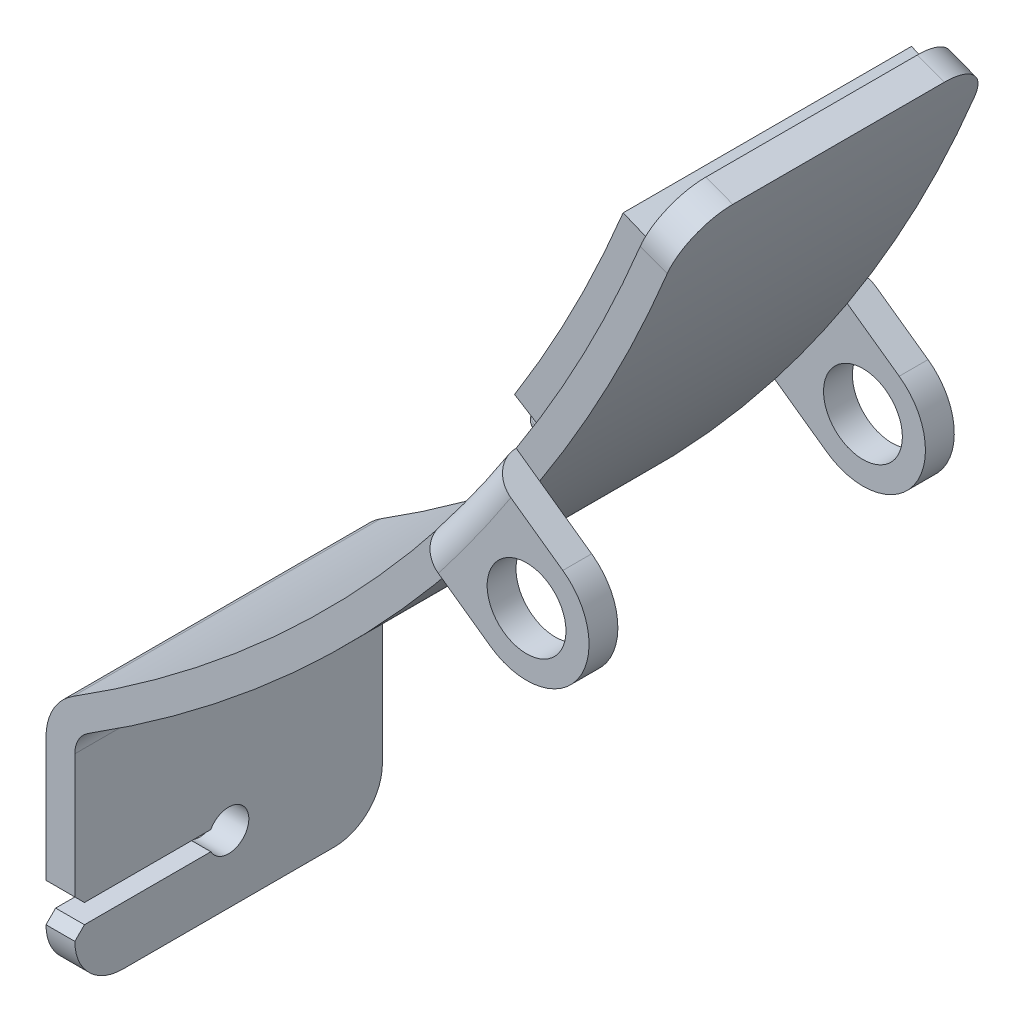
ISO-10303-21;
HEADER;
FILE_DESCRIPTION(('STEP AP214'),'2;1');
FILE_NAME('part.step','',(''),(''),'','','');
FILE_SCHEMA(('AUTOMOTIVE_DESIGN { 1 0 10303 214 1 1 1 1 }'));
ENDSEC;
DATA;
#1=APPLICATION_CONTEXT('core data for automotive mechanical design processes');
#2=APPLICATION_PROTOCOL_DEFINITION('international standard','automotive_design',2000,#1);
#3=PRODUCT_CONTEXT('',#1,'mechanical');
#4=PRODUCT('Part','Part','',(#3));
#5=PRODUCT_RELATED_PRODUCT_CATEGORY('part','',(#4));
#6=PRODUCT_DEFINITION_FORMATION('','',#4);
#7=PRODUCT_DEFINITION_CONTEXT('part definition',#1,'design');
#8=PRODUCT_DEFINITION('design','',#6,#7);
#9=PRODUCT_DEFINITION_SHAPE('','',#8);
#10=(LENGTH_UNIT() NAMED_UNIT(*) SI_UNIT(.MILLI.,.METRE.));
#11=(NAMED_UNIT(*) PLANE_ANGLE_UNIT() SI_UNIT($,.RADIAN.));
#12=(NAMED_UNIT(*) SI_UNIT($,.STERADIAN.) SOLID_ANGLE_UNIT());
#13=UNCERTAINTY_MEASURE_WITH_UNIT(LENGTH_MEASURE(1.E-05),#10,'distance_accuracy_value','');
#14=(GEOMETRIC_REPRESENTATION_CONTEXT(3) GLOBAL_UNCERTAINTY_ASSIGNED_CONTEXT((#13)) GLOBAL_UNIT_ASSIGNED_CONTEXT((#10,
#11,#12)) REPRESENTATION_CONTEXT('',''));
#15=CARTESIAN_POINT('',(0.,0.,0.));
#16=DIRECTION('',(0.,0.,1.));
#17=DIRECTION('',(1.,0.,0.));
#18=AXIS2_PLACEMENT_3D('',#15,#16,#17);
#19=CARTESIAN_POINT('',(55.3898700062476,48.0889478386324,16.));
#20=DIRECTION('',(0.,0.,1.));
#21=DIRECTION('',(1.,0.,0.));
#22=AXIS2_PLACEMENT_3D('',#19,#20,#21);
#23=PLANE('',#22);
#24=DIRECTION('',(-1.,2.25603239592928E-13,0.));
#25=VECTOR('',#24,1.);
#26=CARTESIAN_POINT('',(75.3898700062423,35.1899162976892,15.9999999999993));
#27=LINE('',#26,#25);
#28=CARTESIAN_POINT('',(52.3898700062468,35.1899162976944,15.9999999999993));
#29=VERTEX_POINT('',#28);
#30=CARTESIAN_POINT('',(49.3898700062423,35.189916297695,15.9999999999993));
#31=VERTEX_POINT('',#30);
#32=EDGE_CURVE('E337',#29,#31,#27,.T.);
#33=ORIENTED_EDGE('',*,*,#32,.F.);
#34=DIRECTION('',(-1.06781308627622E-13,1.,0.));
#35=VECTOR('',#34,1.);
#36=CARTESIAN_POINT('',(52.3898700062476,26.1899162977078,16.));
#37=LINE('',#36,#35);
#38=CARTESIAN_POINT('',(52.3898700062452,48.0889478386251,16.));
#39=VERTEX_POINT('',#38);
#40=EDGE_CURVE('E1098',#29,#39,#37,.T.);
#41=ORIENTED_EDGE('',*,*,#40,.T.);
#42=CARTESIAN_POINT('',(55.3898700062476,48.0889478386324,16.));
#43=DIRECTION('',(0.,0.,-1.));
#44=DIRECTION('',(1.,0.,0.));
#45=AXIS2_PLACEMENT_3D('',#42,#43,#44);
#46=CIRCLE('',#45,3.00000000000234);
#47=CARTESIAN_POINT('',(53.7952190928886,50.6300280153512,16.));
#48=VERTEX_POINT('',#47);
#49=EDGE_CURVE('E1082',#39,#48,#46,.T.);
#50=ORIENTED_EDGE('',*,*,#49,.T.);
#51=CARTESIAN_POINT('',(-27.5319775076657,180.225117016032,16.));
#52=DIRECTION('',(0.,0.,1.));
#53=DIRECTION('',(1.,0.,0.));
#54=AXIS2_PLACEMENT_3D('',#51,#52,#53);
#55=CIRCLE('',#54,153.);
#56=CARTESIAN_POINT('',(93.2121884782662,86.2578547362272,16.));
#57=VERTEX_POINT('',#56);
#58=EDGE_CURVE('E1086',#48,#57,#55,.T.);
#59=ORIENTED_EDGE('',*,*,#58,.T.);
#60=DIRECTION('',(-0.814557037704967,0.580083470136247,0.));
#61=VECTOR('',#60,1.);
#62=CARTESIAN_POINT('',(86.1521915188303,91.2856027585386,16.));
#63=LINE('',#62,#61);
#64=CARTESIAN_POINT('',(90.7662649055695,87.9997092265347,16.));
#65=VERTEX_POINT('',#64);
#66=EDGE_CURVE('E1064',#57,#65,#63,.T.);
#67=ORIENTED_EDGE('',*,*,#66,.T.);
#68=CARTESIAN_POINT('',(-27.5319775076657,180.225117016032,16.));
#69=DIRECTION('',(0.,0.,-1.));
#70=DIRECTION('',(1.,0.,0.));
#71=AXIS2_PLACEMENT_3D('',#68,#69,#70);
#72=CIRCLE('',#71,150.);
#73=CARTESIAN_POINT('',(52.2005681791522,53.1711081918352,16.));
#74=VERTEX_POINT('',#73);
#75=EDGE_CURVE('E1089',#65,#74,#72,.T.);
#76=ORIENTED_EDGE('',*,*,#75,.T.);
#77=CARTESIAN_POINT('',(55.3898700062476,48.0889478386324,16.));
#78=DIRECTION('',(0.,0.,1.));
#79=DIRECTION('',(1.,0.,0.));
#80=AXIS2_PLACEMENT_3D('',#77,#78,#79);
#81=CIRCLE('',#80,6.00000000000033);
#82=CARTESIAN_POINT('',(49.3898700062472,48.0889478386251,16.));
#83=VERTEX_POINT('',#82);
#84=EDGE_CURVE('E1093',#74,#83,#81,.T.);
#85=ORIENTED_EDGE('',*,*,#84,.T.);
#86=DIRECTION('',(-2.25603239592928E-13,-1.,0.));
#87=VECTOR('',#86,1.);
#88=CARTESIAN_POINT('',(49.3898700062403,26.1899162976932,16.));
#89=LINE('',#88,#87);
#90=EDGE_CURVE('E1095',#83,#31,#89,.T.);
#91=ORIENTED_EDGE('',*,*,#90,.T.);
#92=EDGE_LOOP('',(#33,#41,#50,#59,#67,#76,#85,#91));
#93=FACE_BOUND('',#92,.T.);
#94=ADVANCED_FACE('F16',(#93),#23,.T.);
#95=CARTESIAN_POINT('',(102.389870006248,87.7018035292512,19.));
#96=DIRECTION('',(0.,0.,-1.));
#97=DIRECTION('',(-1.,0.,0.));
#98=AXIS2_PLACEMENT_3D('',#95,#96,#97);
#99=CYLINDRICAL_SURFACE('',#98,6.5);
#100=CARTESIAN_POINT('',(102.389870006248,87.7018035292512,-16.));
#101=DIRECTION('',(0.,0.,1.));
#102=DIRECTION('',(1.,0.,0.));
#103=AXIS2_PLACEMENT_3D('',#100,#101,#102);
#104=CIRCLE('',#103,6.5);
#105=CARTESIAN_POINT('',(98.6193274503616,82.4071827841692,-16.));
#106=VERTEX_POINT('',#105);
#107=CARTESIAN_POINT('',(106.160412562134,92.9964242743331,-16.));
#108=VERTEX_POINT('',#107);
#109=EDGE_CURVE('E1230',#106,#108,#104,.T.);
#110=ORIENTED_EDGE('',*,*,#109,.F.);
#111=DIRECTION('',(0.,0.,-1.));
#112=VECTOR('',#111,1.);
#113=CARTESIAN_POINT('',(98.6193274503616,82.4071827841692,19.));
#114=LINE('',#113,#112);
#115=CARTESIAN_POINT('',(98.6193274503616,82.4071827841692,-19.));
#116=VERTEX_POINT('',#115);
#117=EDGE_CURVE('E1057',#106,#116,#114,.T.);
#118=ORIENTED_EDGE('',*,*,#117,.T.);
#119=CARTESIAN_POINT('',(102.389870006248,87.7018035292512,-19.));
#120=DIRECTION('',(0.,0.,1.));
#121=DIRECTION('',(1.,0.,0.));
#122=AXIS2_PLACEMENT_3D('',#119,#120,#121);
#123=CIRCLE('',#122,6.5);
#124=CARTESIAN_POINT('',(106.160412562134,92.9964242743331,-19.));
#125=VERTEX_POINT('',#124);
#126=EDGE_CURVE('E1034',#116,#125,#123,.T.);
#127=ORIENTED_EDGE('',*,*,#126,.T.);
#128=DIRECTION('',(0.,0.,-1.));
#129=VECTOR('',#128,1.);
#130=CARTESIAN_POINT('',(106.160412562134,92.9964242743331,19.));
#131=LINE('',#130,#129);
#132=EDGE_CURVE('E1030',#108,#125,#131,.T.);
#133=ORIENTED_EDGE('',*,*,#132,.F.);
#134=EDGE_LOOP('',(#110,#118,#127,#133));
#135=FACE_BOUND('',#134,.T.);
#136=ADVANCED_FACE('F475',(#135),#99,.T.);
#137=CARTESIAN_POINT('',(106.160412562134,92.9964242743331,19.));
#138=DIRECTION('',(-0.580083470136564,-0.814557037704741,0.));
#139=DIRECTION('',(0.814557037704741,-0.580083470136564,0.));
#140=AXIS2_PLACEMENT_3D('',#137,#138,#139);
#141=PLANE('',#140);
#142=DIRECTION('',(-0.814557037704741,0.580083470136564,0.));
#143=VECTOR('',#142,1.);
#144=CARTESIAN_POINT('',(106.160412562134,92.9964242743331,-19.));
#145=LINE('',#144,#143);
#146=CARTESIAN_POINT('',(100.753273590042,96.8470962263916,-19.));
#147=VERTEX_POINT('',#146);
#148=EDGE_CURVE('E1023',#125,#147,#145,.T.);
#149=ORIENTED_EDGE('',*,*,#148,.T.);
#150=CARTESIAN_POINT('',(100.753273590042,96.8470962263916,-19.));
#151=CARTESIAN_POINT('',(100.684432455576,96.8961211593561,-19.0000080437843));
#152=CARTESIAN_POINT('',(100.61559443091,96.9451438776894,-18.9964351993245));
#153=CARTESIAN_POINT('',(100.478410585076,97.0428387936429,-18.9821900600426));
#154=CARTESIAN_POINT('',(100.410064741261,97.0915110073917,-18.9715180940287));
#155=CARTESIAN_POINT('',(100.274394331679,97.1881281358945,-18.9431473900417));
#156=CARTESIAN_POINT('',(100.207069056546,97.2360735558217,-18.925453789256));
#157=CARTESIAN_POINT('',(100.073888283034,97.3309177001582,-18.8831827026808));
#158=CARTESIAN_POINT('',(100.008032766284,97.3778164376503,-18.8586053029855));
#159=CARTESIAN_POINT('',(99.8133053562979,97.5164907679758,-18.7747442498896));
#160=CARTESIAN_POINT('',(99.6872185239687,97.6062829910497,-18.7053203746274));
#161=CARTESIAN_POINT('',(99.4464267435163,97.7777618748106,-18.5415071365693));
#162=CARTESIAN_POINT('',(99.3317197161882,97.8594500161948,-18.4471223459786));
#163=CARTESIAN_POINT('',(99.1168767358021,98.0124495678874,-18.2360690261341));
#164=CARTESIAN_POINT('',(99.0167349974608,98.0837650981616,-18.1194093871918));
#165=CARTESIAN_POINT('',(98.833828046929,98.2140215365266,-17.8670648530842));
#166=CARTESIAN_POINT('',(98.7510662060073,98.272960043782,-17.7313762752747));
#167=CARTESIAN_POINT('',(98.6053519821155,98.3767298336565,-17.4449594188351));
#168=CARTESIAN_POINT('',(98.5423863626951,98.4215705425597,-17.2942412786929));
#169=CARTESIAN_POINT('',(98.4380132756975,98.495899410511,-16.9819894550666));
#170=CARTESIAN_POINT('',(98.3965928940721,98.525396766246,-16.8204623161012));
#171=CARTESIAN_POINT('',(98.3468607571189,98.5608133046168,-16.5482761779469));
#172=CARTESIAN_POINT('',(98.3320531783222,98.5713584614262,-16.4393394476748));
#173=CARTESIAN_POINT('',(98.3122991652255,98.5854262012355,-16.2202838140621));
#174=CARTESIAN_POINT('',(98.3073387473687,98.5889587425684,-16.1101668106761));
#175=CARTESIAN_POINT('',(98.3073500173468,98.5889507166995,-16.));
#176=B_SPLINE_CURVE_WITH_KNOTS('',3,(#150,#151,#152,#153,#154,#155,#156,#157,#158,#159,#160,
#161,#162,#163,#164,#165,#166,#167,#168,#169,#170,#171,#172,#173,#174,#175),.UNSPECIFIED.,.F.,
.F.,(4,2,2,2,2,2,2,2,2,2,2,2,4),(0.,0.25345836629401,0.506904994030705,0.760166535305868,
1.01342490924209,1.51974213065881,2.02596667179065,2.53198958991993,3.03811057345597,
3.54389242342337,4.04937076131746,4.38007598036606,4.71031124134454),.UNSPECIFIED.);
#177=CARTESIAN_POINT('',(98.3073500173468,98.5889507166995,-16.));
#178=VERTEX_POINT('',#177);
#179=EDGE_CURVE('E1026',#147,#178,#176,.T.);
#180=ORIENTED_EDGE('',*,*,#179,.T.);
#181=DIRECTION('',(0.814557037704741,-0.580083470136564,0.));
#182=VECTOR('',#181,1.);
#183=CARTESIAN_POINT('',(93.6932766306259,101.874844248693,-16.));
#184=LINE('',#183,#182);
#185=CARTESIAN_POINT('',(100.753273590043,96.8470962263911,-16.));
#186=VERTEX_POINT('',#185);
#187=EDGE_CURVE('E1124',#178,#186,#184,.T.);
#188=ORIENTED_EDGE('',*,*,#187,.T.);
#189=DIRECTION('',(-0.81455703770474,0.580083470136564,0.));
#190=VECTOR('',#189,1.);
#191=CARTESIAN_POINT('',(106.160412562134,92.9964242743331,-16.));
#192=LINE('',#191,#190);
#193=EDGE_CURVE('E1131',#108,#186,#192,.T.);
#194=ORIENTED_EDGE('',*,*,#193,.F.);
#195=ORIENTED_EDGE('',*,*,#132,.T.);
#196=EDGE_LOOP('',(#149,#180,#188,#194,#195));
#197=FACE_BOUND('',#196,.T.);
#198=ADVANCED_FACE('F480',(#197),#141,.F.);
#199=CARTESIAN_POINT('',(98.6193274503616,82.4071827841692,19.));
#200=DIRECTION('',(0.580083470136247,0.814557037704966,0.));
#201=DIRECTION('',(-0.814557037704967,0.580083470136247,0.));
#202=AXIS2_PLACEMENT_3D('',#199,#200,#201);
#203=PLANE('',#202);
#204=DIRECTION('',(-0.814557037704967,0.580083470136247,0.));
#205=VECTOR('',#204,1.);
#206=CARTESIAN_POINT('',(86.1521915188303,91.2856027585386,-16.));
#207=LINE('',#206,#205);
#208=CARTESIAN_POINT('',(93.2121884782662,86.2578547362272,-16.));
#209=VERTEX_POINT('',#208);
#210=CARTESIAN_POINT('',(90.7662649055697,87.9997092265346,-16.));
#211=VERTEX_POINT('',#210);
#212=EDGE_CURVE('E1121',#209,#211,#207,.T.);
#213=ORIENTED_EDGE('',*,*,#212,.T.);
#214=CARTESIAN_POINT('',(90.7662649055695,87.9997092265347,-16.));
#215=CARTESIAN_POINT('',(90.7662582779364,87.9997139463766,-16.0843225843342));
#216=CARTESIAN_POINT('',(90.7691634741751,87.9976450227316,-16.1686413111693));
#217=CARTESIAN_POINT('',(90.7807462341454,87.9893964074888,-16.3366750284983));
#218=CARTESIAN_POINT('',(90.7894235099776,87.9832169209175,-16.4203900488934));
#219=CARTESIAN_POINT('',(90.8124901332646,87.9667901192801,-16.5865638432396));
#220=CARTESIAN_POINT('',(90.8268750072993,87.9565459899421,-16.669023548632));
#221=CARTESIAN_POINT('',(90.8612395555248,87.9320734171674,-16.8321419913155));
#222=CARTESIAN_POINT('',(90.8812191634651,87.9178450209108,-16.9128007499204));
#223=CARTESIAN_POINT('',(90.9493871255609,87.8692994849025,-17.1512960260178));
#224=CARTESIAN_POINT('',(91.0058142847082,87.8291151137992,-17.3057208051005));
#225=CARTESIAN_POINT('',(91.1389399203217,87.7343102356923,-17.6006424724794));
#226=CARTESIAN_POINT('',(91.2156349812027,87.6796921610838,-17.741141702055));
#227=CARTESIAN_POINT('',(91.3871753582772,87.5575303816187,-18.0044343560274));
#228=CARTESIAN_POINT('',(91.4820281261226,87.4899813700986,-18.1272204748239));
#229=CARTESIAN_POINT('',(91.6871854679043,87.3438794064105,-18.351539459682));
#230=CARTESIAN_POINT('',(91.7974930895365,87.2653242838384,-18.453068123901));
#231=CARTESIAN_POINT('',(92.0305267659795,87.0993703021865,-18.632078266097));
#232=CARTESIAN_POINT('',(92.1532660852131,87.0119619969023,-18.7095336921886));
#233=CARTESIAN_POINT('',(92.4075651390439,86.8308639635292,-18.8380312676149));
#234=CARTESIAN_POINT('',(92.5391197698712,86.7371778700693,-18.8890885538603));
#235=CARTESIAN_POINT('',(92.7615872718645,86.5787485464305,-18.9507512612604));
#236=CARTESIAN_POINT('',(92.8511086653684,86.51499625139,-18.9692083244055));
#237=CARTESIAN_POINT('',(93.0311371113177,86.3867897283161,-18.9938311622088));
#238=CARTESIAN_POINT('',(93.1216425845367,86.3223366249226,-19.0000143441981));
#239=CARTESIAN_POINT('',(93.2121884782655,86.2578547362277,-19.));
#240=B_SPLINE_CURVE_WITH_KNOTS('',3,(#214,#215,#216,#217,#218,#219,#220,#221,#222,#223,#224,
#225,#226,#227,#228,#229,#230,#231,#232,#233,#234,#235,#236,#237,#238,#239),.UNSPECIFIED.,.F.,
.F.,(4,2,2,2,2,2,2,2,2,2,2,2,4),(0.,0.252885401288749,0.505758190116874,0.758433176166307,
1.01110517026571,1.51624100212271,2.02129176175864,2.52655023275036,3.03190848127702,
3.53781173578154,4.04342457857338,4.37710874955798,4.71031933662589),.UNSPECIFIED.);
#241=CARTESIAN_POINT('',(93.2121884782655,86.2578547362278,-19.));
#242=VERTEX_POINT('',#241);
#243=EDGE_CURVE('E534',#211,#242,#240,.T.);
#244=ORIENTED_EDGE('',*,*,#243,.T.);
#245=DIRECTION('',(0.814557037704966,-0.580083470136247,0.));
#246=VECTOR('',#245,1.);
#247=CARTESIAN_POINT('',(98.6193274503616,82.4071827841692,-19.));
#248=LINE('',#247,#246);
#249=EDGE_CURVE('E1033',#242,#116,#248,.T.);
#250=ORIENTED_EDGE('',*,*,#249,.T.);
#251=ORIENTED_EDGE('',*,*,#117,.F.);
#252=DIRECTION('',(0.814557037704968,-0.580083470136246,0.));
#253=VECTOR('',#252,1.);
#254=CARTESIAN_POINT('',(93.2121884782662,86.2578547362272,-16.));
#255=LINE('',#254,#253);
#256=EDGE_CURVE('E1228',#209,#106,#255,.T.);
#257=ORIENTED_EDGE('',*,*,#256,.F.);
#258=EDGE_LOOP('',(#213,#244,#250,#251,#257));
#259=FACE_BOUND('',#258,.T.);
#260=ADVANCED_FACE('F469',(#259),#203,.F.);
#261=CARTESIAN_POINT('',(102.389870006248,87.7018035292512,19.));
#262=DIRECTION('',(0.,0.,-1.));
#263=DIRECTION('',(-1.,0.,0.));
#264=AXIS2_PLACEMENT_3D('',#261,#262,#263);
#265=CYLINDRICAL_SURFACE('',#264,4.1);
#266=CARTESIAN_POINT('',(102.389870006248,87.7018035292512,-19.));
#267=DIRECTION('',(0.,0.,1.));
#268=DIRECTION('',(1.,0.,0.));
#269=AXIS2_PLACEMENT_3D('',#266,#267,#268);
#270=CIRCLE('',#269,4.1);
#271=CARTESIAN_POINT('',(106.489870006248,87.7018035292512,-19.));
#272=VERTEX_POINT('',#271);
#273=EDGE_CURVE('E1134',#272,#272,#270,.T.);
#274=ORIENTED_EDGE('',*,*,#273,.F.);
#275=EDGE_LOOP('',(#274));
#276=FACE_BOUND('',#275,.T.);
#277=CARTESIAN_POINT('',(102.389870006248,87.7018035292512,-16.));
#278=DIRECTION('',(0.,0.,1.));
#279=DIRECTION('',(1.,0.,0.));
#280=AXIS2_PLACEMENT_3D('',#277,#278,#279);
#281=CIRCLE('',#280,4.1);
#282=CARTESIAN_POINT('',(106.489870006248,87.7018035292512,-16.));
#283=VERTEX_POINT('',#282);
#284=EDGE_CURVE('E1130',#283,#283,#281,.T.);
#285=ORIENTED_EDGE('',*,*,#284,.T.);
#286=EDGE_LOOP('',(#285));
#287=FACE_BOUND('',#286,.T.);
#288=ADVANCED_FACE('F458',(#276,#287),#265,.F.);
#289=CARTESIAN_POINT('',(-27.5319775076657,180.225117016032,16.));
#290=DIRECTION('',(0.,0.,-1.));
#291=DIRECTION('',(-1.,0.,0.));
#292=AXIS2_PLACEMENT_3D('',#289,#290,#291);
#293=CYLINDRICAL_SURFACE('',#292,153.);
#294=CARTESIAN_POINT('',(-27.5319775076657,180.225117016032,-16.));
#295=DIRECTION('',(0.,0.,1.));
#296=DIRECTION('',(1.,0.,0.));
#297=AXIS2_PLACEMENT_3D('',#294,#295,#296);
#298=CIRCLE('',#297,153.);
#299=CARTESIAN_POINT('',(114.026590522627,122.171936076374,-16.));
#300=VERTEX_POINT('',#299);
#301=EDGE_CURVE('E1073',#186,#300,#298,.T.);
#302=ORIENTED_EDGE('',*,*,#301,.T.);
#303=CARTESIAN_POINT('',(114.026590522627,122.171936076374,-16.));
#304=CARTESIAN_POINT('',(114.079949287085,122.302042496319,-16.0000151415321));
#305=CARTESIAN_POINT('',(114.133124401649,122.432222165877,-15.9940745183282));
#306=CARTESIAN_POINT('',(114.238740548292,122.691796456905,-15.9703877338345));
#307=CARTESIAN_POINT('',(114.291181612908,122.821191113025,-15.952642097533));
#308=CARTESIAN_POINT('',(114.394928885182,123.078179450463,-15.9054689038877));
#309=CARTESIAN_POINT('',(114.446235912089,123.205774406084,-15.8760500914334));
#310=CARTESIAN_POINT('',(114.547409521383,123.458346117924,-15.8057419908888));
#311=CARTESIAN_POINT('',(114.597276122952,123.583322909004,-15.7648528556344));
#312=CARTESIAN_POINT('',(114.695255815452,123.829800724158,-15.6718761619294));
#313=CARTESIAN_POINT('',(114.743368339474,123.951300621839,-15.619785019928));
#314=CARTESIAN_POINT('',(114.837529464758,124.189949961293,-15.5047598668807));
#315=CARTESIAN_POINT('',(114.883577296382,124.307097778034,-15.4418218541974));
#316=CARTESIAN_POINT('',(114.973273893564,124.536083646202,-15.3056005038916));
#317=CARTESIAN_POINT('',(115.016923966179,124.647924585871,-15.2323228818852));
#318=CARTESIAN_POINT('',(115.101598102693,124.865594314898,-15.07588754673));
#319=CARTESIAN_POINT('',(115.142621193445,124.971420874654,-14.9927262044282));
#320=CARTESIAN_POINT('',(115.221749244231,125.176179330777,-14.8171943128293));
#321=CARTESIAN_POINT('',(115.259856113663,125.275115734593,-14.7248298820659));
#322=CARTESIAN_POINT('',(115.332969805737,125.465485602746,-14.5314659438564));
#323=CARTESIAN_POINT('',(115.367975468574,125.556916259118,-14.4304632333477));
#324=CARTESIAN_POINT('',(115.434662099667,125.731551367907,-14.2205878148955));
#325=CARTESIAN_POINT('',(115.466343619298,125.814757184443,-14.1117164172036));
#326=CARTESIAN_POINT('',(115.526219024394,125.97237959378,-13.8868225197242));
#327=CARTESIAN_POINT('',(115.554411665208,126.046793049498,-13.770797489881));
#328=CARTESIAN_POINT('',(115.607142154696,126.186260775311,-13.5324394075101));
#329=CARTESIAN_POINT('',(115.631679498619,126.251313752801,-13.4101054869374));
#330=CARTESIAN_POINT('',(115.67695975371,126.371571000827,-13.1600156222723));
#331=CARTESIAN_POINT('',(115.697702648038,126.426775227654,-13.0322596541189));
#332=CARTESIAN_POINT('',(115.735272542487,126.526905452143,-12.7722903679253));
#333=CARTESIAN_POINT('',(115.752101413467,126.571836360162,-12.6400792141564));
#334=CARTESIAN_POINT('',(115.781761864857,126.651113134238,-12.3721350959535));
#335=CARTESIAN_POINT('',(115.794594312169,126.68546129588,-12.2364029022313));
#336=CARTESIAN_POINT('',(115.819611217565,126.752472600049,-11.9190034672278));
#337=CARTESIAN_POINT('',(115.830313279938,126.781183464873,-11.7363573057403));
#338=CARTESIAN_POINT('',(115.841011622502,126.809893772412,-11.4609162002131));
#339=CARTESIAN_POINT('',(115.843685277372,126.81707120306,-11.3689036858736));
#340=CARTESIAN_POINT('',(115.847250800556,126.826644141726,-11.1846016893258));
#341=CARTESIAN_POINT('',(115.848142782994,126.829039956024,-11.0923122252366));
#342=CARTESIAN_POINT('',(115.848143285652,126.829040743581,-11.));
#343=B_SPLINE_CURVE_WITH_KNOTS('',3,(#303,#304,#305,#306,#307,#308,#309,#310,#311,#312,#313,
#314,#315,#316,#317,#318,#319,#320,#321,#322,#323,#324,#325,#326,#327,#328,#329,#330,#331,#332,
#333,#334,#335,#336,#337,#338,#339,#340,#341,#342),.UNSPECIFIED.,.F.,.F.,(4,2,2,2,2,2,2,2,2,2,2,
2,2,2,2,2,2,2,2,4),(0.,0.421740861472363,0.843462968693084,1.2648697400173,1.6862708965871,
2.10780706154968,2.52949907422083,2.95095888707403,3.37257393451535,3.79391052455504,
4.21540402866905,4.63682750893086,5.05840090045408,5.48003245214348,5.90166587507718,
6.32309734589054,6.74443733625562,7.29873948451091,7.57561308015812,7.85246894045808),.UNSPECIFIED.);
#344=CARTESIAN_POINT('',(115.848143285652,126.829040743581,-11.));
#345=VERTEX_POINT('',#344);
#346=EDGE_CURVE('E448',#300,#345,#343,.T.);
#347=ORIENTED_EDGE('',*,*,#346,.T.);
#348=DIRECTION('',(0.,0.,-1.));
#349=VECTOR('',#348,1.);
#350=CARTESIAN_POINT('',(115.848143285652,126.829040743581,16.));
#351=LINE('',#350,#349);
#352=CARTESIAN_POINT('',(115.848143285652,126.829040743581,11.));
#353=VERTEX_POINT('',#352);
#354=EDGE_CURVE('E1115',#353,#345,#351,.T.);
#355=ORIENTED_EDGE('',*,*,#354,.F.);
#356=CARTESIAN_POINT('',(115.848143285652,126.829040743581,11.));
#357=CARTESIAN_POINT('',(115.848147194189,126.829055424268,11.1406287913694));
#358=CARTESIAN_POINT('',(115.846072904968,126.823481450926,11.2812554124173));
#359=CARTESIAN_POINT('',(115.837796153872,126.801262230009,11.5615025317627));
#360=CARTESIAN_POINT('',(115.831593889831,126.784617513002,11.7011230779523));
#361=CARTESIAN_POINT('',(115.815095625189,126.740379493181,11.9782654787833));
#362=CARTESIAN_POINT('',(115.804802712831,126.712794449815,12.1157888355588));
#363=CARTESIAN_POINT('',(115.780178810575,126.64688359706,12.3878662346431));
#364=CARTESIAN_POINT('',(115.765847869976,126.608557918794,12.5224203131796));
#365=CARTESIAN_POINT('',(115.733218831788,126.521432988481,12.7876451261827));
#366=CARTESIAN_POINT('',(115.714919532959,126.472630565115,12.9183146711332));
#367=CARTESIAN_POINT('',(115.674447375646,126.364898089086,13.1748464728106));
#368=CARTESIAN_POINT('',(115.652273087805,126.305964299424,13.3007069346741));
#369=CARTESIAN_POINT('',(115.604189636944,126.17844928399,13.5466070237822));
#370=CARTESIAN_POINT('',(115.578282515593,126.109873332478,13.6666497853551));
#371=CARTESIAN_POINT('',(115.522857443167,125.963525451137,13.9001777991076));
#372=CARTESIAN_POINT('',(115.493338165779,125.885750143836,14.0136606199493));
#373=CARTESIAN_POINT('',(115.430875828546,125.721628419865,14.2331669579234));
#374=CARTESIAN_POINT('',(115.397934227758,125.635285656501,14.3391936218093));
#375=CARTESIAN_POINT('',(115.328792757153,125.454598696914,14.5431251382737));
#376=CARTESIAN_POINT('',(115.292591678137,125.36025153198,14.6410269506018));
#377=CARTESIAN_POINT('',(115.217160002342,125.164289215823,14.8279522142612));
#378=CARTESIAN_POINT('',(115.177929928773,125.062675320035,14.9169771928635));
#379=CARTESIAN_POINT('',(115.096654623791,124.85286806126,15.0855651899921));
#380=CARTESIAN_POINT('',(115.054608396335,124.744672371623,15.165124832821));
#381=CARTESIAN_POINT('',(114.967977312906,124.522540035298,15.31416683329));
#382=CARTESIAN_POINT('',(114.923392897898,124.40860438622,15.3836509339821));
#383=CARTESIAN_POINT('',(114.831957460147,124.175802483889,15.5120649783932));
#384=CARTESIAN_POINT('',(114.785106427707,124.056936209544,15.5709948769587));
#385=CARTESIAN_POINT('',(114.689456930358,123.815184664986,15.6778574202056));
#386=CARTESIAN_POINT('',(114.640659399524,123.692301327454,15.725795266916));
#387=CARTESIAN_POINT('',(114.541434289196,123.443397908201,15.810359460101));
#388=CARTESIAN_POINT('',(114.491007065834,123.317378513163,15.8469882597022));
#389=CARTESIAN_POINT('',(114.372708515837,123.022909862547,15.9184223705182));
#390=CARTESIAN_POINT('',(114.304348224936,122.853605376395,15.9490148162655));
#391=CARTESIAN_POINT('',(114.200795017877,122.598476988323,15.9796034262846));
#392=CARTESIAN_POINT('',(114.166126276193,122.513282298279,15.9872496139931));
#393=CARTESIAN_POINT('',(114.096530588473,122.342700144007,15.9974472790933));
#394=CARTESIAN_POINT('',(114.0616036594,122.257312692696,15.9999990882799));
#395=CARTESIAN_POINT('',(114.026590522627,122.171936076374,16.));
#396=B_SPLINE_CURVE_WITH_KNOTS('',3,(#356,#357,#358,#359,#360,#361,#362,#363,#364,#365,#366,
#367,#368,#369,#370,#371,#372,#373,#374,#375,#376,#377,#378,#379,#380,#381,#382,#383,#384,#385,
#386,#387,#388,#389,#390,#391,#392,#393,#394,#395),.UNSPECIFIED.,.F.,.F.,(4,2,2,2,2,2,2,2,2,2,2,
2,2,2,2,2,2,2,2,4),(0.,0.421757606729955,0.843495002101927,1.26491460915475,1.6863290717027,
2.10787127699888,2.52956930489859,2.95103755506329,3.37266102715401,3.79410547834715,
4.2157069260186,4.63723571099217,5.0589143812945,5.48052001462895,5.90212745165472,
6.32353494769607,6.74485096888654,7.29894876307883,7.57571785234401,7.85246891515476),.UNSPECIFIED.);
#397=CARTESIAN_POINT('',(114.026590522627,122.171936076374,16.));
#398=VERTEX_POINT('',#397);
#399=EDGE_CURVE('E443',#353,#398,#396,.T.);
#400=ORIENTED_EDGE('',*,*,#399,.T.);
#401=CARTESIAN_POINT('',(100.753273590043,96.8470962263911,16.));
#402=VERTEX_POINT('',#401);
#403=EDGE_CURVE('E1085',#402,#398,#55,.T.);
#404=ORIENTED_EDGE('',*,*,#403,.F.);
#405=CARTESIAN_POINT('',(-27.5319775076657,180.225117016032,16.));
#406=DIRECTION('',(0.,0.,-1.));
#407=DIRECTION('',(1.,0.,0.));
#408=AXIS2_PLACEMENT_3D('',#405,#406,#407);
#409=CIRCLE('',#408,153.);
#410=EDGE_CURVE('E1214',#402,#57,#409,.T.);
#411=ORIENTED_EDGE('',*,*,#410,.T.);
#412=ORIENTED_EDGE('',*,*,#58,.F.);
#413=DIRECTION('',(0.,0.,-1.));
#414=VECTOR('',#413,1.);
#415=CARTESIAN_POINT('',(53.7952190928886,50.6300280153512,16.));
#416=LINE('',#415,#414);
#417=CARTESIAN_POINT('',(53.7952190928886,50.6300280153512,-16.));
#418=VERTEX_POINT('',#417);
#419=EDGE_CURVE('E1118',#48,#418,#416,.T.);
#420=ORIENTED_EDGE('',*,*,#419,.T.);
#421=EDGE_CURVE('E1074',#418,#209,#298,.T.);
#422=ORIENTED_EDGE('',*,*,#421,.T.);
#423=CARTESIAN_POINT('',(-27.5319775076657,180.225117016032,-16.));
#424=DIRECTION('',(0.,0.,-1.));
#425=DIRECTION('',(1.,0.,0.));
#426=AXIS2_PLACEMENT_3D('',#423,#424,#425);
#427=CIRCLE('',#426,153.);
#428=EDGE_CURVE('E1226',#186,#209,#427,.T.);
#429=ORIENTED_EDGE('',*,*,#428,.F.);
#430=EDGE_LOOP('',(#302,#347,#355,#400,#404,#411,#412,#420,#422,#429));
#431=FACE_BOUND('',#430,.T.);
#432=ADVANCED_FACE('F454',(#431),#293,.T.);
#433=ORIENTED_EDGE('',*,*,#403,.T.);
#434=DIRECTION('',(-0.937124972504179,0.348993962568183,0.));
#435=VECTOR('',#434,1.);
#436=CARTESIAN_POINT('',(111.291798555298,123.190397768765,16.));
#437=LINE('',#436,#435);
#438=CARTESIAN_POINT('',(111.213683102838,123.219488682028,16.));
#439=VERTEX_POINT('',#438);
#440=EDGE_CURVE('E1257',#398,#439,#437,.T.);
#441=ORIENTED_EDGE('',*,*,#440,.T.);
#442=CARTESIAN_POINT('',(98.3073500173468,98.5889507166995,16.));
#443=VERTEX_POINT('',#442);
#444=EDGE_CURVE('E1090',#439,#443,#72,.T.);
#445=ORIENTED_EDGE('',*,*,#444,.T.);
#446=DIRECTION('',(0.814557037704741,-0.580083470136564,0.));
#447=VECTOR('',#446,1.);
#448=CARTESIAN_POINT('',(93.6932766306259,101.874844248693,16.));
#449=LINE('',#448,#447);
#450=EDGE_CURVE('E1067',#443,#402,#449,.T.);
#451=ORIENTED_EDGE('',*,*,#450,.T.);
#452=EDGE_LOOP('',(#433,#441,#445,#451));
#453=FACE_BOUND('',#452,.T.);
#454=ADVANCED_FACE('F457',(#453),#23,.T.);
#455=CARTESIAN_POINT('',(55.3898700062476,48.0889478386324,-16.));
#456=DIRECTION('',(0.,0.,1.));
#457=DIRECTION('',(1.,0.,0.));
#458=AXIS2_PLACEMENT_3D('',#455,#456,#457);
#459=PLANE('',#458);
#460=CARTESIAN_POINT('',(-27.5319775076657,180.225117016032,-16.));
#461=DIRECTION('',(0.,0.,-1.));
#462=DIRECTION('',(1.,0.,0.));
#463=AXIS2_PLACEMENT_3D('',#460,#461,#462);
#464=CIRCLE('',#463,150.);
#465=CARTESIAN_POINT('',(111.213683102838,123.219488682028,-16.));
#466=VERTEX_POINT('',#465);
#467=EDGE_CURVE('E1078',#466,#178,#464,.T.);
#468=ORIENTED_EDGE('',*,*,#467,.F.);
#469=DIRECTION('',(-0.937124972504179,0.348993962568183,0.));
#470=VECTOR('',#469,1.);
#471=CARTESIAN_POINT('',(86.7605463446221,132.326061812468,-16.));
#472=LINE('',#471,#470);
#473=EDGE_CURVE('E449',#466,#300,#472,.F.);
#474=ORIENTED_EDGE('',*,*,#473,.T.);
#475=ORIENTED_EDGE('',*,*,#301,.F.);
#476=ORIENTED_EDGE('',*,*,#187,.F.);
#477=EDGE_LOOP('',(#468,#474,#475,#476));
#478=FACE_BOUND('',#477,.T.);
#479=ADVANCED_FACE('F466',(#478),#459,.F.);
#480=DIRECTION('',(-1.06781308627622E-13,1.,0.));
#481=VECTOR('',#480,1.);
#482=CARTESIAN_POINT('',(52.3898700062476,26.1899162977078,-16.));
#483=LINE('',#482,#481);
#484=CARTESIAN_POINT('',(52.389870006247,31.1899162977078,-16.));
#485=VERTEX_POINT('',#484);
#486=CARTESIAN_POINT('',(52.3898700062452,48.0889478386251,-16.));
#487=VERTEX_POINT('',#486);
#488=EDGE_CURVE('E515',#485,#487,#483,.T.);
#489=ORIENTED_EDGE('',*,*,#488,.F.);
#490=DIRECTION('',(1.,4.85028683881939E-12,0.));
#491=VECTOR('',#490,1.);
#492=CARTESIAN_POINT('',(55.3898700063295,31.1899162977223,-16.));
#493=LINE('',#492,#491);
#494=CARTESIAN_POINT('',(49.3898700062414,31.1899162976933,-16.));
#495=VERTEX_POINT('',#494);
#496=EDGE_CURVE('E521',#485,#495,#493,.F.);
#497=ORIENTED_EDGE('',*,*,#496,.T.);
#498=DIRECTION('',(-2.25603239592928E-13,-1.,0.));
#499=VECTOR('',#498,1.);
#500=CARTESIAN_POINT('',(49.3898700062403,26.1899162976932,-16.));
#501=LINE('',#500,#499);
#502=CARTESIAN_POINT('',(49.3898700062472,48.0889478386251,-16.));
#503=VERTEX_POINT('',#502);
#504=EDGE_CURVE('E505',#503,#495,#501,.T.);
#505=ORIENTED_EDGE('',*,*,#504,.F.);
#506=CARTESIAN_POINT('',(55.3898700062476,48.0889478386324,-16.));
#507=DIRECTION('',(0.,0.,1.));
#508=DIRECTION('',(1.,0.,0.));
#509=AXIS2_PLACEMENT_3D('',#506,#507,#508);
#510=CIRCLE('',#509,6.00000000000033);
#511=CARTESIAN_POINT('',(52.2005681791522,53.1711081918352,-16.));
#512=VERTEX_POINT('',#511);
#513=EDGE_CURVE('E516',#512,#503,#510,.T.);
#514=ORIENTED_EDGE('',*,*,#513,.F.);
#515=EDGE_CURVE('E1077',#211,#512,#464,.T.);
#516=ORIENTED_EDGE('',*,*,#515,.F.);
#517=ORIENTED_EDGE('',*,*,#212,.F.);
#518=ORIENTED_EDGE('',*,*,#421,.F.);
#519=CARTESIAN_POINT('',(55.3898700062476,48.0889478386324,-16.));
#520=DIRECTION('',(0.,0.,-1.));
#521=DIRECTION('',(1.,0.,0.));
#522=AXIS2_PLACEMENT_3D('',#519,#520,#521);
#523=CIRCLE('',#522,3.00000000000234);
#524=EDGE_CURVE('E1070',#487,#418,#523,.T.);
#525=ORIENTED_EDGE('',*,*,#524,.F.);
#526=EDGE_LOOP('',(#489,#497,#505,#514,#516,#517,#518,#525));
#527=FACE_BOUND('',#526,.T.);
#528=ADVANCED_FACE('F931',(#527),#459,.F.);
#529=CARTESIAN_POINT('',(55.3898700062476,48.0889478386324,16.));
#530=DIRECTION('',(0.,0.,-1.));
#531=DIRECTION('',(-1.,0.,0.));
#532=AXIS2_PLACEMENT_3D('',#529,#530,#531);
#533=CYLINDRICAL_SURFACE('',#532,3.00000000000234);
#534=ORIENTED_EDGE('',*,*,#524,.T.);
#535=ORIENTED_EDGE('',*,*,#419,.F.);
#536=ORIENTED_EDGE('',*,*,#49,.F.);
#537=DIRECTION('',(0.,0.,-1.));
#538=VECTOR('',#537,1.);
#539=CARTESIAN_POINT('',(52.3898700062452,48.0889478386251,16.));
#540=LINE('',#539,#538);
#541=EDGE_CURVE('E1100',#39,#487,#540,.T.);
#542=ORIENTED_EDGE('',*,*,#541,.T.);
#543=EDGE_LOOP('',(#534,#535,#536,#542));
#544=FACE_BOUND('',#543,.T.);
#545=ADVANCED_FACE('F18',(#544),#533,.F.);
#546=CARTESIAN_POINT('',(113.036768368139,127.876022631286,16.));
#547=DIRECTION('',(-0.348993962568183,-0.937124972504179,0.));
#548=DIRECTION('',(0.937124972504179,-0.348993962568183,0.));
#549=AXIS2_PLACEMENT_3D('',#546,#547,#548);
#550=PLANE('',#549);
#551=ORIENTED_EDGE('',*,*,#354,.T.);
#552=DIRECTION('',(-0.937124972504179,0.348993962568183,0.));
#553=VECTOR('',#552,1.);
#554=CARTESIAN_POINT('',(113.036768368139,127.876022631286,-11.));
#555=LINE('',#554,#553);
#556=CARTESIAN_POINT('',(113.036768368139,127.876022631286,-11.));
#557=VERTEX_POINT('',#556);
#558=EDGE_CURVE('E424',#345,#557,#555,.T.);
#559=ORIENTED_EDGE('',*,*,#558,.T.);
#560=DIRECTION('',(0.,0.,-1.));
#561=VECTOR('',#560,1.);
#562=CARTESIAN_POINT('',(113.036768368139,127.876022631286,16.));
#563=LINE('',#562,#561);
#564=CARTESIAN_POINT('',(113.036768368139,127.876022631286,11.));
#565=VERTEX_POINT('',#564);
#566=EDGE_CURVE('E1112',#565,#557,#563,.T.);
#567=ORIENTED_EDGE('',*,*,#566,.F.);
#568=DIRECTION('',(-0.937124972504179,0.348993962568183,0.));
#569=VECTOR('',#568,1.);
#570=CARTESIAN_POINT('',(115.848143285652,126.829040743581,11.));
#571=LINE('',#570,#569);
#572=EDGE_CURVE('E1271',#565,#353,#571,.F.);
#573=ORIENTED_EDGE('',*,*,#572,.T.);
#574=EDGE_LOOP('',(#551,#559,#567,#573));
#575=FACE_BOUND('',#574,.T.);
#576=ADVANCED_FACE('F402',(#575),#550,.F.);
#577=CARTESIAN_POINT('',(-27.5319775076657,180.225117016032,16.));
#578=DIRECTION('',(0.,0.,-1.));
#579=DIRECTION('',(-1.,0.,0.));
#580=AXIS2_PLACEMENT_3D('',#577,#578,#579);
#581=CYLINDRICAL_SURFACE('',#580,150.);
#582=DIRECTION('',(0.,0.,-1.));
#583=VECTOR('',#582,1.);
#584=CARTESIAN_POINT('',(111.213683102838,123.219488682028,15.));
#585=LINE('',#584,#583);
#586=CARTESIAN_POINT('',(111.213683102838,123.219488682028,15.));
#587=VERTEX_POINT('',#586);
#588=CARTESIAN_POINT('',(111.213683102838,123.219488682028,-15.));
#589=VERTEX_POINT('',#588);
#590=EDGE_CURVE('E36',#587,#589,#585,.T.);
#591=ORIENTED_EDGE('',*,*,#590,.F.);
#592=CARTESIAN_POINT('',(-27.5319775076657,180.225117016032,15.));
#593=DIRECTION('',(0.,0.,1.));
#594=DIRECTION('',(1.,0.,0.));
#595=AXIS2_PLACEMENT_3D('',#592,#593,#594);
#596=CIRCLE('',#595,150.);
#597=CARTESIAN_POINT('',(99.6880723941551,100.757772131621,15.));
#598=VERTEX_POINT('',#597);
#599=EDGE_CURVE('E41',#598,#587,#596,.T.);
#600=ORIENTED_EDGE('',*,*,#599,.F.);
#601=DIRECTION('',(0.,0.,-1.));
#602=VECTOR('',#601,1.);
#603=CARTESIAN_POINT('',(99.6880723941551,100.757772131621,15.));
#604=LINE('',#603,#602);
#605=CARTESIAN_POINT('',(99.6880723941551,100.757772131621,-15.));
#606=VERTEX_POINT('',#605);
#607=EDGE_CURVE('E314',#598,#606,#604,.T.);
#608=ORIENTED_EDGE('',*,*,#607,.T.);
#609=CARTESIAN_POINT('',(-27.5319775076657,180.225117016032,-15.));
#610=DIRECTION('',(0.,0.,1.));
#611=DIRECTION('',(1.,0.,0.));
#612=AXIS2_PLACEMENT_3D('',#609,#610,#611);
#613=CIRCLE('',#612,150.);
#614=EDGE_CURVE('E291',#606,#589,#613,.T.);
#615=ORIENTED_EDGE('',*,*,#614,.T.);
#616=EDGE_LOOP('',(#591,#600,#608,#615));
#617=FACE_BOUND('',#616,.T.);
#618=DIRECTION('',(0.,0.,-1.));
#619=VECTOR('',#618,1.);
#620=CARTESIAN_POINT('',(98.952045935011,99.5914279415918,13.));
#621=LINE('',#620,#619);
#622=CARTESIAN_POINT('',(98.952045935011,99.5914279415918,11.75));
#623=VERTEX_POINT('',#622);
#624=CARTESIAN_POINT('',(98.952045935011,99.5914279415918,-11.75));
#625=VERTEX_POINT('',#624);
#626=EDGE_CURVE('E1177',#623,#625,#621,.T.);
#627=ORIENTED_EDGE('',*,*,#626,.F.);
#628=CARTESIAN_POINT('',(98.952045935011,99.5914279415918,11.75));
#629=CARTESIAN_POINT('',(98.9520457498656,99.5914277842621,11.7851674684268));
#630=CARTESIAN_POINT('',(98.9512476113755,99.5901756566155,11.8203180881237));
#631=CARTESIAN_POINT('',(98.9480631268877,99.58518066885,11.8903677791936));
#632=CARTESIAN_POINT('',(98.9456768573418,99.5814379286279,11.9252668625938));
#633=CARTESIAN_POINT('',(98.9361577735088,99.5665098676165,12.0291506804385));
#634=CARTESIAN_POINT('',(98.9266646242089,99.5516246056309,12.0974395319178));
#635=CARTESIAN_POINT('',(98.9016373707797,99.5124069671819,12.2300820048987));
#636=CARTESIAN_POINT('',(98.8861003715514,99.4880700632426,12.2944337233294));
#637=CARTESIAN_POINT('',(98.8494123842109,99.4306528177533,12.4173747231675));
#638=CARTESIAN_POINT('',(98.8282623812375,99.3975740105,12.4759650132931));
#639=CARTESIAN_POINT('',(98.7809283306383,99.3236229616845,12.5857220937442));
#640=CARTESIAN_POINT('',(98.7547441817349,99.28275056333,12.6368887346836));
#641=CARTESIAN_POINT('',(98.6980573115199,99.1943755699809,12.7303578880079));
#642=CARTESIAN_POINT('',(98.6675537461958,99.1468716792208,12.77265866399));
#643=CARTESIAN_POINT('',(98.6030750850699,99.0465973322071,12.84718886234));
#644=CARTESIAN_POINT('',(98.5690992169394,98.9938257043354,12.8794160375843));
#645=CARTESIAN_POINT('',(98.4986332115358,98.8845405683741,12.9328593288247));
#646=CARTESIAN_POINT('',(98.462144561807,98.8280292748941,12.9540818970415));
#647=CARTESIAN_POINT('',(98.400479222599,98.7326733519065,12.9796398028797));
#648=CARTESIAN_POINT('',(98.3757130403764,98.6944139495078,12.9872702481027));
#649=CARTESIAN_POINT('',(98.3258745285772,98.6174997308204,12.9974496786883));
#650=CARTESIAN_POINT('',(98.3008026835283,98.5788455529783,13.000005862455));
#651=CARTESIAN_POINT('',(98.2757012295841,98.540185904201,13.));
#652=B_SPLINE_CURVE_WITH_KNOTS('',3,(#628,#629,#630,#631,#632,#633,#634,#635,#636,#637,#638,
#639,#640,#641,#642,#643,#644,#645,#646,#647,#648,#649,#650,#651),.UNSPECIFIED.,.F.,.F.,(4,2,2,
2,2,2,2,2,2,2,2,4),(0.,0.1054376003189,0.21087012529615,0.421387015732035,0.632004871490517,
0.84258578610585,1.0531709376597,1.26379729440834,1.47447060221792,1.68502024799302,
1.82338734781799,1.96155801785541),.UNSPECIFIED.);
#653=CARTESIAN_POINT('',(98.2757012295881,98.5401859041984,13.));
#654=VERTEX_POINT('',#653);
#655=EDGE_CURVE('E384',#623,#654,#652,.T.);
#656=ORIENTED_EDGE('',*,*,#655,.T.);
#657=CARTESIAN_POINT('',(-27.5319775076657,180.225117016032,13.));
#658=DIRECTION('',(0.,0.,1.));
#659=DIRECTION('',(1.,0.,0.));
#660=AXIS2_PLACEMENT_3D('',#657,#658,#659);
#661=CIRCLE('',#660,150.000000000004);
#662=CARTESIAN_POINT('',(98.0026314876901,98.1211466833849,13.));
#663=VERTEX_POINT('',#662);
#664=EDGE_CURVE('E1201',#663,#654,#661,.T.);
#665=ORIENTED_EDGE('',*,*,#664,.F.);
#666=CARTESIAN_POINT('',(98.0026314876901,98.1211466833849,13.));
#667=CARTESIAN_POINT('',(97.9833818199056,98.0917143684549,12.9999997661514));
#668=CARTESIAN_POINT('',(97.9641308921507,98.0623030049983,12.9985149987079));
#669=CARTESIAN_POINT('',(97.9257463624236,98.0037040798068,12.9925916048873));
#670=CARTESIAN_POINT('',(97.9066127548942,97.9745165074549,12.9881531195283));
#671=CARTESIAN_POINT('',(97.8496276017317,97.8876536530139,12.9704491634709));
#672=CARTESIAN_POINT('',(97.8121274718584,97.8305800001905,12.9527950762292));
#673=CARTESIAN_POINT('',(97.7392159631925,97.7197686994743,12.9062731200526));
#674=CARTESIAN_POINT('',(97.703805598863,97.6660326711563,12.8773998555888));
#675=CARTESIAN_POINT('',(97.6360950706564,97.5634125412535,12.8092620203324));
#676=CARTESIAN_POINT('',(97.6037943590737,97.5145275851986,12.7699992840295));
#677=CARTESIAN_POINT('',(97.5432398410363,97.4229852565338,12.6821972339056));
#678=CARTESIAN_POINT('',(97.5149859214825,97.3803277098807,12.6336581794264));
#679=CARTESIAN_POINT('',(97.4633396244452,97.3024247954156,12.5286675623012));
#680=CARTESIAN_POINT('',(97.4399481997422,97.2671808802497,12.4722144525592));
#681=CARTESIAN_POINT('',(97.3987149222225,97.205098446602,12.3530019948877));
#682=CARTESIAN_POINT('',(97.3808742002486,97.1782616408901,12.2902413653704));
#683=CARTESIAN_POINT('',(97.3512788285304,97.1337636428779,12.1602129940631));
#684=CARTESIAN_POINT('',(97.3395206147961,97.1160970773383,12.0929479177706));
#685=CARTESIAN_POINT('',(97.3253579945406,97.0948224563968,11.9793928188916));
#686=CARTESIAN_POINT('',(97.3211288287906,97.0884711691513,11.9338170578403));
#687=CARTESIAN_POINT('',(97.3154865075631,97.0799984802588,11.8421672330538));
#688=CARTESIAN_POINT('',(97.31406936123,97.0778710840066,11.7960939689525));
#689=CARTESIAN_POINT('',(97.314072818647,97.0778758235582,11.75));
#690=B_SPLINE_CURVE_WITH_KNOTS('',3,(#666,#667,#668,#669,#670,#671,#672,#673,#674,#675,#676,
#677,#678,#679,#680,#681,#682,#683,#684,#685,#686,#687,#688,#689),.UNSPECIFIED.,.F.,.F.,(4,2,2,
2,2,2,2,2,2,2,2,4),(0.,0.105440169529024,0.210875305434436,0.421397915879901,0.632021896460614,
0.842608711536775,1.05318964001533,1.26381179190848,1.47447682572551,1.68501828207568,
1.82338556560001,1.96155633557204),.UNSPECIFIED.);
#691=CARTESIAN_POINT('',(97.3140728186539,97.0778758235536,11.75));
#692=VERTEX_POINT('',#691);
#693=EDGE_CURVE('E377',#663,#692,#690,.T.);
#694=ORIENTED_EDGE('',*,*,#693,.T.);
#695=DIRECTION('',(0.,0.,-1.));
#696=VECTOR('',#695,1.);
#697=CARTESIAN_POINT('',(97.3140728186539,97.0778758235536,13.));
#698=LINE('',#697,#696);
#699=CARTESIAN_POINT('',(97.3140728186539,97.0778758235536,-11.75));
#700=VERTEX_POINT('',#699);
#701=EDGE_CURVE('E1182',#692,#700,#698,.T.);
#702=ORIENTED_EDGE('',*,*,#701,.T.);
#703=CARTESIAN_POINT('',(97.3140728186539,97.0778758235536,-11.75));
#704=CARTESIAN_POINT('',(97.3140728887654,97.0778760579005,-11.7851684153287));
#705=CARTESIAN_POINT('',(97.3148960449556,97.079111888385,-11.8203199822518));
#706=CARTESIAN_POINT('',(97.3181795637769,97.0840423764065,-11.8903715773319));
#707=CARTESIAN_POINT('',(97.3206398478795,97.0877369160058,-11.9252716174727));
#708=CARTESIAN_POINT('',(97.3304522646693,97.1024740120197,-12.0291584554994));
#709=CARTESIAN_POINT('',(97.3402360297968,97.1171701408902,-12.0974493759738));
#710=CARTESIAN_POINT('',(97.3660066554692,97.1559043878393,-12.2300959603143));
#711=CARTESIAN_POINT('',(97.3819964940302,97.1799469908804,-12.2944497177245));
#712=CARTESIAN_POINT('',(97.4197080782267,97.2366995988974,-12.4173943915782));
#713=CARTESIAN_POINT('',(97.4414288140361,97.269408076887,-12.4759863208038));
#714=CARTESIAN_POINT('',(97.489966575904,97.3425771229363,-12.5857441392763));
#715=CARTESIAN_POINT('',(97.5167835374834,97.3830375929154,-12.6369101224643));
#716=CARTESIAN_POINT('',(97.5747389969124,97.4705870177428,-12.7303774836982));
#717=CARTESIAN_POINT('',(97.6058783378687,97.5176772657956,-12.7726771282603));
#718=CARTESIAN_POINT('',(97.671571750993,97.6171585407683,-12.8472030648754));
#719=CARTESIAN_POINT('',(97.7061264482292,97.6695505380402,-12.8794275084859));
#720=CARTESIAN_POINT('',(97.7776433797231,97.7781454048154,-12.9328659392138));
#721=CARTESIAN_POINT('',(97.8146041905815,97.8343460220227,-12.9540863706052));
#722=CARTESIAN_POINT('',(97.876932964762,97.9292653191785,-12.9796418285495));
#723=CARTESIAN_POINT('',(97.9019314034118,97.967372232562,-12.987271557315));
#724=CARTESIAN_POINT('',(97.9521663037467,98.0440256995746,-12.9974499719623));
#725=CARTESIAN_POINT('',(97.9774023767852,98.0825715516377,-13.0000058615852));
#726=CARTESIAN_POINT('',(98.0026314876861,98.1211466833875,-13.));
#727=B_SPLINE_CURVE_WITH_KNOTS('',3,(#703,#704,#705,#706,#707,#708,#709,#710,#711,#712,#713,
#714,#715,#716,#717,#718,#719,#720,#721,#722,#723,#724,#725,#726),.UNSPECIFIED.,.F.,.F.,(4,2,2,
2,2,2,2,2,2,2,2,4),(0.,0.105440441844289,0.210875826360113,0.421398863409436,0.63202304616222,
0.842610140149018,1.05319456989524,1.26382013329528,1.4744843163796,1.6850249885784,
1.82338895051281,1.96155632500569),.UNSPECIFIED.);
#728=CARTESIAN_POINT('',(98.0026314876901,98.1211466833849,-13.));
#729=VERTEX_POINT('',#728);
#730=EDGE_CURVE('E406',#700,#729,#727,.T.);
#731=ORIENTED_EDGE('',*,*,#730,.T.);
#732=CARTESIAN_POINT('',(-27.5319775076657,180.225117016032,-13.));
#733=DIRECTION('',(0.,0.,1.));
#734=DIRECTION('',(1.,0.,0.));
#735=AXIS2_PLACEMENT_3D('',#732,#733,#734);
#736=CIRCLE('',#735,150.000000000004);
#737=CARTESIAN_POINT('',(98.2757012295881,98.5401859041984,-13.));
#738=VERTEX_POINT('',#737);
#739=EDGE_CURVE('E1179',#729,#738,#736,.T.);
#740=ORIENTED_EDGE('',*,*,#739,.T.);
#741=CARTESIAN_POINT('',(98.2757012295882,98.5401859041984,-13.));
#742=CARTESIAN_POINT('',(98.2948526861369,98.5696820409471,-12.9999997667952));
#743=CARTESIAN_POINT('',(98.3139844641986,98.5991708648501,-12.9985149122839));
#744=CARTESIAN_POINT('',(98.3520906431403,98.6579507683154,-12.9925912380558));
#745=CARTESIAN_POINT('',(98.3710650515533,98.6872418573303,-12.9881525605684));
#746=CARTESIAN_POINT('',(98.4275157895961,98.7744520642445,-12.970447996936));
#747=CARTESIAN_POINT('',(98.4645836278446,98.8318066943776,-12.9527934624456));
#748=CARTESIAN_POINT('',(98.5365109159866,98.9432577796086,-12.9062710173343));
#749=CARTESIAN_POINT('',(98.5713692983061,98.9973526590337,-12.8773977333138));
#750=CARTESIAN_POINT('',(98.6379036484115,99.100738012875,-12.8092604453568));
#751=CARTESIAN_POINT('',(98.6695801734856,99.1500293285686,-12.7699982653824));
#752=CARTESIAN_POINT('',(98.7288720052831,99.2423972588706,-12.6821959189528));
#753=CARTESIAN_POINT('',(98.7564872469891,99.2854737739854,-12.6336556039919));
#754=CARTESIAN_POINT('',(98.8069000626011,99.3641857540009,-12.5286621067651));
#755=CARTESIAN_POINT('',(98.8296966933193,99.3998197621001,-12.472207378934));
#756=CARTESIAN_POINT('',(98.8698413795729,99.4626159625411,-12.3529911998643));
#757=CARTESIAN_POINT('',(98.8871883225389,99.4897764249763,-12.2902284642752));
#758=CARTESIAN_POINT('',(98.9159454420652,99.5348232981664,-12.1601954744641));
#759=CARTESIAN_POINT('',(98.9273590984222,99.5527151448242,-12.0929278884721));
#760=CARTESIAN_POINT('',(98.941101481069,99.5742621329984,-11.9793738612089));
#761=CARTESIAN_POINT('',(98.94520338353,99.5806952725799,-11.9338018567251));
#762=CARTESIAN_POINT('',(98.9506751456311,99.5892776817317,-11.842159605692));
#763=CARTESIAN_POINT('',(98.9520488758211,99.5914330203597,-11.796090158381));
#764=CARTESIAN_POINT('',(98.9520459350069,99.5914279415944,-11.75));
#765=B_SPLINE_CURVE_WITH_KNOTS('',3,(#741,#742,#743,#744,#745,#746,#747,#748,#749,#750,#751,
#752,#753,#754,#755,#756,#757,#758,#759,#760,#761,#762,#763,#764),.UNSPECIFIED.,.F.,.F.,(4,2,2,
2,2,2,2,2,2,2,2,4),(0.,0.105439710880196,0.210874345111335,0.421395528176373,0.632017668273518,
0.842602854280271,1.05319141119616,1.26382115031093,1.47449386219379,1.6850428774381,
1.82339864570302,1.96155798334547),.UNSPECIFIED.);
#766=EDGE_CURVE('E385',#738,#625,#765,.T.);
#767=ORIENTED_EDGE('',*,*,#766,.T.);
#768=EDGE_LOOP('',(#627,#656,#665,#694,#702,#731,#740,#767));
#769=FACE_BOUND('',#768,.T.);
#770=ORIENTED_EDGE('',*,*,#467,.T.);
#771=CARTESIAN_POINT('',(-27.5319775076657,180.225117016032,-16.));
#772=DIRECTION('',(0.,0.,1.));
#773=DIRECTION('',(1.,0.,0.));
#774=AXIS2_PLACEMENT_3D('',#771,#772,#773);
#775=CIRCLE('',#774,150.);
#776=EDGE_CURVE('E527',#178,#211,#775,.F.);
#777=ORIENTED_EDGE('',*,*,#776,.T.);
#778=ORIENTED_EDGE('',*,*,#515,.T.);
#779=DIRECTION('',(0.,0.,-1.));
#780=VECTOR('',#779,1.);
#781=CARTESIAN_POINT('',(52.2005681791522,53.1711081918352,16.));
#782=LINE('',#781,#780);
#783=EDGE_CURVE('E1109',#74,#512,#782,.T.);
#784=ORIENTED_EDGE('',*,*,#783,.F.);
#785=ORIENTED_EDGE('',*,*,#75,.F.);
#786=CARTESIAN_POINT('',(-27.5319775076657,180.225117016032,16.));
#787=DIRECTION('',(0.,0.,1.));
#788=DIRECTION('',(1.,0.,0.));
#789=AXIS2_PLACEMENT_3D('',#786,#787,#788);
#790=CIRCLE('',#789,150.);
#791=EDGE_CURVE('E524',#65,#443,#790,.T.);
#792=ORIENTED_EDGE('',*,*,#791,.T.);
#793=ORIENTED_EDGE('',*,*,#444,.F.);
#794=CARTESIAN_POINT('',(111.213683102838,123.219488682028,16.));
#795=CARTESIAN_POINT('',(111.267126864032,123.349559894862,16.0000151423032));
#796=CARTESIAN_POINT('',(111.320383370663,123.479705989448,15.9940747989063));
#797=CARTESIAN_POINT('',(111.42615475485,123.739216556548,15.9703890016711));
#798=CARTESIAN_POINT('',(111.478669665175,123.868581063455,15.952644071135));
#799=CARTESIAN_POINT('',(111.582556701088,124.125512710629,15.9054725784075));
#800=CARTESIAN_POINT('',(111.633929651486,124.253081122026,15.8760547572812));
#801=CARTESIAN_POINT('',(111.735227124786,124.505603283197,15.8057488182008));
#802=CARTESIAN_POINT('',(111.785151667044,124.630557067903,15.7648608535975));
#803=CARTESIAN_POINT('',(111.883239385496,124.876992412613,15.6718865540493));
#804=CARTESIAN_POINT('',(111.931401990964,124.998472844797,15.6197966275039));
#805=CARTESIAN_POINT('',(112.025655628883,125.237086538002,15.5047739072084));
#806=CARTESIAN_POINT('',(112.071745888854,125.354218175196,15.4418371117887));
#807=CARTESIAN_POINT('',(112.161520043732,125.583174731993,15.305618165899));
#808=CARTESIAN_POINT('',(112.205205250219,125.695002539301,15.2323417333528));
#809=CARTESIAN_POINT('',(112.28994294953,125.912648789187,15.0759087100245));
#810=CARTESIAN_POINT('',(112.330994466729,126.018465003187,14.9927484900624));
#811=CARTESIAN_POINT('',(112.41017283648,126.223204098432,14.8172197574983));
#812=CARTESIAN_POINT('',(112.448301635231,126.322131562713,14.7248574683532));
#813=CARTESIAN_POINT('',(112.521453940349,126.512485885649,14.5314979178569));
#814=CARTESIAN_POINT('',(112.556476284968,126.603909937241,14.4304974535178));
#815=CARTESIAN_POINT('',(112.623191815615,126.778533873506,14.2206265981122));
#816=CARTESIAN_POINT('',(112.654885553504,126.86173512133,14.111757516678));
#817=CARTESIAN_POINT('',(112.714781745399,127.019350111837,13.8868683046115));
#818=CARTESIAN_POINT('',(112.74298295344,127.09376071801,13.7708456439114));
#819=CARTESIAN_POINT('',(112.795727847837,127.23322451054,13.5324917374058));
#820=CARTESIAN_POINT('',(112.820271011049,127.29827635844,13.4101595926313));
#821=CARTESIAN_POINT('',(112.865560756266,127.418532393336,13.1600732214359));
#822=CARTESIAN_POINT('',(112.886307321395,127.47373653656,13.0323189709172));
#823=CARTESIAN_POINT('',(112.923883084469,127.573867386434,12.7723530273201));
#824=CARTESIAN_POINT('',(112.940714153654,127.618799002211,12.6401434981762));
#825=CARTESIAN_POINT('',(112.970378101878,127.698077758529,12.3722025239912));
#826=CARTESIAN_POINT('',(112.983211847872,127.732427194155,12.2364718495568));
#827=CARTESIAN_POINT('',(113.008232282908,127.799444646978,11.9190627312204));
#828=CARTESIAN_POINT('',(113.018935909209,127.828159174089,11.7364049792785));
#829=CARTESIAN_POINT('',(113.029635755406,127.856873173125,11.4609461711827));
#830=CARTESIAN_POINT('',(113.03230977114,127.864051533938,11.3689276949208));
#831=CARTESIAN_POINT('',(113.035875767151,127.87362571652,11.1846137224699));
#832=CARTESIAN_POINT('',(113.036767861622,127.876021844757,11.0923182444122));
#833=CARTESIAN_POINT('',(113.036768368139,127.876022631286,11.));
#834=B_SPLINE_CURVE_WITH_KNOTS('',3,(#794,#795,#796,#797,#798,#799,#800,#801,#802,#803,#804,
#805,#806,#807,#808,#809,#810,#811,#812,#813,#814,#815,#816,#817,#818,#819,#820,#821,#822,#823,
#824,#825,#826,#827,#828,#829,#830,#831,#832,#833),.UNSPECIFIED.,.F.,.F.,(4,2,2,2,2,2,2,2,2,2,2,
2,2,2,2,2,2,2,2,4),(0.,0.421740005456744,0.843461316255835,1.26486742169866,1.68626789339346,
2.10780367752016,2.52949531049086,2.95095465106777,3.37256922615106,3.79390056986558,
4.2153888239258,4.6368070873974,5.0583752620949,5.48000366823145,5.90163394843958,
6.32306231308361,6.74439921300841,7.29873736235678,7.57562900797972,7.85250290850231),.UNSPECIFIED.);
#835=EDGE_CURVE('E417',#439,#565,#834,.T.);
#836=ORIENTED_EDGE('',*,*,#835,.T.);
#837=ORIENTED_EDGE('',*,*,#566,.T.);
#838=CARTESIAN_POINT('',(113.036768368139,127.876022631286,-11.));
#839=CARTESIAN_POINT('',(113.036772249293,127.876037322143,-11.1406287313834));
#840=CARTESIAN_POINT('',(113.034697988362,127.870463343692,-11.2812552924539));
#841=CARTESIAN_POINT('',(113.026421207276,127.848244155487,-11.5615022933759));
#842=CARTESIAN_POINT('',(113.020218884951,127.831599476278,-11.7011227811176));
#843=CARTESIAN_POINT('',(113.003720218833,127.787361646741,-11.9782650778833));
#844=CARTESIAN_POINT('',(112.993426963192,127.759776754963,-12.1157883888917));
#845=CARTESIAN_POINT('',(112.968801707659,127.693866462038,-12.3878656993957));
#846=CARTESIAN_POINT('',(112.954469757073,127.655541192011,-12.522419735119));
#847=CARTESIAN_POINT('',(112.921837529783,127.568417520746,-12.787644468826));
#848=CARTESIAN_POINT('',(112.903536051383,127.51961594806,-12.9183139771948));
#849=CARTESIAN_POINT('',(112.863057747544,127.411885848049,-13.1748457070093));
#850=CARTESIAN_POINT('',(112.840879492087,127.352953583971,-13.3007061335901));
#851=CARTESIAN_POINT('',(112.792785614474,127.225442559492,-13.5466061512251));
#852=CARTESIAN_POINT('',(112.766872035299,127.156869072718,-13.666648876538));
#853=CARTESIAN_POINT('',(112.711430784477,127.010527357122,-13.9001768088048));
#854=CARTESIAN_POINT('',(112.68190178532,126.932755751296,-14.0136595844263));
#855=CARTESIAN_POINT('',(112.619416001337,126.768643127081,-14.2331656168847));
#856=CARTESIAN_POINT('',(112.586460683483,126.68230577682,-14.3391920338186));
#857=CARTESIAN_POINT('',(112.517286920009,126.501631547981,-14.543123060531));
#858=CARTESIAN_POINT('',(112.481067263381,126.407291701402,-14.6410246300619));
#859=CARTESIAN_POINT('',(112.405592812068,126.211346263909,-14.8279493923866));
#860=CARTESIAN_POINT('',(112.366338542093,126.109741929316,-14.9169741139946));
#861=CARTESIAN_POINT('',(112.285008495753,125.899956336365,-15.0855616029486));
#862=CARTESIAN_POINT('',(112.242931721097,125.791772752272,-15.1651209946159));
#863=CARTESIAN_POINT('',(112.156232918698,125.56966830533,-15.3141619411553));
#864=CARTESIAN_POINT('',(112.111611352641,125.455748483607,-15.3836453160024));
#865=CARTESIAN_POINT('',(112.020094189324,125.222981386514,-15.5120581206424));
#866=CARTESIAN_POINT('',(111.973198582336,125.104134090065,-15.5709875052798));
#867=CARTESIAN_POINT('',(111.877452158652,124.862423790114,-15.6778493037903));
#868=CARTESIAN_POINT('',(111.828602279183,124.739562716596,-15.7257869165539));
#869=CARTESIAN_POINT('',(111.729264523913,124.490707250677,-15.8103509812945));
#870=CARTESIAN_POINT('',(111.678777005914,124.3647135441,-15.8469798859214));
#871=CARTESIAN_POINT('',(111.560325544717,124.070298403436,-15.9184171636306));
#872=CARTESIAN_POINT('',(111.491869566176,123.901022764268,-15.9490116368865));
#873=CARTESIAN_POINT('',(111.388162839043,123.645941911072,-15.9796021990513));
#874=CARTESIAN_POINT('',(111.35344129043,123.560763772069,-15.9872488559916));
#875=CARTESIAN_POINT('',(111.283736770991,123.390216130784,-15.9974471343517));
#876=CARTESIAN_POINT('',(111.248753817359,123.304846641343,-15.9999990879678));
#877=CARTESIAN_POINT('',(111.213683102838,123.219488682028,-16.));
#878=B_SPLINE_CURVE_WITH_KNOTS('',3,(#838,#839,#840,#841,#842,#843,#844,#845,#846,#847,#848,
#849,#850,#851,#852,#853,#854,#855,#856,#857,#858,#859,#860,#861,#862,#863,#864,#865,#866,#867,
#868,#869,#870,#871,#872,#873,#874,#875,#876,#877),.UNSPECIFIED.,.F.,.F.,(4,2,2,2,2,2,2,2,2,2,2,
2,2,2,2,2,2,2,2,4),(0.,0.421757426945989,0.843494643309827,1.26491410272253,1.68632841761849,
2.1078704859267,2.52956837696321,2.95103649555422,3.37265983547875,3.79410339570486,
4.21570395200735,4.63723177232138,5.05890947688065,5.48051092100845,5.9021141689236,
6.32351759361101,6.74482955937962,7.2989550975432,7.57573801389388,7.85250288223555),.UNSPECIFIED.);
#879=EDGE_CURVE('E423',#557,#466,#878,.T.);
#880=ORIENTED_EDGE('',*,*,#879,.T.);
#881=EDGE_LOOP('',(#770,#777,#778,#784,#785,#792,#793,#836,#837,#880));
#882=FACE_BOUND('',#881,.T.);
#883=ADVANCED_FACE('F396',(#617,#769,#882),#581,.F.);
#884=CARTESIAN_POINT('',(55.3898700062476,48.0889478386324,16.));
#885=DIRECTION('',(0.,0.,-1.));
#886=DIRECTION('',(-1.,0.,0.));
#887=AXIS2_PLACEMENT_3D('',#884,#885,#886);
#888=CYLINDRICAL_SURFACE('',#887,6.00000000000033);
#889=ORIENTED_EDGE('',*,*,#513,.T.);
#890=DIRECTION('',(0.,0.,-1.));
#891=VECTOR('',#890,1.);
#892=CARTESIAN_POINT('',(49.3898700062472,48.0889478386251,16.));
#893=LINE('',#892,#891);
#894=EDGE_CURVE('E512',#83,#503,#893,.T.);
#895=ORIENTED_EDGE('',*,*,#894,.F.);
#896=ORIENTED_EDGE('',*,*,#84,.F.);
#897=ORIENTED_EDGE('',*,*,#783,.T.);
#898=EDGE_LOOP('',(#889,#895,#896,#897));
#899=FACE_BOUND('',#898,.T.);
#900=ADVANCED_FACE('F401',(#899),#888,.T.);
#901=CARTESIAN_POINT('',(49.3898700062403,26.1899162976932,16.));
#902=DIRECTION('',(1.,-2.25603239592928E-13,0.));
#903=DIRECTION('',(2.25603239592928E-13,1.,0.));
#904=AXIS2_PLACEMENT_3D('',#901,#902,#903);
#905=PLANE('',#904);
#906=ORIENTED_EDGE('',*,*,#504,.T.);
#907=CARTESIAN_POINT('',(49.3898700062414,31.1899162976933,-11.));
#908=DIRECTION('',(1.,-2.25603239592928E-13,0.));
#909=DIRECTION('',(2.25603239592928E-13,1.,0.));
#910=AXIS2_PLACEMENT_3D('',#907,#908,#909);
#911=CIRCLE('',#910,5.);
#912=CARTESIAN_POINT('',(49.3898700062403,26.1899162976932,-11.));
#913=VERTEX_POINT('',#912);
#914=EDGE_CURVE('E508',#495,#913,#911,.F.);
#915=ORIENTED_EDGE('',*,*,#914,.T.);
#916=DIRECTION('',(0.,0.,-1.));
#917=VECTOR('',#916,1.);
#918=CARTESIAN_POINT('',(49.3898700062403,26.1899162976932,16.));
#919=LINE('',#918,#917);
#920=CARTESIAN_POINT('',(49.3898700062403,26.1899162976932,11.));
#921=VERTEX_POINT('',#920);
#922=EDGE_CURVE('E1106',#921,#913,#919,.T.);
#923=ORIENTED_EDGE('',*,*,#922,.F.);
#924=CARTESIAN_POINT('',(49.3898700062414,31.1899162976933,11.));
#925=DIRECTION('',(1.,-2.25603239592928E-13,0.));
#926=DIRECTION('',(2.25603239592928E-13,1.,0.));
#927=AXIS2_PLACEMENT_3D('',#924,#925,#926);
#928=CIRCLE('',#927,5.);
#929=CARTESIAN_POINT('',(49.3898700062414,31.189916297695,16.0000000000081));
#930=VERTEX_POINT('',#929);
#931=EDGE_CURVE('E525',#921,#930,#928,.F.);
#932=ORIENTED_EDGE('',*,*,#931,.T.);
#933=DIRECTION('',(-1.61915784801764E-13,-0.707106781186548,0.707106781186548));
#934=VECTOR('',#933,1.);
#935=CARTESIAN_POINT('',(49.3898700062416,32.189916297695,15.0000000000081));
#936=LINE('',#935,#934);
#937=CARTESIAN_POINT('',(49.3898700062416,32.189916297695,15.0000000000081));
#938=VERTEX_POINT('',#937);
#939=EDGE_CURVE('E327',#938,#930,#936,.T.);
#940=ORIENTED_EDGE('',*,*,#939,.F.);
#941=DIRECTION('',(0.,0.,1.));
#942=VECTOR('',#941,1.);
#943=CARTESIAN_POINT('',(49.3898700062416,32.189916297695,1.84661853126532));
#944=LINE('',#943,#942);
#945=CARTESIAN_POINT('',(49.3898700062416,32.189916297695,1.84661853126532));
#946=VERTEX_POINT('',#945);
#947=EDGE_CURVE('E324',#946,#938,#944,.T.);
#948=ORIENTED_EDGE('',*,*,#947,.F.);
#949=CARTESIAN_POINT('',(49.3898700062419,33.1899162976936,0.));
#950=DIRECTION('',(-1.,2.25603239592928E-13,0.));
#951=DIRECTION('',(-2.25603239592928E-13,-1.,0.));
#952=AXIS2_PLACEMENT_3D('',#949,#950,#951);
#953=CIRCLE('',#952,2.1000000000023);
#954=CARTESIAN_POINT('',(49.3898700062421,34.189916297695,1.8466185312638));
#955=VERTEX_POINT('',#954);
#956=EDGE_CURVE('E321',#955,#946,#953,.T.);
#957=ORIENTED_EDGE('',*,*,#956,.F.);
#958=DIRECTION('',(0.,0.,-1.));
#959=VECTOR('',#958,1.);
#960=CARTESIAN_POINT('',(49.3898700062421,34.189916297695,14.9999999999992));
#961=LINE('',#960,#959);
#962=CARTESIAN_POINT('',(49.3898700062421,34.189916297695,14.9999999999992));
#963=VERTEX_POINT('',#962);
#964=EDGE_CURVE('E318',#963,#955,#961,.T.);
#965=ORIENTED_EDGE('',*,*,#964,.F.);
#966=DIRECTION('',(-1.57009245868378E-13,-0.707106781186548,-0.707106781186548));
#967=VECTOR('',#966,1.);
#968=CARTESIAN_POINT('',(49.3898700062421,34.189916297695,14.9999999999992));
#969=LINE('',#968,#967);
#970=EDGE_CURVE('E330',#31,#963,#969,.T.);
#971=ORIENTED_EDGE('',*,*,#970,.F.);
#972=ORIENTED_EDGE('',*,*,#90,.F.);
#973=ORIENTED_EDGE('',*,*,#894,.T.);
#974=EDGE_LOOP('',(#906,#915,#923,#932,#940,#948,#957,#965,#971,#972,#973));
#975=FACE_BOUND('',#974,.T.);
#976=ADVANCED_FACE('F494',(#975),#905,.F.);
#977=CARTESIAN_POINT('',(52.3898700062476,26.1899162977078,16.));
#978=DIRECTION('',(-4.85028683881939E-12,1.,0.));
#979=DIRECTION('',(-1.,-4.85028683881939E-12,0.));
#980=AXIS2_PLACEMENT_3D('',#977,#978,#979);
#981=PLANE('',#980);
#982=ORIENTED_EDGE('',*,*,#922,.T.);
#983=DIRECTION('',(1.,4.85028683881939E-12,0.));
#984=VECTOR('',#983,1.);
#985=CARTESIAN_POINT('',(52.3898700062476,26.1899162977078,-11.));
#986=LINE('',#985,#984);
#987=CARTESIAN_POINT('',(52.3898700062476,26.1899162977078,-11.));
#988=VERTEX_POINT('',#987);
#989=EDGE_CURVE('E523',#913,#988,#986,.T.);
#990=ORIENTED_EDGE('',*,*,#989,.T.);
#991=DIRECTION('',(0.,0.,-1.));
#992=VECTOR('',#991,1.);
#993=CARTESIAN_POINT('',(52.3898700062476,26.1899162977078,16.));
#994=LINE('',#993,#992);
#995=CARTESIAN_POINT('',(52.3898700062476,26.1899162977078,11.));
#996=VERTEX_POINT('',#995);
#997=EDGE_CURVE('E1103',#996,#988,#994,.T.);
#998=ORIENTED_EDGE('',*,*,#997,.F.);
#999=DIRECTION('',(1.,4.85028683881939E-12,0.));
#1000=VECTOR('',#999,1.);
#1001=CARTESIAN_POINT('',(49.3898700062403,26.1899162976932,11.));
#1002=LINE('',#1001,#1000);
#1003=EDGE_CURVE('E1256',#996,#921,#1002,.F.);
#1004=ORIENTED_EDGE('',*,*,#1003,.T.);
#1005=EDGE_LOOP('',(#982,#990,#998,#1004));
#1006=FACE_BOUND('',#1005,.T.);
#1007=ADVANCED_FACE('F491',(#1006),#981,.F.);
#1008=CARTESIAN_POINT('',(52.3898700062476,26.1899162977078,16.));
#1009=DIRECTION('',(-1.,-1.06781308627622E-13,0.));
#1010=DIRECTION('',(1.06781308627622E-13,-1.,0.));
#1011=AXIS2_PLACEMENT_3D('',#1008,#1009,#1010);
#1012=PLANE('',#1011);
#1013=ORIENTED_EDGE('',*,*,#997,.T.);
#1014=CARTESIAN_POINT('',(52.389870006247,31.1899162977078,-11.));
#1015=DIRECTION('',(-1.,-1.06781308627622E-13,0.));
#1016=DIRECTION('',(1.06781308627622E-13,-1.,0.));
#1017=AXIS2_PLACEMENT_3D('',#1014,#1015,#1016);
#1018=CIRCLE('',#1017,5.);
#1019=EDGE_CURVE('E1249',#988,#485,#1018,.F.);
#1020=ORIENTED_EDGE('',*,*,#1019,.T.);
#1021=ORIENTED_EDGE('',*,*,#488,.T.);
#1022=ORIENTED_EDGE('',*,*,#541,.F.);
#1023=ORIENTED_EDGE('',*,*,#40,.F.);
#1024=DIRECTION('',(0.,-0.707106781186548,-0.707106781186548));
#1025=VECTOR('',#1024,1.);
#1026=CARTESIAN_POINT('',(52.3898700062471,30.6899162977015,11.5000000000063));
#1027=LINE('',#1026,#1025);
#1028=CARTESIAN_POINT('',(52.3898700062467,34.1899162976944,14.9999999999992));
#1029=VERTEX_POINT('',#1028);
#1030=EDGE_CURVE('E1272',#29,#1029,#1027,.T.);
#1031=ORIENTED_EDGE('',*,*,#1030,.T.);
#1032=DIRECTION('',(0.,0.,-1.));
#1033=VECTOR('',#1032,1.);
#1034=CARTESIAN_POINT('',(52.3898700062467,34.1899162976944,16.));
#1035=LINE('',#1034,#1033);
#1036=CARTESIAN_POINT('',(52.389870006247,34.1899162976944,1.8466185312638));
#1037=VERTEX_POINT('',#1036);
#1038=EDGE_CURVE('E1274',#1029,#1037,#1035,.T.);
#1039=ORIENTED_EDGE('',*,*,#1038,.T.);
#1040=CARTESIAN_POINT('',(52.3898700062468,33.1899162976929,0.));
#1041=DIRECTION('',(-1.,-1.06781308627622E-13,0.));
#1042=DIRECTION('',(1.06781308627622E-13,-1.,0.));
#1043=AXIS2_PLACEMENT_3D('',#1040,#1041,#1042);
#1044=CIRCLE('',#1043,2.1000000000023);
#1045=CARTESIAN_POINT('',(52.3898700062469,32.1899162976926,1.84661853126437));
#1046=VERTEX_POINT('',#1045);
#1047=EDGE_CURVE('E1284',#1037,#1046,#1044,.T.);
#1048=ORIENTED_EDGE('',*,*,#1047,.T.);
#1049=DIRECTION('',(0.,0.,1.));
#1050=VECTOR('',#1049,1.);
#1051=CARTESIAN_POINT('',(52.3898700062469,32.1899162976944,16.));
#1052=LINE('',#1051,#1050);
#1053=CARTESIAN_POINT('',(52.3898700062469,32.1899162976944,15.0000000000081));
#1054=VERTEX_POINT('',#1053);
#1055=EDGE_CURVE('E1282',#1046,#1054,#1052,.T.);
#1056=ORIENTED_EDGE('',*,*,#1055,.T.);
#1057=DIRECTION('',(0.,-0.707106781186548,0.707106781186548));
#1058=VECTOR('',#1057,1.);
#1059=CARTESIAN_POINT('',(52.3898700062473,28.6899162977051,18.4999999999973));
#1060=LINE('',#1059,#1058);
#1061=CARTESIAN_POINT('',(52.389870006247,31.1899162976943,16.0000000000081));
#1062=VERTEX_POINT('',#1061);
#1063=EDGE_CURVE('E1279',#1054,#1062,#1060,.T.);
#1064=ORIENTED_EDGE('',*,*,#1063,.T.);
#1065=CARTESIAN_POINT('',(52.389870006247,31.1899162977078,11.));
#1066=DIRECTION('',(-1.,-1.06781308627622E-13,0.));
#1067=DIRECTION('',(1.06781308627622E-13,-1.,0.));
#1068=AXIS2_PLACEMENT_3D('',#1065,#1066,#1067);
#1069=CIRCLE('',#1068,5.);
#1070=EDGE_CURVE('E1251',#1062,#996,#1069,.F.);
#1071=ORIENTED_EDGE('',*,*,#1070,.T.);
#1072=EDGE_LOOP('',(#1013,#1020,#1021,#1022,#1023,#1031,#1039,#1048,#1056,#1064,#1071));
#1073=FACE_BOUND('',#1072,.T.);
#1074=ADVANCED_FACE('F487',(#1073),#1012,.F.);
#1075=CARTESIAN_POINT('',(102.389870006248,87.7018035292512,19.));
#1076=DIRECTION('',(0.,0.,1.));
#1077=DIRECTION('',(1.,0.,0.));
#1078=AXIS2_PLACEMENT_3D('',#1075,#1076,#1077);
#1079=PLANE('',#1078);
#1080=DIRECTION('',(-0.814557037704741,0.580083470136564,0.));
#1081=VECTOR('',#1080,1.);
#1082=CARTESIAN_POINT('',(106.160412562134,92.9964242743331,19.));
#1083=LINE('',#1082,#1081);
#1084=CARTESIAN_POINT('',(106.160412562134,92.9964242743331,19.));
#1085=VERTEX_POINT('',#1084);
#1086=CARTESIAN_POINT('',(100.753273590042,96.8470962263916,19.));
#1087=VERTEX_POINT('',#1086);
#1088=EDGE_CURVE('E1049',#1085,#1087,#1083,.T.);
#1089=ORIENTED_EDGE('',*,*,#1088,.T.);
#1090=CARTESIAN_POINT('',(-27.5319775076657,180.225117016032,19.));
#1091=DIRECTION('',(0.,0.,1.));
#1092=DIRECTION('',(1.,0.,0.));
#1093=AXIS2_PLACEMENT_3D('',#1090,#1091,#1092);
#1094=CIRCLE('',#1093,153.);
#1095=CARTESIAN_POINT('',(93.2121884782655,86.2578547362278,19.));
#1096=VERTEX_POINT('',#1095);
#1097=EDGE_CURVE('E558',#1087,#1096,#1094,.F.);
#1098=ORIENTED_EDGE('',*,*,#1097,.T.);
#1099=DIRECTION('',(0.814557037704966,-0.580083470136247,0.));
#1100=VECTOR('',#1099,1.);
#1101=CARTESIAN_POINT('',(98.6193274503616,82.4071827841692,19.));
#1102=LINE('',#1101,#1100);
#1103=CARTESIAN_POINT('',(98.6193274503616,82.4071827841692,19.));
#1104=VERTEX_POINT('',#1103);
#1105=EDGE_CURVE('E1055',#1096,#1104,#1102,.T.);
#1106=ORIENTED_EDGE('',*,*,#1105,.T.);
#1107=CARTESIAN_POINT('',(102.389870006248,87.7018035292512,19.));
#1108=DIRECTION('',(0.,0.,1.));
#1109=DIRECTION('',(1.,0.,0.));
#1110=AXIS2_PLACEMENT_3D('',#1107,#1108,#1109);
#1111=CIRCLE('',#1110,6.5);
#1112=EDGE_CURVE('E1046',#1104,#1085,#1111,.T.);
#1113=ORIENTED_EDGE('',*,*,#1112,.T.);
#1114=EDGE_LOOP('',(#1089,#1098,#1106,#1113));
#1115=FACE_BOUND('',#1114,.T.);
#1116=CARTESIAN_POINT('',(102.389870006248,87.7018035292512,19.));
#1117=DIRECTION('',(0.,0.,1.));
#1118=DIRECTION('',(1.,0.,0.));
#1119=AXIS2_PLACEMENT_3D('',#1116,#1117,#1118);
#1120=CIRCLE('',#1119,4.1);
#1121=CARTESIAN_POINT('',(106.489870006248,87.7018035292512,19.));
#1122=VERTEX_POINT('',#1121);
#1123=EDGE_CURVE('E1236',#1122,#1122,#1120,.T.);
#1124=ORIENTED_EDGE('',*,*,#1123,.F.);
#1125=EDGE_LOOP('',(#1124));
#1126=FACE_BOUND('',#1125,.T.);
#1127=ADVANCED_FACE('F490',(#1115,#1126),#1079,.T.);
#1128=CARTESIAN_POINT('',(102.389870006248,87.7018035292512,-19.));
#1129=DIRECTION('',(0.,0.,1.));
#1130=DIRECTION('',(1.,0.,0.));
#1131=AXIS2_PLACEMENT_3D('',#1128,#1129,#1130);
#1132=PLANE('',#1131);
#1133=ORIENTED_EDGE('',*,*,#249,.F.);
#1134=CARTESIAN_POINT('',(-27.5319775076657,180.225117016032,-19.));
#1135=DIRECTION('',(0.,0.,1.));
#1136=DIRECTION('',(1.,0.,0.));
#1137=AXIS2_PLACEMENT_3D('',#1134,#1135,#1136);
#1138=CIRCLE('',#1137,153.);
#1139=EDGE_CURVE('E541',#242,#147,#1138,.T.);
#1140=ORIENTED_EDGE('',*,*,#1139,.T.);
#1141=ORIENTED_EDGE('',*,*,#148,.F.);
#1142=ORIENTED_EDGE('',*,*,#126,.F.);
#1143=EDGE_LOOP('',(#1133,#1140,#1141,#1142));
#1144=FACE_BOUND('',#1143,.T.);
#1145=ORIENTED_EDGE('',*,*,#273,.T.);
#1146=EDGE_LOOP('',(#1145));
#1147=FACE_BOUND('',#1146,.T.);
#1148=ADVANCED_FACE('F869',(#1144,#1147),#1132,.F.);
#1149=CARTESIAN_POINT('',(98.6193274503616,82.4071827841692,16.));
#1150=VERTEX_POINT('',#1149);
#1151=EDGE_CURVE('E1058',#1104,#1150,#114,.T.);
#1152=ORIENTED_EDGE('',*,*,#1151,.T.);
#1153=CARTESIAN_POINT('',(102.389870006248,87.7018035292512,16.));
#1154=DIRECTION('',(0.,0.,1.));
#1155=DIRECTION('',(1.,0.,0.));
#1156=AXIS2_PLACEMENT_3D('',#1153,#1154,#1155);
#1157=CIRCLE('',#1156,6.5);
#1158=CARTESIAN_POINT('',(106.160412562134,92.9964242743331,16.));
#1159=VERTEX_POINT('',#1158);
#1160=EDGE_CURVE('E1220',#1150,#1159,#1157,.T.);
#1161=ORIENTED_EDGE('',*,*,#1160,.T.);
#1162=EDGE_CURVE('E1061',#1085,#1159,#131,.T.);
#1163=ORIENTED_EDGE('',*,*,#1162,.F.);
#1164=ORIENTED_EDGE('',*,*,#1112,.F.);
#1165=EDGE_LOOP('',(#1152,#1161,#1163,#1164));
#1166=FACE_BOUND('',#1165,.T.);
#1167=ADVANCED_FACE('F483',(#1166),#99,.T.);
#1168=ORIENTED_EDGE('',*,*,#450,.F.);
#1169=CARTESIAN_POINT('',(98.3073500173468,98.5889507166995,16.));
#1170=CARTESIAN_POINT('',(98.3073433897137,98.5889554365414,16.0843225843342));
#1171=CARTESIAN_POINT('',(98.3102485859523,98.5868865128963,16.1686413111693));
#1172=CARTESIAN_POINT('',(98.3218313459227,98.5786378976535,16.3366750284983));
#1173=CARTESIAN_POINT('',(98.3305086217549,98.5724584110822,16.4203900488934));
#1174=CARTESIAN_POINT('',(98.3535752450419,98.5560316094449,16.5865638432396));
#1175=CARTESIAN_POINT('',(98.3679601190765,98.5457874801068,16.669023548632));
#1176=CARTESIAN_POINT('',(98.4023246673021,98.5213149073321,16.8321419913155));
#1177=CARTESIAN_POINT('',(98.4223042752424,98.5070865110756,16.9128007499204));
#1178=CARTESIAN_POINT('',(98.4904722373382,98.4585409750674,17.1512960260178));
#1179=CARTESIAN_POINT('',(98.5468993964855,98.4183566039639,17.3057208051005));
#1180=CARTESIAN_POINT('',(98.6800250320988,98.3235517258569,17.6006424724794));
#1181=CARTESIAN_POINT('',(98.7567200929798,98.2689336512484,17.741141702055));
#1182=CARTESIAN_POINT('',(98.9282604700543,98.1467718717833,18.0044343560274));
#1183=CARTESIAN_POINT('',(99.0231132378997,98.079222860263,18.1272204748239));
#1184=CARTESIAN_POINT('',(99.2282705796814,97.9331208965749,18.351539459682));
#1185=CARTESIAN_POINT('',(99.3385782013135,97.8545657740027,18.453068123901));
#1186=CARTESIAN_POINT('',(99.5716118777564,97.6886117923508,18.6320782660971));
#1187=CARTESIAN_POINT('',(99.69435119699,97.6012034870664,18.7095336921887));
#1188=CARTESIAN_POINT('',(99.9486502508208,97.4201054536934,18.838031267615));
#1189=CARTESIAN_POINT('',(100.080204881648,97.3264193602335,18.8890885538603));
#1190=CARTESIAN_POINT('',(100.302672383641,97.1679900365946,18.9507512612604));
#1191=CARTESIAN_POINT('',(100.392193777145,97.104237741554,18.9692083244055));
#1192=CARTESIAN_POINT('',(100.572222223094,96.97603121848,18.9938311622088));
#1193=CARTESIAN_POINT('',(100.662727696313,96.9115781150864,19.0000143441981));
#1194=CARTESIAN_POINT('',(100.753273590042,96.8470962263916,19.));
#1195=B_SPLINE_CURVE_WITH_KNOTS('',3,(#1169,#1170,#1171,#1172,#1173,#1174,#1175,#1176,#1177,
#1178,#1179,#1180,#1181,#1182,#1183,#1184,#1185,#1186,#1187,#1188,#1189,#1190,#1191,#1192,#1193,
#1194),.UNSPECIFIED.,.F.,.F.,(4,2,2,2,2,2,2,2,2,2,2,2,4),(0.,0.252885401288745,
0.505758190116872,0.758433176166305,1.0111051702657,1.5162410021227,2.02129176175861,
2.52655023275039,3.03190848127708,3.53781173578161,4.04342457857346,4.37710874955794,
4.71031933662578),.UNSPECIFIED.);
#1196=EDGE_CURVE('E11',#443,#1087,#1195,.T.);
#1197=ORIENTED_EDGE('',*,*,#1196,.T.);
#1198=ORIENTED_EDGE('',*,*,#1088,.F.);
#1199=ORIENTED_EDGE('',*,*,#1162,.T.);
#1200=DIRECTION('',(-0.81455703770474,0.580083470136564,0.));
#1201=VECTOR('',#1200,1.);
#1202=CARTESIAN_POINT('',(106.160412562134,92.9964242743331,16.));
#1203=LINE('',#1202,#1201);
#1204=EDGE_CURVE('E1223',#1159,#402,#1203,.T.);
#1205=ORIENTED_EDGE('',*,*,#1204,.T.);
#1206=EDGE_LOOP('',(#1168,#1197,#1198,#1199,#1205));
#1207=FACE_BOUND('',#1206,.T.);
#1208=ADVANCED_FACE('F549',(#1207),#141,.F.);
#1209=ORIENTED_EDGE('',*,*,#1105,.F.);
#1210=CARTESIAN_POINT('',(93.2121884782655,86.2578547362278,19.));
#1211=CARTESIAN_POINT('',(93.1433473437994,86.3068796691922,19.0000080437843));
#1212=CARTESIAN_POINT('',(93.0745093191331,86.3559023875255,18.9964351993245));
#1213=CARTESIAN_POINT('',(92.9373254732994,86.4535973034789,18.9821900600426));
#1214=CARTESIAN_POINT('',(92.868979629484,86.5022695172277,18.9715180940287));
#1215=CARTESIAN_POINT('',(92.7333092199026,86.5988866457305,18.9431473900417));
#1216=CARTESIAN_POINT('',(92.6659839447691,86.6468320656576,18.925453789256));
#1217=CARTESIAN_POINT('',(92.5328031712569,86.7416762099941,18.8831827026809));
#1218=CARTESIAN_POINT('',(92.4669476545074,86.7885749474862,18.8586053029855));
#1219=CARTESIAN_POINT('',(92.272220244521,86.9272492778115,18.7747442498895));
#1220=CARTESIAN_POINT('',(92.1461334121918,87.0170415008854,18.7053203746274));
#1221=CARTESIAN_POINT('',(91.9053416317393,87.1885203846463,18.5415071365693));
#1222=CARTESIAN_POINT('',(91.7906346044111,87.2702085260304,18.4471223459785));
#1223=CARTESIAN_POINT('',(91.5757916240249,87.4232080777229,18.2360690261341));
#1224=CARTESIAN_POINT('',(91.4756498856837,87.4945236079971,18.1194093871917));
#1225=CARTESIAN_POINT('',(91.2927429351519,87.624780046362,17.8670648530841));
#1226=CARTESIAN_POINT('',(91.2099810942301,87.6837185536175,17.7313762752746));
#1227=CARTESIAN_POINT('',(91.0642668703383,87.7874883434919,17.444959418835));
#1228=CARTESIAN_POINT('',(91.0013012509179,87.832329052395,17.2942412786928));
#1229=CARTESIAN_POINT('',(90.8969281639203,87.9066579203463,16.9819894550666));
#1230=CARTESIAN_POINT('',(90.8555077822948,87.9361552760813,16.8204623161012));
#1231=CARTESIAN_POINT('',(90.8057756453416,87.9715718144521,16.5482761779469));
#1232=CARTESIAN_POINT('',(90.7909680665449,87.9821169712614,16.4393394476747));
#1233=CARTESIAN_POINT('',(90.7712140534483,87.9961847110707,16.2202838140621));
#1234=CARTESIAN_POINT('',(90.7662536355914,87.9997172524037,16.1101668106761));
#1235=CARTESIAN_POINT('',(90.7662649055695,87.9997092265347,16.));
#1236=B_SPLINE_CURVE_WITH_KNOTS('',3,(#1210,#1211,#1212,#1213,#1214,#1215,#1216,#1217,#1218,
#1219,#1220,#1221,#1222,#1223,#1224,#1225,#1226,#1227,#1228,#1229,#1230,#1231,#1232,#1233,#1234,
#1235),.UNSPECIFIED.,.F.,.F.,(4,2,2,2,2,2,2,2,2,2,2,2,4),(0.,0.253458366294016,
0.506904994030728,0.760166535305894,1.01342490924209,1.5197421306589,2.0259666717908,
2.53198958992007,3.03811057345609,3.54389242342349,4.04937076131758,4.38007598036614,
4.71031124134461),.UNSPECIFIED.);
#1237=EDGE_CURVE('E29',#1096,#65,#1236,.T.);
#1238=ORIENTED_EDGE('',*,*,#1237,.T.);
#1239=ORIENTED_EDGE('',*,*,#66,.F.);
#1240=DIRECTION('',(0.814557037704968,-0.580083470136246,0.));
#1241=VECTOR('',#1240,1.);
#1242=CARTESIAN_POINT('',(93.2121884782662,86.2578547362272,16.));
#1243=LINE('',#1242,#1241);
#1244=EDGE_CURVE('E1217',#57,#1150,#1243,.T.);
#1245=ORIENTED_EDGE('',*,*,#1244,.T.);
#1246=ORIENTED_EDGE('',*,*,#1151,.F.);
#1247=EDGE_LOOP('',(#1209,#1238,#1239,#1245,#1246));
#1248=FACE_BOUND('',#1247,.T.);
#1249=ADVANCED_FACE('F545',(#1248),#203,.F.);
#1250=CARTESIAN_POINT('',(102.389870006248,87.7018035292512,16.));
#1251=DIRECTION('',(0.,0.,1.));
#1252=DIRECTION('',(1.,0.,0.));
#1253=AXIS2_PLACEMENT_3D('',#1250,#1251,#1252);
#1254=CIRCLE('',#1253,4.1);
#1255=CARTESIAN_POINT('',(106.489870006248,87.7018035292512,16.));
#1256=VERTEX_POINT('',#1255);
#1257=EDGE_CURVE('E1127',#1256,#1256,#1254,.T.);
#1258=ORIENTED_EDGE('',*,*,#1257,.F.);
#1259=EDGE_LOOP('',(#1258));
#1260=FACE_BOUND('',#1259,.T.);
#1261=ORIENTED_EDGE('',*,*,#1123,.T.);
#1262=EDGE_LOOP('',(#1261));
#1263=FACE_BOUND('',#1262,.T.);
#1264=ADVANCED_FACE('F472',(#1260,#1263),#265,.F.);
#1265=CARTESIAN_POINT('',(-27.5319775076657,180.225117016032,-16.));
#1266=DIRECTION('',(0.,0.,1.));
#1267=DIRECTION('',(1.,0.,0.));
#1268=AXIS2_PLACEMENT_3D('',#1265,#1266,#1267);
#1269=PLANE('',#1268);
#1270=ORIENTED_EDGE('',*,*,#284,.F.);
#1271=EDGE_LOOP('',(#1270));
#1272=FACE_BOUND('',#1271,.T.);
#1273=ORIENTED_EDGE('',*,*,#428,.T.);
#1274=ORIENTED_EDGE('',*,*,#256,.T.);
#1275=ORIENTED_EDGE('',*,*,#109,.T.);
#1276=ORIENTED_EDGE('',*,*,#193,.T.);
#1277=EDGE_LOOP('',(#1273,#1274,#1275,#1276));
#1278=FACE_BOUND('',#1277,.T.);
#1279=ADVANCED_FACE('F833',(#1272,#1278),#1269,.T.);
#1280=CARTESIAN_POINT('',(-27.5319775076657,180.225117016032,16.));
#1281=DIRECTION('',(0.,0.,1.));
#1282=DIRECTION('',(1.,0.,0.));
#1283=AXIS2_PLACEMENT_3D('',#1280,#1281,#1282);
#1284=PLANE('',#1283);
#1285=ORIENTED_EDGE('',*,*,#1257,.T.);
#1286=EDGE_LOOP('',(#1285));
#1287=FACE_BOUND('',#1286,.T.);
#1288=ORIENTED_EDGE('',*,*,#410,.F.);
#1289=ORIENTED_EDGE('',*,*,#1204,.F.);
#1290=ORIENTED_EDGE('',*,*,#1160,.F.);
#1291=ORIENTED_EDGE('',*,*,#1244,.F.);
#1292=EDGE_LOOP('',(#1288,#1289,#1290,#1291));
#1293=FACE_BOUND('',#1292,.T.);
#1294=ADVANCED_FACE('F824',(#1287,#1293),#1284,.F.);
#1295=CARTESIAN_POINT('',(-27.5319775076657,180.225117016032,13.));
#1296=DIRECTION('',(0.,0.,-1.));
#1297=DIRECTION('',(-1.,0.,0.));
#1298=AXIS2_PLACEMENT_3D('',#1295,#1296,#1297);
#1299=CYLINDRICAL_SURFACE('',#1298,148.);
#1300=DIRECTION('',(0.,0.,-1.));
#1301=VECTOR('',#1300,1.);
#1302=CARTESIAN_POINT('',(96.7341827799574,99.8390398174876,13.));
#1303=LINE('',#1302,#1301);
#1304=CARTESIAN_POINT('',(96.7341827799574,99.8390398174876,11.75));
#1305=VERTEX_POINT('',#1304);
#1306=CARTESIAN_POINT('',(96.7341827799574,99.8390398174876,-11.75));
#1307=VERTEX_POINT('',#1306);
#1308=EDGE_CURVE('E1196',#1305,#1307,#1303,.T.);
#1309=ORIENTED_EDGE('',*,*,#1308,.T.);
#1310=CARTESIAN_POINT('',(-27.5319775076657,180.225117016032,-11.75));
#1311=DIRECTION('',(0.,0.,1.));
#1312=DIRECTION('',(1.,0.,0.));
#1313=AXIS2_PLACEMENT_3D('',#1310,#1311,#1312);
#1314=CIRCLE('',#1313,148.);
#1315=CARTESIAN_POINT('',(96.1972792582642,99.0150744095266,-11.75));
#1316=VERTEX_POINT('',#1315);
#1317=EDGE_CURVE('E1152',#1307,#1316,#1314,.F.);
#1318=ORIENTED_EDGE('',*,*,#1317,.T.);
#1319=DIRECTION('',(0.,0.,-1.));
#1320=VECTOR('',#1319,1.);
#1321=CARTESIAN_POINT('',(96.1972792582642,99.0150744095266,13.));
#1322=LINE('',#1321,#1320);
#1323=CARTESIAN_POINT('',(96.1972792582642,99.0150744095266,11.75));
#1324=VERTEX_POINT('',#1323);
#1325=EDGE_CURVE('E1212',#1324,#1316,#1322,.T.);
#1326=ORIENTED_EDGE('',*,*,#1325,.F.);
#1327=CARTESIAN_POINT('',(-27.5319775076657,180.225117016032,11.75));
#1328=DIRECTION('',(0.,0.,1.));
#1329=DIRECTION('',(1.,0.,0.));
#1330=AXIS2_PLACEMENT_3D('',#1327,#1328,#1329);
#1331=CIRCLE('',#1330,148.);
#1332=EDGE_CURVE('E1150',#1324,#1305,#1331,.T.);
#1333=ORIENTED_EDGE('',*,*,#1332,.T.);
#1334=EDGE_LOOP('',(#1309,#1318,#1326,#1333));
#1335=FACE_BOUND('',#1334,.T.);
#1336=ADVANCED_FACE('F815',(#1335),#1299,.F.);
#1337=CARTESIAN_POINT('',(97.0332877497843,98.4663579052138,13.));
#1338=DIRECTION('',(0.,0.,-1.));
#1339=DIRECTION('',(-1.,0.,0.));
#1340=AXIS2_PLACEMENT_3D('',#1337,#1338,#1339);
#1341=CYLINDRICAL_SURFACE('',#1340,0.999999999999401);
#1342=ORIENTED_EDGE('',*,*,#1325,.T.);
#1343=CARTESIAN_POINT('',(97.033287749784,98.466357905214,-11.75));
#1344=DIRECTION('',(0.,0.,1.));
#1345=DIRECTION('',(1.,0.,0.));
#1346=AXIS2_PLACEMENT_3D('',#1343,#1344,#1345);
#1347=CIRCLE('',#1346,0.999999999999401);
#1348=CARTESIAN_POINT('',(96.4789728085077,97.6340509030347,-11.75));
#1349=VERTEX_POINT('',#1348);
#1350=EDGE_CURVE('E1148',#1316,#1349,#1347,.T.);
#1351=ORIENTED_EDGE('',*,*,#1350,.T.);
#1352=DIRECTION('',(0.,0.,-1.));
#1353=VECTOR('',#1352,1.);
#1354=CARTESIAN_POINT('',(96.4789728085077,97.6340509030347,13.));
#1355=LINE('',#1354,#1353);
#1356=CARTESIAN_POINT('',(96.4789728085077,97.6340509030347,11.75));
#1357=VERTEX_POINT('',#1356);
#1358=EDGE_CURVE('E1209',#1357,#1349,#1355,.T.);
#1359=ORIENTED_EDGE('',*,*,#1358,.F.);
#1360=CARTESIAN_POINT('',(97.0332877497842,98.4663579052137,11.75));
#1361=DIRECTION('',(0.,0.,-1.));
#1362=DIRECTION('',(-1.,0.,0.));
#1363=AXIS2_PLACEMENT_3D('',#1360,#1361,#1362);
#1364=CIRCLE('',#1363,0.999999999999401);
#1365=EDGE_CURVE('E1145',#1357,#1324,#1364,.T.);
#1366=ORIENTED_EDGE('',*,*,#1365,.T.);
#1367=EDGE_LOOP('',(#1342,#1351,#1359,#1366));
#1368=FACE_BOUND('',#1367,.T.);
#1369=ADVANCED_FACE('F806',(#1368),#1341,.T.);
#1370=CARTESIAN_POINT('',(97.3140728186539,97.0778758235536,13.));
#1371=DIRECTION('',(0.554314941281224,0.832307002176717,0.));
#1372=DIRECTION('',(-0.832307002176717,0.554314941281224,0.));
#1373=AXIS2_PLACEMENT_3D('',#1370,#1371,#1372);
#1374=PLANE('',#1373);
#1375=ORIENTED_EDGE('',*,*,#1358,.T.);
#1376=DIRECTION('',(0.832307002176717,-0.554314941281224,0.));
#1377=VECTOR('',#1376,1.);
#1378=CARTESIAN_POINT('',(97.3140728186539,97.0778758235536,-11.75));
#1379=LINE('',#1378,#1377);
#1380=EDGE_CURVE('E1136',#1349,#700,#1379,.T.);
#1381=ORIENTED_EDGE('',*,*,#1380,.T.);
#1382=ORIENTED_EDGE('',*,*,#701,.F.);
#1383=DIRECTION('',(0.832307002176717,-0.554314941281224,0.));
#1384=VECTOR('',#1383,1.);
#1385=CARTESIAN_POINT('',(96.4789728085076,97.6340509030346,11.75));
#1386=LINE('',#1385,#1384);
#1387=EDGE_CURVE('E1126',#692,#1357,#1386,.F.);
#1388=ORIENTED_EDGE('',*,*,#1387,.T.);
#1389=EDGE_LOOP('',(#1375,#1381,#1382,#1388));
#1390=FACE_BOUND('',#1389,.T.);
#1391=ADVANCED_FACE('F797',(#1390),#1374,.F.);
#1392=CARTESIAN_POINT('',(98.9520459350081,99.5914279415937,13.));
#1393=DIRECTION('',(-0.545908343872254,-0.837844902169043,0.));
#1394=DIRECTION('',(0.837844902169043,-0.545908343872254,0.));
#1395=AXIS2_PLACEMENT_3D('',#1392,#1393,#1394);
#1396=PLANE('',#1395);
#1397=ORIENTED_EDGE('',*,*,#626,.T.);
#1398=DIRECTION('',(-0.837844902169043,0.545908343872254,0.));
#1399=VECTOR('',#1398,1.);
#1400=CARTESIAN_POINT('',(98.9520459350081,99.5914279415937,-11.75));
#1401=LINE('',#1400,#1399);
#1402=CARTESIAN_POINT('',(98.1197273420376,100.133735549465,-11.75));
#1403=VERTEX_POINT('',#1402);
#1404=EDGE_CURVE('E1165',#625,#1403,#1401,.T.);
#1405=ORIENTED_EDGE('',*,*,#1404,.T.);
#1406=DIRECTION('',(0.,0.,-1.));
#1407=VECTOR('',#1406,1.);
#1408=CARTESIAN_POINT('',(98.1197273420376,100.133735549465,13.));
#1409=LINE('',#1408,#1407);
#1410=CARTESIAN_POINT('',(98.1197273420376,100.133735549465,11.75));
#1411=VERTEX_POINT('',#1410);
#1412=EDGE_CURVE('E1183',#1411,#1403,#1409,.T.);
#1413=ORIENTED_EDGE('',*,*,#1412,.F.);
#1414=DIRECTION('',(-0.837844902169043,0.545908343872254,0.));
#1415=VECTOR('',#1414,1.);
#1416=CARTESIAN_POINT('',(98.952045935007,99.5914279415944,11.75));
#1417=LINE('',#1416,#1415);
#1418=EDGE_CURVE('E1164',#1411,#623,#1417,.F.);
#1419=ORIENTED_EDGE('',*,*,#1418,.T.);
#1420=EDGE_LOOP('',(#1397,#1405,#1413,#1419));
#1421=FACE_BOUND('',#1420,.T.);
#1422=ADVANCED_FACE('F788',(#1421),#1396,.F.);
#1423=CARTESIAN_POINT('',(97.5738189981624,99.2958906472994,13.));
#1424=DIRECTION('',(0.,0.,-1.));
#1425=DIRECTION('',(-1.,0.,0.));
#1426=AXIS2_PLACEMENT_3D('',#1423,#1424,#1425);
#1427=CYLINDRICAL_SURFACE('',#1426,0.999999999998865);
#1428=ORIENTED_EDGE('',*,*,#1412,.T.);
#1429=CARTESIAN_POINT('',(97.5738189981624,99.2958906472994,-11.75));
#1430=DIRECTION('',(0.,0.,1.));
#1431=DIRECTION('',(1.,0.,0.));
#1432=AXIS2_PLACEMENT_3D('',#1429,#1430,#1431);
#1433=CIRCLE('',#1432,0.999999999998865);
#1434=EDGE_CURVE('E1156',#1403,#1307,#1433,.T.);
#1435=ORIENTED_EDGE('',*,*,#1434,.T.);
#1436=ORIENTED_EDGE('',*,*,#1308,.F.);
#1437=CARTESIAN_POINT('',(97.5738189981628,99.2958906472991,11.75));
#1438=DIRECTION('',(0.,0.,-1.));
#1439=DIRECTION('',(-1.,0.,0.));
#1440=AXIS2_PLACEMENT_3D('',#1437,#1438,#1439);
#1441=CIRCLE('',#1440,0.999999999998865);
#1442=EDGE_CURVE('E1154',#1305,#1411,#1441,.T.);
#1443=ORIENTED_EDGE('',*,*,#1442,.T.);
#1444=EDGE_LOOP('',(#1428,#1435,#1436,#1443));
#1445=FACE_BOUND('',#1444,.T.);
#1446=ADVANCED_FACE('F779',(#1445),#1427,.T.);
#1447=CARTESIAN_POINT('',(-27.5319775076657,180.225117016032,13.));
#1448=DIRECTION('',(0.,0.,1.));
#1449=DIRECTION('',(1.,0.,0.));
#1450=AXIS2_PLACEMENT_3D('',#1447,#1448,#1449);
#1451=PLANE('',#1450);
#1452=CARTESIAN_POINT('',(-27.5319775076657,180.225117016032,13.));
#1453=DIRECTION('',(0.,0.,1.));
#1454=DIRECTION('',(1.,0.,0.));
#1455=AXIS2_PLACEMENT_3D('',#1452,#1453,#1454);
#1456=CIRCLE('',#1455,149.25);
#1457=CARTESIAN_POINT('',(97.6473167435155,98.9496176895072,13.));
#1458=VERTEX_POINT('',#1457);
#1459=CARTESIAN_POINT('',(97.3783794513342,98.5368973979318,13.));
#1460=VERTEX_POINT('',#1459);
#1461=EDGE_CURVE('E1160',#1458,#1460,#1456,.F.);
#1462=ORIENTED_EDGE('',*,*,#1461,.T.);
#1463=DIRECTION('',(0.832307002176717,-0.554314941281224,0.));
#1464=VECTOR('',#1463,1.);
#1465=CARTESIAN_POINT('',(98.0069664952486,98.1182595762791,13.));
#1466=LINE('',#1465,#1464);
#1467=EDGE_CURVE('E1162',#1460,#663,#1466,.T.);
#1468=ORIENTED_EDGE('',*,*,#1467,.T.);
#1469=ORIENTED_EDGE('',*,*,#664,.T.);
#1470=DIRECTION('',(-0.837844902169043,0.545908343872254,0.));
#1471=VECTOR('',#1470,1.);
#1472=CARTESIAN_POINT('',(97.4373419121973,99.0864294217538,13.));
#1473=LINE('',#1472,#1471);
#1474=EDGE_CURVE('E1158',#654,#1458,#1473,.T.);
#1475=ORIENTED_EDGE('',*,*,#1474,.T.);
#1476=EDGE_LOOP('',(#1462,#1468,#1469,#1475));
#1477=FACE_BOUND('',#1476,.T.);
#1478=ADVANCED_FACE('F770',(#1477),#1451,.T.);
#1479=CARTESIAN_POINT('',(-27.5319775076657,180.225117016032,-13.));
#1480=DIRECTION('',(0.,0.,1.));
#1481=DIRECTION('',(1.,0.,0.));
#1482=AXIS2_PLACEMENT_3D('',#1479,#1480,#1481);
#1483=PLANE('',#1482);
#1484=ORIENTED_EDGE('',*,*,#739,.F.);
#1485=DIRECTION('',(0.832307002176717,-0.554314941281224,0.));
#1486=VECTOR('',#1485,1.);
#1487=CARTESIAN_POINT('',(-26.8390838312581,181.265500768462,-13.));
#1488=LINE('',#1487,#1486);
#1489=CARTESIAN_POINT('',(97.3783794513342,98.5368973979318,-13.));
#1490=VERTEX_POINT('',#1489);
#1491=EDGE_CURVE('E1143',#729,#1490,#1488,.F.);
#1492=ORIENTED_EDGE('',*,*,#1491,.T.);
#1493=CARTESIAN_POINT('',(-27.5319775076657,180.225117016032,-13.));
#1494=DIRECTION('',(0.,0.,1.));
#1495=DIRECTION('',(1.,0.,0.));
#1496=AXIS2_PLACEMENT_3D('',#1493,#1494,#1495);
#1497=CIRCLE('',#1496,149.25);
#1498=CARTESIAN_POINT('',(97.6473167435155,98.9496176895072,-13.));
#1499=VERTEX_POINT('',#1498);
#1500=EDGE_CURVE('E1141',#1490,#1499,#1497,.T.);
#1501=ORIENTED_EDGE('',*,*,#1500,.T.);
#1502=DIRECTION('',(-0.837844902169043,0.545908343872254,0.));
#1503=VECTOR('',#1502,1.);
#1504=CARTESIAN_POINT('',(-27.4008730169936,180.426332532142,-13.));
#1505=LINE('',#1504,#1503);
#1506=EDGE_CURVE('E1139',#1499,#738,#1505,.F.);
#1507=ORIENTED_EDGE('',*,*,#1506,.T.);
#1508=EDGE_LOOP('',(#1484,#1492,#1501,#1507));
#1509=FACE_BOUND('',#1508,.T.);
#1510=ADVANCED_FACE('F762',(#1509),#1483,.F.);
#1511=CARTESIAN_POINT('',(98.2696605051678,98.5441218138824,-11.75));
#1512=DIRECTION('',(-0.837844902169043,0.545908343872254,0.));
#1513=DIRECTION('',(-0.545908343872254,-0.837844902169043,0.));
#1514=AXIS2_PLACEMENT_3D('',#1511,#1512,#1513);
#1515=CYLINDRICAL_SURFACE('',#1514,1.25);
#1516=ORIENTED_EDGE('',*,*,#766,.F.);
#1517=ORIENTED_EDGE('',*,*,#1506,.F.);
#1518=CARTESIAN_POINT('',(97.6473167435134,98.9496176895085,-13.));
#1519=CARTESIAN_POINT('',(97.6473167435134,98.9496176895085,-13.0000000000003));
#1520=CARTESIAN_POINT('',(97.6473167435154,98.9496176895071,-13.));
#1521=CARTESIAN_POINT('',(97.6445999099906,98.952270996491,-12.9999999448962));
#1522=CARTESIAN_POINT('',(97.6466622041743,98.9527078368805,-12.9999998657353));
#1523=CARTESIAN_POINT('',(97.6487245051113,98.9531446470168,-12.9999999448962));
#1524=CARTESIAN_POINT('',(97.6418828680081,98.9549244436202,-12.9999833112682));
#1525=CARTESIAN_POINT('',(97.6460075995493,98.9557981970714,-12.9999965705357));
#1526=CARTESIAN_POINT('',(97.650132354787,98.956671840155,-12.9999833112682));
#1527=CARTESIAN_POINT('',(97.5691819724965,99.0259220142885,-12.9990941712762));
#1528=CARTESIAN_POINT('',(97.6284849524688,99.0385193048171,-12.9998228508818));
#1529=CARTESIAN_POINT('',(97.6878021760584,99.051049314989,-12.9990941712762));
#1530=CARTESIAN_POINT('',(97.4991019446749,99.0943181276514,-12.987227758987));
#1531=CARTESIAN_POINT('',(97.6114094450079,99.1190659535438,-12.9975234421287));
#1532=CARTESIAN_POINT('',(97.7241008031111,99.1420013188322,-12.9872277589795));
#1533=CARTESIAN_POINT('',(97.3607747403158,99.2292405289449,-12.940767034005));
#1534=CARTESIAN_POINT('',(97.5760675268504,99.2856480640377,-12.9872433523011));
#1535=CARTESIAN_POINT('',(97.7957232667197,99.3214819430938,-12.9407670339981));
#1536=CARTESIAN_POINT('',(97.2925314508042,99.2957628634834,-12.9061279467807));
#1537=CARTESIAN_POINT('',(97.557453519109,99.373319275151,-12.9790488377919));
#1538=CARTESIAN_POINT('',(97.8310450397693,99.4100054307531,-12.9061279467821));
#1539=CARTESIAN_POINT('',(97.180770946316,99.4046439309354,-12.8266256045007));
#1540=CARTESIAN_POINT('',(97.523734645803,99.5320266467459,-12.9549750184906));
#1541=CARTESIAN_POINT('',(97.8888715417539,99.5549447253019,-12.8266256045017));
#1542=CARTESIAN_POINT('',(97.1360589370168,99.4481859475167,-12.788099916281));
#1543=CARTESIAN_POINT('',(97.5089703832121,99.6014884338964,-12.9418174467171));
#1544=CARTESIAN_POINT('',(97.9120005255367,99.6129206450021,-12.7880999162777));
#1545=CARTESIAN_POINT('',(97.0502027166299,99.5317651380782,-12.6982912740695));
#1546=CARTESIAN_POINT('',(97.4774205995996,99.7498640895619,-12.9042124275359));
#1547=CARTESIAN_POINT('',(97.9564033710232,99.7242295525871,-12.6982912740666));
#1548=CARTESIAN_POINT('',(97.0090504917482,99.5718101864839,-12.6470380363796));
#1549=CARTESIAN_POINT('',(97.4604446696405,99.8296716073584,-12.879236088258));
#1550=CARTESIAN_POINT('',(97.9776814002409,99.7775729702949,-12.6470380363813));
#1551=CARTESIAN_POINT('',(96.942116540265,99.6369226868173,-12.5458976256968));
#1552=CARTESIAN_POINT('',(97.4290512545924,99.9772162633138,-12.8173093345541));
#1553=CARTESIAN_POINT('',(98.0122835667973,99.8643245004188,-12.5458976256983));
#1554=CARTESIAN_POINT('',(96.9151085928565,99.6631886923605,-12.4990701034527));
#1555=CARTESIAN_POINT('',(97.4148878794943,100.043768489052,-12.7843233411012));
#1556=CARTESIAN_POINT('',(98.0262434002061,99.8993250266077,-12.4990701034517));
#1557=CARTESIAN_POINT('',(96.8651874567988,99.711728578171,-12.3976907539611));
#1558=CARTESIAN_POINT('',(97.3856761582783,100.181009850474,-12.6994113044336));
#1559=CARTESIAN_POINT('',(98.052043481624,99.9640141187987,-12.3976907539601));
#1560=CARTESIAN_POINT('',(96.8422731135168,99.7340035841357,-12.3431411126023));
#1561=CARTESIAN_POINT('',(97.3706012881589,100.251822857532,-12.6468245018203));
#1562=CARTESIAN_POINT('',(98.0638843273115,99.9937041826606,-12.343141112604));
#1563=CARTESIAN_POINT('',(96.8060508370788,99.7692097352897,-12.2385342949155));
#1564=CARTESIAN_POINT('',(97.3441955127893,100.375849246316,-12.5286615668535));
#1565=CARTESIAN_POINT('',(98.0826002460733,100.04063429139,-12.2385342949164));
#1566=CARTESIAN_POINT('',(96.7917375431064,99.7831192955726,-12.1897887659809));
#1567=CARTESIAN_POINT('',(97.3327078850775,100.429801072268,-12.4671790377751));
#1568=CARTESIAN_POINT('',(98.0899951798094,100.059177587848,-12.1897887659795));
#1569=CARTESIAN_POINT('',(96.7674758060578,99.8066945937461,-12.0884638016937));
#1570=CARTESIAN_POINT('',(97.311795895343,100.528009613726,-12.3250250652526));
#1571=CARTESIAN_POINT('',(98.1025293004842,100.090608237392,-12.0884638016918));
#1572=CARTESIAN_POINT('',(96.7575148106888,99.8163725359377,-12.035895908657));
#1573=CARTESIAN_POINT('',(97.3024815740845,100.571749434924,-12.24441667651));
#1574=CARTESIAN_POINT('',(98.1076749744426,100.103511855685,-12.035895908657));
#1575=CARTESIAN_POINT('',(96.7448491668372,99.8286777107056,-11.9442442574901));
#1576=CARTESIAN_POINT('',(97.2901152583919,100.629819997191,-12.09380764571));
#1577=CARTESIAN_POINT('',(98.114217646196,100.119918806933,-11.9442442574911));
#1578=CARTESIAN_POINT('',(96.7408665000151,99.8325468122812,-11.9058132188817));
#1579=CARTESIAN_POINT('',(97.28606226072,100.648851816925,-12.0278211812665));
#1580=CARTESIAN_POINT('',(98.1162748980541,100.125077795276,-11.9058132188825));
#1581=CARTESIAN_POINT('',(96.7355314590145,99.8377296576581,-11.8282643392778));
#1582=CARTESIAN_POINT('',(97.2805468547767,100.674750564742,-11.8910681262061));
#1583=CARTESIAN_POINT('',(98.1190306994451,100.131988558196,-11.8282643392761));
#1584=CARTESIAN_POINT('',(96.7341796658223,99.8390428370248,-11.7891463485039));
#1585=CARTESIAN_POINT('',(97.2791157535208,100.681470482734,-11.8206601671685));
#1586=CARTESIAN_POINT('',(98.1197289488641,100.133739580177,-11.7891463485));
#1587=CARTESIAN_POINT('',(96.7341872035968,99.8390355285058,-11.6943939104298));
#1588=CARTESIAN_POINT('',(97.2791300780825,100.681403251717,-11.649630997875));
#1589=CARTESIAN_POINT('',(98.1197250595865,100.133729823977,-11.6943939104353));
#1590=CARTESIAN_POINT('',(96.7369254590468,99.8363755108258,-11.63873060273));
#1591=CARTESIAN_POINT('',(97.2820334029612,100.667770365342,-11.5497887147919));
#1592=CARTESIAN_POINT('',(98.1183106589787,100.130182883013,-11.6387306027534));
#1593=CARTESIAN_POINT('',(96.7449557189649,99.8285741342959,-11.5566521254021));
#1594=CARTESIAN_POINT('',(97.2901949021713,100.629445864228,-11.408005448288));
#1595=CARTESIAN_POINT('',(98.1141625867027,100.119780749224,-11.5566521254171));
#1596=CARTESIAN_POINT('',(96.7483012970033,99.8253238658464,-11.5294541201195));
#1597=CARTESIAN_POINT('',(97.2935323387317,100.613773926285,-11.3623302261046));
#1598=CARTESIAN_POINT('',(98.1124343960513,100.115446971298,-11.5294541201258));
#1599=CARTESIAN_POINT('',(96.7562309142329,99.8176198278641,-11.4757632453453));
#1600=CARTESIAN_POINT('',(97.3012186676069,100.577679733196,-11.2749602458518));
#1601=CARTESIAN_POINT('',(98.1083381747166,100.105174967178,-11.4757632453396));
#1602=CARTESIAN_POINT('',(96.7608140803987,99.8131669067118,-11.4492698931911));
#1603=CARTESIAN_POINT('',(97.3055495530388,100.557342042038,-11.2333330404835));
#1604=CARTESIAN_POINT('',(98.1059705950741,100.099237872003,-11.4492698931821));
#1605=CARTESIAN_POINT('',(96.76597900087,99.8081485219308,-11.4231972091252));
#1606=CARTESIAN_POINT('',(97.3102872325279,100.535093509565,-11.1938256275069));
#1607=CARTESIAN_POINT('',(98.1033024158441,100.092547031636,-11.4231972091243));
#1608=(BOUNDED_SURFACE() B_SPLINE_SURFACE(3,2,((#1518,#1519,#1520),(#1521,#1522,#1523),(#1524,
#1525,#1526),(#1527,#1528,#1529),(#1530,#1531,#1532),(#1533,#1534,#1535),(#1536,#1537,#1538),
(#1539,#1540,#1541),(#1542,#1543,#1544),(#1545,#1546,#1547),(#1548,#1549,#1550),(#1551,#1552,
#1553),(#1554,#1555,#1556),(#1557,#1558,#1559),(#1560,#1561,#1562),(#1563,#1564,#1565),(#1566,
#1567,#1568),(#1569,#1570,#1571),(#1572,#1573,#1574),(#1575,#1576,#1577),(#1578,#1579,#1580),
(#1581,#1582,#1583),(#1584,#1585,#1586),(#1587,#1588,#1589),(#1590,#1591,#1592),(#1593,#1594,
#1595),(#1596,#1597,#1598),(#1599,#1600,#1601),(#1602,#1603,#1604),(#1605,#1606,#1607)),
.UNSPECIFIED.,.F.,.F.,.F.) B_SPLINE_SURFACE_WITH_KNOTS((4,2,2,2,2,2,2,2,2,2,2,2,2,2,4),(3,3),
(0.,0.00316229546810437,0.0846101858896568,0.166218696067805,0.222944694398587,
0.279539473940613,0.321531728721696,0.363512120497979,0.397028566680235,0.430447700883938,
0.453902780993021,0.47736304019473,0.510687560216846,0.5274444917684,0.54418963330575),(0.,1.),
.UNSPECIFIED.) GEOMETRIC_REPRESENTATION_ITEM() RATIONAL_B_SPLINE_SURFACE(((1.,1.,1.),(1.,
1.00000002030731,1.),(1.,0.999993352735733,1.),(1.,0.999636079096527,1.),(1.,0.994857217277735,
1.),(1.,0.976493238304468,1.),(1.,0.962890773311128,1.),(1.,0.932962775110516,1.),(1.,
0.91873205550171,1.),(1.,0.887009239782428,1.),(1.,0.869524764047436,1.),(1.,0.837518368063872,
1.),(1.,0.823396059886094,1.),(1.,0.795298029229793,1.),(1.,0.781322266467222,1.),(1.,
0.757927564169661,1.),(1.,0.7481579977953,1.),(1.,0.731039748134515,1.),(1.,0.723684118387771,
1.),(1.,0.714166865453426,1.),(1.,0.711110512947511,1.),(1.,0.706996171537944,1.),(1.,
0.705938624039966,1.),(1.,0.705948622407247,1.),(1.,0.708096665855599,1.),(1.,0.714229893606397,
1.),(1.,0.716770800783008,1.),(1.,0.722701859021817,1.),(1.,0.726091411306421,1.),(1.,
0.729843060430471,1.))) REPRESENTATION_ITEM('') SURFACE());
#1609=CARTESIAN_POINT('',(98.1033024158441,100.092547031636,-11.4231972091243));
#1610=CARTESIAN_POINT('',(98.1059705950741,100.099237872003,-11.4492698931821));
#1611=CARTESIAN_POINT('',(98.1083381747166,100.105174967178,-11.4757632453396));
#1612=CARTESIAN_POINT('',(98.1124343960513,100.115446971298,-11.5294541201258));
#1613=CARTESIAN_POINT('',(98.1141625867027,100.119780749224,-11.5566521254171));
#1614=CARTESIAN_POINT('',(98.1183106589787,100.130182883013,-11.6387306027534));
#1615=CARTESIAN_POINT('',(98.1197250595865,100.133729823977,-11.6943939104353));
#1616=CARTESIAN_POINT('',(98.1197289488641,100.133739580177,-11.7891463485));
#1617=CARTESIAN_POINT('',(98.1190306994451,100.131988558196,-11.8282643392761));
#1618=CARTESIAN_POINT('',(98.1162748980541,100.125077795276,-11.9058132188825));
#1619=CARTESIAN_POINT('',(98.114217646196,100.119918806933,-11.9442442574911));
#1620=CARTESIAN_POINT('',(98.1076749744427,100.103511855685,-12.035895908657));
#1621=CARTESIAN_POINT('',(98.1025293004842,100.090608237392,-12.0884638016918));
#1622=CARTESIAN_POINT('',(98.0899951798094,100.059177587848,-12.1897887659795));
#1623=CARTESIAN_POINT('',(98.0826002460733,100.04063429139,-12.2385342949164));
#1624=CARTESIAN_POINT('',(98.0638843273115,99.9937041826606,-12.343141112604));
#1625=CARTESIAN_POINT('',(98.052043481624,99.9640141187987,-12.3976907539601));
#1626=CARTESIAN_POINT('',(98.0262434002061,99.8993250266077,-12.4990701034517));
#1627=CARTESIAN_POINT('',(98.0122835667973,99.8643245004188,-12.5458976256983));
#1628=CARTESIAN_POINT('',(97.9776814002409,99.7775729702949,-12.6470380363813));
#1629=CARTESIAN_POINT('',(97.9564033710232,99.7242295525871,-12.6982912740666));
#1630=CARTESIAN_POINT('',(97.9120005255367,99.6129206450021,-12.7880999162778));
#1631=CARTESIAN_POINT('',(97.8888715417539,99.5549447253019,-12.8266256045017));
#1632=CARTESIAN_POINT('',(97.8310450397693,99.4100054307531,-12.9061279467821));
#1633=CARTESIAN_POINT('',(97.7957232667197,99.3214819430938,-12.9407670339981));
#1634=CARTESIAN_POINT('',(97.7241008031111,99.1420013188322,-12.9872277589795));
#1635=CARTESIAN_POINT('',(97.6878021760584,99.0510493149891,-12.9990941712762));
#1636=CARTESIAN_POINT('',(97.650132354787,98.956671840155,-12.9999833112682));
#1637=CARTESIAN_POINT('',(97.6487245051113,98.9531446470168,-12.9999999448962));
#1638=CARTESIAN_POINT('',(97.6473167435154,98.9496176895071,-13.));
#1639=B_SPLINE_CURVE_WITH_KNOTS('',3,(#1609,#1610,#1611,#1612,#1613,#1614,#1615,#1616,#1617,
#1618,#1619,#1620,#1621,#1622,#1623,#1624,#1625,#1626,#1627,#1628,#1629,#1630,#1631,#1632,#1633,
#1634,#1635,#1636,#1637,#1638),.UNSPECIFIED.,.F.,.F.,(4,2,2,2,2,2,2,2,2,2,2,2,2,2,4),(0.,
0.0167451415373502,0.0335020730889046,0.0668265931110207,0.0902868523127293,0.113741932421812,
0.147161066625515,0.180677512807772,0.222657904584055,0.264650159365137,0.321244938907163,
0.377970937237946,0.459579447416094,0.541027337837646,0.54418963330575),.UNSPECIFIED.);
#1640=EDGE_CURVE('E1187',#1403,#1499,#1639,.T.);
#1641=ORIENTED_EDGE('',*,*,#1640,.F.);
#1642=ORIENTED_EDGE('',*,*,#1404,.F.);
#1643=EDGE_LOOP('',(#1516,#1517,#1641,#1642));
#1644=FACE_BOUND('',#1643,.T.);
#1645=ADVANCED_FACE('F753',(#1644),#1515,.T.);
#1646=ORIENTED_EDGE('',*,*,#1434,.F.);
#1647=ORIENTED_EDGE('',*,*,#1640,.T.);
#1648=CARTESIAN_POINT('',(96.76597900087,99.8081485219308,-11.4231972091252));
#1649=CARTESIAN_POINT('',(96.7608140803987,99.8131669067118,-11.4492698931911));
#1650=CARTESIAN_POINT('',(96.7562309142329,99.8176198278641,-11.4757632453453));
#1651=CARTESIAN_POINT('',(96.7483012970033,99.8253238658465,-11.5294541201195));
#1652=CARTESIAN_POINT('',(96.7449557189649,99.8285741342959,-11.5566521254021));
#1653=CARTESIAN_POINT('',(96.7369254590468,99.8363755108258,-11.63873060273));
#1654=CARTESIAN_POINT('',(96.7341872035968,99.8390355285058,-11.6943939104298));
#1655=CARTESIAN_POINT('',(96.7341796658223,99.8390428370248,-11.7891463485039));
#1656=CARTESIAN_POINT('',(96.7355314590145,99.8377296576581,-11.8282643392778));
#1657=CARTESIAN_POINT('',(96.7408665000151,99.8325468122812,-11.9058132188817));
#1658=CARTESIAN_POINT('',(96.7448491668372,99.8286777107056,-11.9442442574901));
#1659=CARTESIAN_POINT('',(96.7575148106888,99.8163725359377,-12.035895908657));
#1660=CARTESIAN_POINT('',(96.7674758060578,99.8066945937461,-12.0884638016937));
#1661=CARTESIAN_POINT('',(96.7917375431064,99.7831192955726,-12.1897887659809));
#1662=CARTESIAN_POINT('',(96.8060508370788,99.7692097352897,-12.2385342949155));
#1663=CARTESIAN_POINT('',(96.8422731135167,99.7340035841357,-12.3431411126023));
#1664=CARTESIAN_POINT('',(96.8651874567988,99.711728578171,-12.3976907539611));
#1665=CARTESIAN_POINT('',(96.9151085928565,99.6631886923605,-12.4990701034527));
#1666=CARTESIAN_POINT('',(96.942116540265,99.6369226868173,-12.5458976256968));
#1667=CARTESIAN_POINT('',(97.0090504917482,99.5718101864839,-12.6470380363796));
#1668=CARTESIAN_POINT('',(97.0502027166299,99.5317651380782,-12.6982912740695));
#1669=CARTESIAN_POINT('',(97.1360589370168,99.4481859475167,-12.788099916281));
#1670=CARTESIAN_POINT('',(97.180770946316,99.4046439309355,-12.8266256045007));
#1671=CARTESIAN_POINT('',(97.2925314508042,99.2957628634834,-12.9061279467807));
#1672=CARTESIAN_POINT('',(97.3607747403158,99.2292405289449,-12.940767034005));
#1673=CARTESIAN_POINT('',(97.4991019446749,99.0943181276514,-12.987227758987));
#1674=CARTESIAN_POINT('',(97.5691819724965,99.0259220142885,-12.9990941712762));
#1675=CARTESIAN_POINT('',(97.6418828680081,98.9549244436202,-12.9999833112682));
#1676=CARTESIAN_POINT('',(97.6445999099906,98.952270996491,-12.9999999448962));
#1677=CARTESIAN_POINT('',(97.6473167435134,98.9496176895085,-13.));
#1678=B_SPLINE_CURVE_WITH_KNOTS('',3,(#1648,#1649,#1650,#1651,#1652,#1653,#1654,#1655,#1656,
#1657,#1658,#1659,#1660,#1661,#1662,#1663,#1664,#1665,#1666,#1667,#1668,#1669,#1670,#1671,#1672,
#1673,#1674,#1675,#1676,#1677),.UNSPECIFIED.,.F.,.F.,(4,2,2,2,2,2,2,2,2,2,2,2,2,2,4),(0.,
0.0167451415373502,0.0335020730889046,0.0668265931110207,0.0902868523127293,0.113741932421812,
0.147161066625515,0.180677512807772,0.222657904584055,0.264650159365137,0.321244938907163,
0.377970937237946,0.459579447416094,0.541027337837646,0.54418963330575),.UNSPECIFIED.);
#1679=EDGE_CURVE('E1191',#1307,#1499,#1678,.T.);
#1680=ORIENTED_EDGE('',*,*,#1679,.F.);
#1681=EDGE_LOOP('',(#1646,#1647,#1680));
#1682=FACE_BOUND('',#1681,.T.);
#1683=ADVANCED_FACE('F744',(#1682),#1608,.T.);
#1684=CARTESIAN_POINT('',(-27.5319775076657,180.225117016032,-11.75));
#1685=DIRECTION('',(0.,0.,1.));
#1686=DIRECTION('',(1.,0.,0.));
#1687=AXIS2_PLACEMENT_3D('',#1684,#1685,#1686);
#1688=TOROIDAL_SURFACE('',#1687,149.25,1.25);
#1689=ORIENTED_EDGE('',*,*,#1679,.T.);
#1690=ORIENTED_EDGE('',*,*,#1500,.F.);
#1691=CARTESIAN_POINT('',(97.3783794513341,98.5368973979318,-13.));
#1692=CARTESIAN_POINT('',(97.3783794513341,98.5368973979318,-13.0000000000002));
#1693=CARTESIAN_POINT('',(97.3783794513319,98.5368973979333,-13.));
#1694=CARTESIAN_POINT('',(97.3756873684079,98.5341941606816,-12.9999999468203));
#1695=CARTESIAN_POINT('',(97.3752643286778,98.5362592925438,-12.9999998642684));
#1696=CARTESIAN_POINT('',(97.3748413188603,98.5383244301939,-12.9999999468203));
#1697=CARTESIAN_POINT('',(97.3729951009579,98.5314907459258,-12.9999831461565));
#1698=CARTESIAN_POINT('',(97.3721489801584,98.5356211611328,-12.9999964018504));
#1699=CARTESIAN_POINT('',(97.3713029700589,98.5397515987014,-12.9999831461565));
#1700=CARTESIAN_POINT('',(97.3016484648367,98.459848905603,-12.9990936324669));
#1701=CARTESIAN_POINT('',(97.2895585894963,98.5187043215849,-12.9998155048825));
#1702=CARTESIAN_POINT('',(97.2775353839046,98.5775734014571,-12.9990936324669));
#1703=CARTESIAN_POINT('',(97.232915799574,98.3908369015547,-12.9873356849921));
#1704=CARTESIAN_POINT('',(97.2091786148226,98.502253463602,-12.997442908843));
#1705=CARTESIAN_POINT('',(97.1872202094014,98.6140344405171,-12.9873356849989));
#1706=CARTESIAN_POINT('',(97.0972777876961,98.2546573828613,-12.9413337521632));
#1707=CARTESIAN_POINT('',(97.0430547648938,98.4682807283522,-12.9868954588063));
#1708=CARTESIAN_POINT('',(97.0090237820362,98.6860352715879,-12.9413337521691));
#1709=CARTESIAN_POINT('',(97.0303763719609,98.1874938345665,-12.9070448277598));
#1710=CARTESIAN_POINT('',(96.955716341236,98.4504333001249,-12.9785059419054));
#1711=CARTESIAN_POINT('',(96.9211477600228,98.7215730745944,-12.9070448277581));
#1712=CARTESIAN_POINT('',(96.9204221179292,98.0771161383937,-12.8281213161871));
#1713=CARTESIAN_POINT('',(96.7972914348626,98.4180818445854,-12.9540200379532));
#1714=CARTESIAN_POINT('',(96.7767460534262,98.7800168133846,-12.8281213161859));
#1715=CARTESIAN_POINT('',(96.8762156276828,98.0327416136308,-12.789637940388));
#1716=CARTESIAN_POINT('',(96.7276746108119,98.4038720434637,-12.9405924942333));
#1717=CARTESIAN_POINT('',(96.7186975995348,98.8035246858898,-12.789637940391));
#1718=CARTESIAN_POINT('',(96.7913570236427,97.9475641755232,-12.699883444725));
#1719=CARTESIAN_POINT('',(96.5791646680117,98.3735711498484,-12.9023752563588));
#1720=CARTESIAN_POINT('',(96.6072805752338,98.848668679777,-12.699883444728));
#1721=CARTESIAN_POINT('',(96.7506969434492,97.9067532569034,-12.6486420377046));
#1722=CARTESIAN_POINT('',(96.4993938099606,98.3573013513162,-12.8770586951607));
#1723=CARTESIAN_POINT('',(96.5539015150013,98.8703089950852,-12.6486420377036));
#1724=CARTESIAN_POINT('',(96.6845031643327,97.8403164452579,-12.5474004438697));
#1725=CARTESIAN_POINT('',(96.3519836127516,98.3272450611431,-12.8145061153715));
#1726=CARTESIAN_POINT('',(96.4670100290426,98.9055514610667,-12.5474004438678));
#1727=CARTESIAN_POINT('',(96.6577611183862,97.8134770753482,-12.5004376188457));
#1728=CARTESIAN_POINT('',(96.2854714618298,98.3136864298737,-12.7811962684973));
#1729=CARTESIAN_POINT('',(96.4319090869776,98.9197935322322,-12.5004376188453));
#1730=CARTESIAN_POINT('',(96.6084066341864,97.7639441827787,-12.3988703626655));
#1731=CARTESIAN_POINT('',(96.1486745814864,98.2858046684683,-12.6957835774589));
#1732=CARTESIAN_POINT('',(96.3671317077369,98.9460843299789,-12.3988703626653));
#1733=CARTESIAN_POINT('',(96.5857845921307,97.741241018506,-12.3442842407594));
#1734=CARTESIAN_POINT('',(96.0782810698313,98.2714595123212,-12.6430708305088));
#1735=CARTESIAN_POINT('',(96.3374426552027,98.9581381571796,-12.344284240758));
#1736=CARTESIAN_POINT('',(96.5499777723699,97.7053064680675,-12.2394828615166));
#1737=CARTESIAN_POINT('',(95.9549967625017,98.2463386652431,-12.5248286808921));
#1738=CARTESIAN_POINT('',(96.290452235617,98.9772206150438,-12.2394828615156));
#1739=CARTESIAN_POINT('',(96.5358108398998,97.6910892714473,-12.1905592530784));
#1740=CARTESIAN_POINT('',(95.9013537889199,98.2354092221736,-12.4632924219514));
#1741=CARTESIAN_POINT('',(96.2718614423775,98.9847719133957,-12.1905592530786));
#1742=CARTESIAN_POINT('',(96.5118004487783,97.666993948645,-12.0888328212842));
#1743=CARTESIAN_POINT('',(95.8038069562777,98.215535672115,-12.3212063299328));
#1744=CARTESIAN_POINT('',(96.2403542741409,98.9975712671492,-12.0888328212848));
#1745=CARTESIAN_POINT('',(96.501948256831,97.6571070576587,-12.0360380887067));
#1746=CARTESIAN_POINT('',(95.7604243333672,98.2066977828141,-12.2407112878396));
#1747=CARTESIAN_POINT('',(96.2274264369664,99.0028239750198,-12.0360380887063));
#1748=CARTESIAN_POINT('',(96.4894596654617,97.6445745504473,-11.9441662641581));
#1749=CARTESIAN_POINT('',(95.7030445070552,98.1950086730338,-12.090778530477));
#1750=CARTESIAN_POINT('',(96.211039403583,99.0094826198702,-11.9441662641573));
#1751=CARTESIAN_POINT('',(96.4855437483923,97.6406448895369,-11.9057459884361));
#1752=CARTESIAN_POINT('',(95.6843058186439,98.1911914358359,-12.0253217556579));
#1753=CARTESIAN_POINT('',(96.2059011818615,99.0115706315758,-11.9057459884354));
#1754=CARTESIAN_POINT('',(96.4802985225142,97.6353812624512,-11.8282266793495));
#1755=CARTESIAN_POINT('',(95.6588156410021,98.185998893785,-11.8897593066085));
#1756=CARTESIAN_POINT('',(96.1990187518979,99.0143674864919,-11.8282266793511));
#1757=CARTESIAN_POINT('',(96.4789697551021,97.6340478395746,-11.7891275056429));
#1758=CARTESIAN_POINT('',(95.6522058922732,98.1846524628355,-11.8200025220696));
#1759=CARTESIAN_POINT('',(96.1972752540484,99.0150760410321,-11.7891275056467));
#1760=CARTESIAN_POINT('',(96.4789771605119,97.6340552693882,-11.6942316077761));
#1761=CARTESIAN_POINT('',(95.6522719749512,98.1846659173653,-11.6502268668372));
#1762=CARTESIAN_POINT('',(96.197284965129,99.0150720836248,-11.6942316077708));
#1763=CARTESIAN_POINT('',(96.4816870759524,97.6367746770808,-11.6384056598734));
#1764=CARTESIAN_POINT('',(95.6657725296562,98.1874160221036,-11.55096801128));
#1765=CARTESIAN_POINT('',(96.2008406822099,99.013627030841,-11.6384056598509));
#1766=CARTESIAN_POINT('',(96.4896362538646,97.6447517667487,-11.5560818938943));
#1767=CARTESIAN_POINT('',(95.7037539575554,98.1951532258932,-11.4099232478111));
#1768=CARTESIAN_POINT('',(96.2112711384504,99.009388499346,-11.5560818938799));
#1769=CARTESIAN_POINT('',(96.4929481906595,97.6480753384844,-11.5288018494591));
#1770=CARTESIAN_POINT('',(95.7192900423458,98.1983181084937,-11.3644654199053));
#1771=CARTESIAN_POINT('',(96.2156168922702,99.0076225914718,-11.528801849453));
#1772=CARTESIAN_POINT('',(96.5007991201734,97.6559538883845,-11.4749467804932));
#1773=CARTESIAN_POINT('',(95.7550880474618,98.205610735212,-11.2774675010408));
#1774=CARTESIAN_POINT('',(96.2259186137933,99.0034367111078,-11.4749467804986));
#1775=CARTESIAN_POINT('',(96.5053372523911,97.6605080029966,-11.4483712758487));
#1776=CARTESIAN_POINT('',(95.7752670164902,98.2097215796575,-11.2359942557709));
#1777=CARTESIAN_POINT('',(96.231873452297,99.0010171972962,-11.4483712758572));
#1778=CARTESIAN_POINT('',(96.5104521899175,97.6656409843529,-11.4222165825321));
#1779=CARTESIAN_POINT('',(95.7973528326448,98.2142210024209,-11.1966100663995));
#1780=CARTESIAN_POINT('',(96.2385852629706,98.9982903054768,-11.4222165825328));
#1781=(BOUNDED_SURFACE() B_SPLINE_SURFACE(3,2,((#1691,#1692,#1693),(#1694,#1695,#1696),(#1697,
#1698,#1699),(#1700,#1701,#1702),(#1703,#1704,#1705),(#1706,#1707,#1708),(#1709,#1710,#1711),
(#1712,#1713,#1714),(#1715,#1716,#1717),(#1718,#1719,#1720),(#1721,#1722,#1723),(#1724,#1725,
#1726),(#1727,#1728,#1729),(#1730,#1731,#1732),(#1733,#1734,#1735),(#1736,#1737,#1738),(#1739,
#1740,#1741),(#1742,#1743,#1744),(#1745,#1746,#1747),(#1748,#1749,#1750),(#1751,#1752,#1753),
(#1754,#1755,#1756),(#1757,#1758,#1759),(#1760,#1761,#1762),(#1763,#1764,#1765),(#1766,#1767,
#1768),(#1769,#1770,#1771),(#1772,#1773,#1774),(#1775,#1776,#1777),(#1778,#1779,#1780)),
.UNSPECIFIED.,.F.,.F.,.F.) B_SPLINE_SURFACE_WITH_KNOTS((4,2,2,2,2,2,2,2,2,2,2,2,2,2,4),(3,3),
(0.,0.00316234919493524,0.0838003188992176,0.16459961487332,0.221259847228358,0.277789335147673,
0.319854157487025,0.361819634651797,0.395434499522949,0.428981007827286,0.452425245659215,
0.475874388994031,0.509296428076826,0.526102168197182,0.542896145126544),(0.,1.),
.UNSPECIFIED.) GEOMETRIC_REPRESENTATION_ITEM() RATIONAL_B_SPLINE_SURFACE(((1.,1.,1.),(1.,
1.00000002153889,1.),(1.,0.999993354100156,1.),(1.,0.999639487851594,1.),(1.,0.994951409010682,
1.),(1.,0.976950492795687,1.),(1.,0.963620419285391,1.),(1.,0.934202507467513,1.),(1.,
0.920128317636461,1.),(1.,0.888746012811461,1.),(1.,0.871445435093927,1.),(1.,0.839744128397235,
1.),(1.,0.825734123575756,1.),(1.,0.797900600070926,1.),(1.,0.784076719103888,1.),(1.,
0.760910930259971,1.),(1.,0.751224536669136,1.),(1.,0.734256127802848,1.),(1.,0.726969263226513,
1.),(1.,0.717571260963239,1.),(1.,0.714562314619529,1.),(1.,0.710512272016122,1.),(1.,
0.709471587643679,1.),(1.,0.709481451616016,1.),(1.,0.71160963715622,1.),(1.,0.717688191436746,
1.),(1.,0.720206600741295,1.),(1.,0.72608609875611,1.),(1.,0.729446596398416,1.),(1.,
0.733166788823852,1.))) REPRESENTATION_ITEM('') SURFACE());
#1782=CARTESIAN_POINT('',(96.2385852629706,98.9982903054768,-11.4222165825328));
#1783=CARTESIAN_POINT('',(96.231873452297,99.0010171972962,-11.4483712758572));
#1784=CARTESIAN_POINT('',(96.2259186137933,99.0034367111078,-11.4749467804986));
#1785=CARTESIAN_POINT('',(96.2156168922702,99.0076225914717,-11.528801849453));
#1786=CARTESIAN_POINT('',(96.2112711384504,99.009388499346,-11.5560818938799));
#1787=CARTESIAN_POINT('',(96.2008406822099,99.0136270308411,-11.6384056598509));
#1788=CARTESIAN_POINT('',(96.197284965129,99.0150720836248,-11.6942316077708));
#1789=CARTESIAN_POINT('',(96.1972752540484,99.0150760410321,-11.7891275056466));
#1790=CARTESIAN_POINT('',(96.1990187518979,99.0143674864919,-11.8282266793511));
#1791=CARTESIAN_POINT('',(96.2059011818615,99.0115706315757,-11.9057459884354));
#1792=CARTESIAN_POINT('',(96.211039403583,99.0094826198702,-11.9441662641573));
#1793=CARTESIAN_POINT('',(96.2274264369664,99.0028239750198,-12.0360380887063));
#1794=CARTESIAN_POINT('',(96.2403542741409,98.9975712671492,-12.0888328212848));
#1795=CARTESIAN_POINT('',(96.2718614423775,98.9847719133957,-12.1905592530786));
#1796=CARTESIAN_POINT('',(96.290452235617,98.9772206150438,-12.2394828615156));
#1797=CARTESIAN_POINT('',(96.3374426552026,98.9581381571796,-12.344284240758));
#1798=CARTESIAN_POINT('',(96.3671317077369,98.9460843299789,-12.3988703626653));
#1799=CARTESIAN_POINT('',(96.4319090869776,98.9197935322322,-12.5004376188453));
#1800=CARTESIAN_POINT('',(96.4670100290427,98.9055514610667,-12.5474004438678));
#1801=CARTESIAN_POINT('',(96.5539015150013,98.8703089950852,-12.6486420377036));
#1802=CARTESIAN_POINT('',(96.6072805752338,98.848668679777,-12.699883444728));
#1803=CARTESIAN_POINT('',(96.7186975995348,98.8035246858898,-12.789637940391));
#1804=CARTESIAN_POINT('',(96.7767460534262,98.7800168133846,-12.8281213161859));
#1805=CARTESIAN_POINT('',(96.9211477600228,98.7215730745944,-12.9070448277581));
#1806=CARTESIAN_POINT('',(97.0090237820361,98.6860352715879,-12.9413337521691));
#1807=CARTESIAN_POINT('',(97.1872202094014,98.6140344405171,-12.9873356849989));
#1808=CARTESIAN_POINT('',(97.2775353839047,98.5775734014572,-12.9990936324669));
#1809=CARTESIAN_POINT('',(97.371302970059,98.5397515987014,-12.9999831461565));
#1810=CARTESIAN_POINT('',(97.3748413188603,98.5383244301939,-12.9999999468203));
#1811=CARTESIAN_POINT('',(97.3783794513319,98.5368973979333,-13.));
#1812=B_SPLINE_CURVE_WITH_KNOTS('',3,(#1782,#1783,#1784,#1785,#1786,#1787,#1788,#1789,#1790,
#1791,#1792,#1793,#1794,#1795,#1796,#1797,#1798,#1799,#1800,#1801,#1802,#1803,#1804,#1805,#1806,
#1807,#1808,#1809,#1810,#1811),.UNSPECIFIED.,.F.,.F.,(4,2,2,2,2,2,2,2,2,2,2,2,2,2,4),(0.,
0.0167939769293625,0.0335997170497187,0.0670217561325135,0.0904708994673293,0.113915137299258,
0.147461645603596,0.181076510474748,0.22304198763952,0.265106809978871,0.321636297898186,
0.378296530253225,0.459095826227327,0.539733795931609,0.542896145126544),.UNSPECIFIED.);
#1813=EDGE_CURVE('E1313',#1316,#1490,#1812,.T.);
#1814=ORIENTED_EDGE('',*,*,#1813,.F.);
#1815=ORIENTED_EDGE('',*,*,#1317,.F.);
#1816=EDGE_LOOP('',(#1689,#1690,#1814,#1815));
#1817=FACE_BOUND('',#1816,.T.);
#1818=ADVANCED_FACE('F735',(#1817),#1688,.T.);
#1819=ORIENTED_EDGE('',*,*,#1350,.F.);
#1820=ORIENTED_EDGE('',*,*,#1813,.T.);
#1821=CARTESIAN_POINT('',(96.5104521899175,97.6656409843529,-11.4222165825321));
#1822=CARTESIAN_POINT('',(96.5053372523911,97.6605080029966,-11.4483712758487));
#1823=CARTESIAN_POINT('',(96.5007991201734,97.6559538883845,-11.4749467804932));
#1824=CARTESIAN_POINT('',(96.4929481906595,97.6480753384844,-11.5288018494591));
#1825=CARTESIAN_POINT('',(96.4896362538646,97.6447517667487,-11.5560818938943));
#1826=CARTESIAN_POINT('',(96.4816870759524,97.6367746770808,-11.6384056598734));
#1827=CARTESIAN_POINT('',(96.4789771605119,97.6340552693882,-11.6942316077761));
#1828=CARTESIAN_POINT('',(96.4789697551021,97.6340478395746,-11.7891275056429));
#1829=CARTESIAN_POINT('',(96.4802985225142,97.6353812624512,-11.8282266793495));
#1830=CARTESIAN_POINT('',(96.4855437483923,97.6406448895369,-11.9057459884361));
#1831=CARTESIAN_POINT('',(96.4894596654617,97.6445745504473,-11.9441662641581));
#1832=CARTESIAN_POINT('',(96.501948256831,97.6571070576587,-12.0360380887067));
#1833=CARTESIAN_POINT('',(96.5118004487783,97.666993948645,-12.0888328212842));
#1834=CARTESIAN_POINT('',(96.5358108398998,97.6910892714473,-12.1905592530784));
#1835=CARTESIAN_POINT('',(96.54997777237,97.7053064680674,-12.2394828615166));
#1836=CARTESIAN_POINT('',(96.5857845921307,97.741241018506,-12.3442842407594));
#1837=CARTESIAN_POINT('',(96.6084066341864,97.7639441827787,-12.3988703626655));
#1838=CARTESIAN_POINT('',(96.6577611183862,97.8134770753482,-12.5004376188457));
#1839=CARTESIAN_POINT('',(96.6845031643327,97.8403164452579,-12.5474004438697));
#1840=CARTESIAN_POINT('',(96.7506969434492,97.9067532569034,-12.6486420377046));
#1841=CARTESIAN_POINT('',(96.7913570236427,97.9475641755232,-12.699883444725));
#1842=CARTESIAN_POINT('',(96.8762156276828,98.0327416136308,-12.789637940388));
#1843=CARTESIAN_POINT('',(96.9204221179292,98.0771161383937,-12.8281213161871));
#1844=CARTESIAN_POINT('',(97.0303763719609,98.1874938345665,-12.9070448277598));
#1845=CARTESIAN_POINT('',(97.0972777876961,98.2546573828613,-12.9413337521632));
#1846=CARTESIAN_POINT('',(97.232915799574,98.3908369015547,-12.9873356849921));
#1847=CARTESIAN_POINT('',(97.3016484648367,98.459848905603,-12.9990936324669));
#1848=CARTESIAN_POINT('',(97.3729951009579,98.5314907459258,-12.9999831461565));
#1849=CARTESIAN_POINT('',(97.3756873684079,98.5341941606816,-12.9999999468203));
#1850=CARTESIAN_POINT('',(97.3783794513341,98.5368973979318,-13.));
#1851=B_SPLINE_CURVE_WITH_KNOTS('',3,(#1821,#1822,#1823,#1824,#1825,#1826,#1827,#1828,#1829,
#1830,#1831,#1832,#1833,#1834,#1835,#1836,#1837,#1838,#1839,#1840,#1841,#1842,#1843,#1844,#1845,
#1846,#1847,#1848,#1849,#1850),.UNSPECIFIED.,.F.,.F.,(4,2,2,2,2,2,2,2,2,2,2,2,2,2,4),(0.,
0.0167939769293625,0.0335997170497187,0.0670217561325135,0.0904708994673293,0.113915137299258,
0.147461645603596,0.181076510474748,0.22304198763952,0.265106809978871,0.321636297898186,
0.378296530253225,0.459095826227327,0.539733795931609,0.542896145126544),.UNSPECIFIED.);
#1852=EDGE_CURVE('E1294',#1349,#1490,#1851,.T.);
#1853=ORIENTED_EDGE('',*,*,#1852,.F.);
#1854=EDGE_LOOP('',(#1819,#1820,#1853));
#1855=FACE_BOUND('',#1854,.T.);
#1856=ADVANCED_FACE('F727',(#1855),#1781,.T.);
#1857=CARTESIAN_POINT('',(98.0069664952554,98.1182595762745,-11.75));
#1858=DIRECTION('',(0.832307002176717,-0.554314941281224,0.));
#1859=DIRECTION('',(0.554314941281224,0.832307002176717,0.));
#1860=AXIS2_PLACEMENT_3D('',#1857,#1858,#1859);
#1861=CYLINDRICAL_SURFACE('',#1860,1.25);
#1862=ORIENTED_EDGE('',*,*,#1852,.T.);
#1863=ORIENTED_EDGE('',*,*,#1491,.F.);
#1864=ORIENTED_EDGE('',*,*,#730,.F.);
#1865=ORIENTED_EDGE('',*,*,#1380,.F.);
#1866=EDGE_LOOP('',(#1862,#1863,#1864,#1865));
#1867=FACE_BOUND('',#1866,.T.);
#1868=ADVANCED_FACE('F719',(#1867),#1861,.T.);
#1869=CARTESIAN_POINT('',(-27.4008730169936,180.426332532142,11.75));
#1870=DIRECTION('',(0.837844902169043,-0.545908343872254,0.));
#1871=DIRECTION('',(0.545908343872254,0.837844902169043,0.));
#1872=AXIS2_PLACEMENT_3D('',#1869,#1870,#1871);
#1873=CYLINDRICAL_SURFACE('',#1872,1.25);
#1874=ORIENTED_EDGE('',*,*,#655,.F.);
#1875=ORIENTED_EDGE('',*,*,#1418,.F.);
#1876=CARTESIAN_POINT('',(97.6473167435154,98.9496176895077,13.));
#1877=CARTESIAN_POINT('',(97.6473167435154,98.9496176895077,13.0000000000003));
#1878=CARTESIAN_POINT('',(97.6473167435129,98.9496176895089,13.));
#1879=CARTESIAN_POINT('',(97.6487245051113,98.9531446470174,12.9999999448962));
#1880=CARTESIAN_POINT('',(97.6466622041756,98.95270783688,12.9999998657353));
#1881=CARTESIAN_POINT('',(97.6445999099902,98.9522709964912,12.9999999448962));
#1882=CARTESIAN_POINT('',(97.6501323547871,98.9566718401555,12.9999833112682));
#1883=CARTESIAN_POINT('',(97.64600759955,98.9557981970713,12.9999965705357));
#1884=CARTESIAN_POINT('',(97.6418828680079,98.9549244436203,12.9999833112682));
#1885=CARTESIAN_POINT('',(97.6878021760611,99.0510493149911,12.9990941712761));
#1886=CARTESIAN_POINT('',(97.628484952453,99.0385193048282,12.9998228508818));
#1887=CARTESIAN_POINT('',(97.5691819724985,99.0259220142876,12.9990941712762));
#1888=CARTESIAN_POINT('',(97.7241008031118,99.142001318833,12.9872277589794));
#1889=CARTESIAN_POINT('',(97.6114094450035,99.119065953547,12.9975234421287));
#1890=CARTESIAN_POINT('',(97.4991019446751,99.0943181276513,12.9872277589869));
#1891=CARTESIAN_POINT('',(97.7957232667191,99.3214819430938,12.9407670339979));
#1892=CARTESIAN_POINT('',(97.5760675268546,99.2856480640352,12.9872433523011));
#1893=CARTESIAN_POINT('',(97.3607747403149,99.2292405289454,12.9407670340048));
#1894=CARTESIAN_POINT('',(97.8310450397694,99.4100054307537,12.9061279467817));
#1895=CARTESIAN_POINT('',(97.55745351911,99.3733192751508,12.9790488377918));
#1896=CARTESIAN_POINT('',(97.2925314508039,99.2957628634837,12.9061279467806));
#1897=CARTESIAN_POINT('',(97.8888715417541,99.5549447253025,12.8266256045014));
#1898=CARTESIAN_POINT('',(97.5237346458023,99.5320266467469,12.9549750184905));
#1899=CARTESIAN_POINT('',(97.1807709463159,99.4046439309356,12.8266256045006));
#1900=CARTESIAN_POINT('',(97.9120005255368,99.6129206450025,12.7880999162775));
#1901=CARTESIAN_POINT('',(97.5089703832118,99.6014884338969,12.941817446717));
#1902=CARTESIAN_POINT('',(97.1360589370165,99.4481859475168,12.7880999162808));
#1903=CARTESIAN_POINT('',(97.9564033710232,99.7242295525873,12.6982912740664));
#1904=CARTESIAN_POINT('',(97.4774205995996,99.749864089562,12.9042124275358));
#1905=CARTESIAN_POINT('',(97.0502027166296,99.5317651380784,12.6982912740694));
#1906=CARTESIAN_POINT('',(97.977681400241,99.7775729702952,12.6470380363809));
#1907=CARTESIAN_POINT('',(97.4604446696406,99.8296716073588,12.8792360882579));
#1908=CARTESIAN_POINT('',(97.0090504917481,99.571810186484,12.6470380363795));
#1909=CARTESIAN_POINT('',(98.0122835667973,99.8643245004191,12.5458976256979));
#1910=CARTESIAN_POINT('',(97.4290512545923,99.9772162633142,12.8173093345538));
#1911=CARTESIAN_POINT('',(96.9421165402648,99.6369226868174,12.5458976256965));
#1912=CARTESIAN_POINT('',(98.026243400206,99.8993250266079,12.4990701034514));
#1913=CARTESIAN_POINT('',(97.414887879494,100.043768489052,12.7843233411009));
#1914=CARTESIAN_POINT('',(96.9151085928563,99.6631886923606,12.4990701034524));
#1915=CARTESIAN_POINT('',(98.0520434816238,99.9640141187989,12.3976907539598));
#1916=CARTESIAN_POINT('',(97.385676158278,100.181009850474,12.6994113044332));
#1917=CARTESIAN_POINT('',(96.8651874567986,99.7117285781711,12.3976907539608));
#1918=CARTESIAN_POINT('',(98.0638843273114,99.9937041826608,12.3431411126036));
#1919=CARTESIAN_POINT('',(97.3706012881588,100.251822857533,12.64682450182));
#1920=CARTESIAN_POINT('',(96.8422731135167,99.7340035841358,12.3431411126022));
#1921=CARTESIAN_POINT('',(98.0826002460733,100.04063429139,12.2385342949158));
#1922=CARTESIAN_POINT('',(97.3441955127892,100.375849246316,12.5286615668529));
#1923=CARTESIAN_POINT('',(96.8060508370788,99.7692097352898,12.2385342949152));
#1924=CARTESIAN_POINT('',(98.0899951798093,100.059177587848,12.1897887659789));
#1925=CARTESIAN_POINT('',(97.3327078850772,100.429801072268,12.4671790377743));
#1926=CARTESIAN_POINT('',(96.7917375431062,99.7831192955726,12.1897887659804));
#1927=CARTESIAN_POINT('',(98.1025293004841,100.090608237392,12.0884638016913));
#1928=CARTESIAN_POINT('',(97.3117958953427,100.528009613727,12.3250250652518));
#1929=CARTESIAN_POINT('',(96.7674758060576,99.8066945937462,12.0884638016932));
#1930=CARTESIAN_POINT('',(98.1076749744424,100.103511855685,12.0358959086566));
#1931=CARTESIAN_POINT('',(97.3024815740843,100.571749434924,12.2444166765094));
#1932=CARTESIAN_POINT('',(96.7575148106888,99.8163725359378,12.0358959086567));
#1933=CARTESIAN_POINT('',(98.1142176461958,100.119918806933,11.9442442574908));
#1934=CARTESIAN_POINT('',(97.2901152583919,100.629819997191,12.0938076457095));
#1935=CARTESIAN_POINT('',(96.7448491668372,99.8286777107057,11.94424425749));
#1936=CARTESIAN_POINT('',(98.116274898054,100.125077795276,11.9058132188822));
#1937=CARTESIAN_POINT('',(97.2860622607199,100.648851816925,12.0278211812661));
#1938=CARTESIAN_POINT('',(96.7408665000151,99.8325468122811,11.9058132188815));
#1939=CARTESIAN_POINT('',(98.119030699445,100.131988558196,11.828264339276));
#1940=CARTESIAN_POINT('',(97.2805468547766,100.674750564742,11.8910681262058));
#1941=CARTESIAN_POINT('',(96.7355314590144,99.837729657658,11.8282643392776));
#1942=CARTESIAN_POINT('',(98.119728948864,100.133739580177,11.7891463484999));
#1943=CARTESIAN_POINT('',(97.2791157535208,100.681470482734,11.8206601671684));
#1944=CARTESIAN_POINT('',(96.7341796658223,99.8390428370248,11.7891463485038));
#1945=CARTESIAN_POINT('',(98.1197250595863,100.133729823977,11.6943939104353));
#1946=CARTESIAN_POINT('',(97.2791300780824,100.681403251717,11.649630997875));
#1947=CARTESIAN_POINT('',(96.7341872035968,99.8390355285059,11.6943939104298));
#1948=CARTESIAN_POINT('',(98.1183106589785,100.130182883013,11.6387306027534));
#1949=CARTESIAN_POINT('',(97.2820334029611,100.667770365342,11.5497887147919));
#1950=CARTESIAN_POINT('',(96.7369254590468,99.8363755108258,11.63873060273));
#1951=CARTESIAN_POINT('',(98.1141625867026,100.119780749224,11.556652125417));
#1952=CARTESIAN_POINT('',(97.2901949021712,100.629445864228,11.4080054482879));
#1953=CARTESIAN_POINT('',(96.7449557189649,99.8285741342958,11.556652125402));
#1954=CARTESIAN_POINT('',(98.1124343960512,100.115446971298,11.5294541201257));
#1955=CARTESIAN_POINT('',(97.2935323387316,100.613773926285,11.3623302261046));
#1956=CARTESIAN_POINT('',(96.7483012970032,99.8253238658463,11.5294541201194));
#1957=CARTESIAN_POINT('',(98.1083381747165,100.105174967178,11.4757632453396));
#1958=CARTESIAN_POINT('',(97.3012186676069,100.577679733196,11.2749602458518));
#1959=CARTESIAN_POINT('',(96.7562309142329,99.817619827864,11.4757632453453));
#1960=CARTESIAN_POINT('',(98.105970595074,100.099237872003,11.4492698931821));
#1961=CARTESIAN_POINT('',(97.3055495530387,100.557342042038,11.2333330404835));
#1962=CARTESIAN_POINT('',(96.7608140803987,99.8131669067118,11.449269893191));
#1963=CARTESIAN_POINT('',(98.1033024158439,100.092547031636,11.4231972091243));
#1964=CARTESIAN_POINT('',(97.3102872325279,100.535093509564,11.1938256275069));
#1965=CARTESIAN_POINT('',(96.76597900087,99.8081485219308,11.4231972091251));
#1966=(BOUNDED_SURFACE() B_SPLINE_SURFACE(3,2,((#1876,#1877,#1878),(#1879,#1880,#1881),(#1882,
#1883,#1884),(#1885,#1886,#1887),(#1888,#1889,#1890),(#1891,#1892,#1893),(#1894,#1895,#1896),
(#1897,#1898,#1899),(#1900,#1901,#1902),(#1903,#1904,#1905),(#1906,#1907,#1908),(#1909,#1910,
#1911),(#1912,#1913,#1914),(#1915,#1916,#1917),(#1918,#1919,#1920),(#1921,#1922,#1923),(#1924,
#1925,#1926),(#1927,#1928,#1929),(#1930,#1931,#1932),(#1933,#1934,#1935),(#1936,#1937,#1938),
(#1939,#1940,#1941),(#1942,#1943,#1944),(#1945,#1946,#1947),(#1948,#1949,#1950),(#1951,#1952,
#1953),(#1954,#1955,#1956),(#1957,#1958,#1959),(#1960,#1961,#1962),(#1963,#1964,#1965)),
.UNSPECIFIED.,.F.,.F.,.F.) B_SPLINE_SURFACE_WITH_KNOTS((4,2,2,2,2,2,2,2,2,2,2,2,2,2,4),(3,3),
(0.,0.00316229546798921,0.0846101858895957,0.166218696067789,0.222944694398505,
0.279539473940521,0.321531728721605,0.363512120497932,0.397028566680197,0.43044770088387,
0.453902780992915,0.477363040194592,0.510687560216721,0.527444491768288,0.544189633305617),(0.,
1.),.UNSPECIFIED.) GEOMETRIC_REPRESENTATION_ITEM() RATIONAL_B_SPLINE_SURFACE(((1.,1.,1.),(1.,
1.0000000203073,1.),(1.,0.999993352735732,1.),(1.,0.999636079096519,1.),(1.,0.994857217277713,
1.),(1.,0.976493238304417,1.),(1.,0.962890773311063,1.),(1.,0.932962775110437,1.),(1.,
0.918732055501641,1.),(1.,0.887009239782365,1.),(1.,0.869524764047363,1.),(1.,0.837518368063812,
1.),(1.,0.823396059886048,1.),(1.,0.795298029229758,1.),(1.,0.781322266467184,1.),(1.,
0.757927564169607,1.),(1.,0.748157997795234,1.),(1.,0.731039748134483,1.),(1.,0.72368411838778,
1.),(1.,0.714166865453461,1.),(1.,0.711110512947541,1.),(1.,0.70699617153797,1.),(1.,
0.705938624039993,1.),(1.,0.705948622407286,1.),(1.,0.708096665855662,1.),(1.,0.714229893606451,
1.),(1.,0.716770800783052,1.),(1.,0.722701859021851,1.),(1.,0.726091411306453,1.),(1.,
0.729843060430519,1.))) REPRESENTATION_ITEM('') SURFACE());
#1967=CARTESIAN_POINT('',(98.1033024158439,100.092547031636,11.4231972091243));
#1968=CARTESIAN_POINT('',(98.105970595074,100.099237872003,11.4492698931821));
#1969=CARTESIAN_POINT('',(98.1083381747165,100.105174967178,11.4757632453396));
#1970=CARTESIAN_POINT('',(98.1124343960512,100.115446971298,11.5294541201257));
#1971=CARTESIAN_POINT('',(98.1141625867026,100.119780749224,11.556652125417));
#1972=CARTESIAN_POINT('',(98.1183106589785,100.130182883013,11.6387306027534));
#1973=CARTESIAN_POINT('',(98.1197250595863,100.133729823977,11.6943939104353));
#1974=CARTESIAN_POINT('',(98.119728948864,100.133739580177,11.7891463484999));
#1975=CARTESIAN_POINT('',(98.119030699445,100.131988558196,11.828264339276));
#1976=CARTESIAN_POINT('',(98.116274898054,100.125077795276,11.9058132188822));
#1977=CARTESIAN_POINT('',(98.1142176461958,100.119918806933,11.9442442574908));
#1978=CARTESIAN_POINT('',(98.1076749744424,100.103511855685,12.0358959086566));
#1979=CARTESIAN_POINT('',(98.1025293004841,100.090608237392,12.0884638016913));
#1980=CARTESIAN_POINT('',(98.0899951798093,100.059177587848,12.1897887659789));
#1981=CARTESIAN_POINT('',(98.0826002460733,100.04063429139,12.2385342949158));
#1982=CARTESIAN_POINT('',(98.0638843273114,99.9937041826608,12.3431411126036));
#1983=CARTESIAN_POINT('',(98.0520434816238,99.9640141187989,12.3976907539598));
#1984=CARTESIAN_POINT('',(98.026243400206,99.8993250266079,12.4990701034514));
#1985=CARTESIAN_POINT('',(98.0122835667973,99.8643245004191,12.5458976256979));
#1986=CARTESIAN_POINT('',(97.977681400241,99.7775729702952,12.6470380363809));
#1987=CARTESIAN_POINT('',(97.9564033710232,99.7242295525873,12.6982912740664));
#1988=CARTESIAN_POINT('',(97.9120005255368,99.6129206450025,12.7880999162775));
#1989=CARTESIAN_POINT('',(97.8888715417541,99.5549447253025,12.8266256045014));
#1990=CARTESIAN_POINT('',(97.8310450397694,99.4100054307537,12.9061279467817));
#1991=CARTESIAN_POINT('',(97.7957232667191,99.3214819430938,12.9407670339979));
#1992=CARTESIAN_POINT('',(97.7241008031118,99.142001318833,12.9872277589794));
#1993=CARTESIAN_POINT('',(97.6878021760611,99.0510493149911,12.9990941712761));
#1994=CARTESIAN_POINT('',(97.6501323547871,98.9566718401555,12.9999833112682));
#1995=CARTESIAN_POINT('',(97.6487245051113,98.9531446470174,12.9999999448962));
#1996=CARTESIAN_POINT('',(97.6473167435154,98.9496176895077,13.));
#1997=B_SPLINE_CURVE_WITH_KNOTS('',3,(#1967,#1968,#1969,#1970,#1971,#1972,#1973,#1974,#1975,
#1976,#1977,#1978,#1979,#1980,#1981,#1982,#1983,#1984,#1985,#1986,#1987,#1988,#1989,#1990,#1991,
#1992,#1993,#1994,#1995,#1996),.UNSPECIFIED.,.F.,.F.,(4,2,2,2,2,2,2,2,2,2,2,2,2,2,4),(0.,
0.0167451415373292,0.0335020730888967,0.0668265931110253,0.0902868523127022,0.113741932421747,
0.14716106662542,0.180677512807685,0.222657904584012,0.264650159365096,0.321244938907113,
0.377970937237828,0.459579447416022,0.541027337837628,0.544189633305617),.UNSPECIFIED.);
#1998=EDGE_CURVE('E1292',#1458,#1411,#1997,.F.);
#1999=ORIENTED_EDGE('',*,*,#1998,.F.);
#2000=ORIENTED_EDGE('',*,*,#1474,.F.);
#2001=EDGE_LOOP('',(#1874,#1875,#1999,#2000));
#2002=FACE_BOUND('',#2001,.T.);
#2003=ADVANCED_FACE('F710',(#2002),#1873,.T.);
#2004=ORIENTED_EDGE('',*,*,#1998,.T.);
#2005=ORIENTED_EDGE('',*,*,#1442,.F.);
#2006=CARTESIAN_POINT('',(96.76597900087,99.8081485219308,11.4231972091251));
#2007=CARTESIAN_POINT('',(96.7608140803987,99.8131669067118,11.449269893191));
#2008=CARTESIAN_POINT('',(96.7562309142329,99.817619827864,11.4757632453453));
#2009=CARTESIAN_POINT('',(96.7483012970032,99.8253238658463,11.5294541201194));
#2010=CARTESIAN_POINT('',(96.7449557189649,99.8285741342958,11.556652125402));
#2011=CARTESIAN_POINT('',(96.7369254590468,99.8363755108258,11.63873060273));
#2012=CARTESIAN_POINT('',(96.7341872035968,99.8390355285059,11.6943939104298));
#2013=CARTESIAN_POINT('',(96.7341796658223,99.8390428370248,11.7891463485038));
#2014=CARTESIAN_POINT('',(96.7355314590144,99.837729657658,11.8282643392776));
#2015=CARTESIAN_POINT('',(96.7408665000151,99.8325468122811,11.9058132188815));
#2016=CARTESIAN_POINT('',(96.7448491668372,99.8286777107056,11.94424425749));
#2017=CARTESIAN_POINT('',(96.7575148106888,99.8163725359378,12.0358959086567));
#2018=CARTESIAN_POINT('',(96.7674758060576,99.8066945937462,12.0884638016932));
#2019=CARTESIAN_POINT('',(96.7917375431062,99.7831192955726,12.1897887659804));
#2020=CARTESIAN_POINT('',(96.8060508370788,99.7692097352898,12.2385342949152));
#2021=CARTESIAN_POINT('',(96.8422731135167,99.7340035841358,12.3431411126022));
#2022=CARTESIAN_POINT('',(96.8651874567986,99.7117285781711,12.3976907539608));
#2023=CARTESIAN_POINT('',(96.9151085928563,99.6631886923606,12.4990701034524));
#2024=CARTESIAN_POINT('',(96.9421165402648,99.6369226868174,12.5458976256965));
#2025=CARTESIAN_POINT('',(97.0090504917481,99.571810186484,12.6470380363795));
#2026=CARTESIAN_POINT('',(97.0502027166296,99.5317651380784,12.6982912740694));
#2027=CARTESIAN_POINT('',(97.1360589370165,99.4481859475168,12.7880999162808));
#2028=CARTESIAN_POINT('',(97.1807709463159,99.4046439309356,12.8266256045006));
#2029=CARTESIAN_POINT('',(97.2925314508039,99.2957628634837,12.9061279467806));
#2030=CARTESIAN_POINT('',(97.3607747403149,99.2292405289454,12.9407670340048));
#2031=CARTESIAN_POINT('',(97.4991019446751,99.0943181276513,12.9872277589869));
#2032=CARTESIAN_POINT('',(97.5691819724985,99.0259220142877,12.9990941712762));
#2033=CARTESIAN_POINT('',(97.6418828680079,98.9549244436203,12.9999833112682));
#2034=CARTESIAN_POINT('',(97.6445999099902,98.9522709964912,12.9999999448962));
#2035=CARTESIAN_POINT('',(97.6473167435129,98.9496176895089,13.));
#2036=B_SPLINE_CURVE_WITH_KNOTS('',3,(#2006,#2007,#2008,#2009,#2010,#2011,#2012,#2013,#2014,
#2015,#2016,#2017,#2018,#2019,#2020,#2021,#2022,#2023,#2024,#2025,#2026,#2027,#2028,#2029,#2030,
#2031,#2032,#2033,#2034,#2035),.UNSPECIFIED.,.F.,.F.,(4,2,2,2,2,2,2,2,2,2,2,2,2,2,4),(0.,
0.0167451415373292,0.0335020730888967,0.0668265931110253,0.0902868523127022,0.113741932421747,
0.14716106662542,0.180677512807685,0.222657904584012,0.264650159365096,0.321244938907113,
0.377970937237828,0.459579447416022,0.541027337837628,0.544189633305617),.UNSPECIFIED.);
#2037=EDGE_CURVE('E1295',#1458,#1305,#2036,.F.);
#2038=ORIENTED_EDGE('',*,*,#2037,.F.);
#2039=EDGE_LOOP('',(#2004,#2005,#2038));
#2040=FACE_BOUND('',#2039,.T.);
#2041=ADVANCED_FACE('F702',(#2040),#1966,.T.);
#2042=CARTESIAN_POINT('',(-27.5319775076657,180.225117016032,11.75));
#2043=DIRECTION('',(0.,0.,1.));
#2044=DIRECTION('',(1.,0.,0.));
#2045=AXIS2_PLACEMENT_3D('',#2042,#2043,#2044);
#2046=TOROIDAL_SURFACE('',#2045,149.25,1.25);
#2047=ORIENTED_EDGE('',*,*,#2037,.T.);
#2048=ORIENTED_EDGE('',*,*,#1332,.F.);
#2049=CARTESIAN_POINT('',(97.3783794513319,98.5368973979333,13.));
#2050=CARTESIAN_POINT('',(97.3783794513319,98.5368973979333,13.0000000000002));
#2051=CARTESIAN_POINT('',(97.378379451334,98.5368973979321,13.));
#2052=CARTESIAN_POINT('',(97.3748413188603,98.5383244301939,12.9999999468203));
#2053=CARTESIAN_POINT('',(97.3752643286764,98.5362592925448,12.9999998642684));
#2054=CARTESIAN_POINT('',(97.3756873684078,98.534194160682,12.9999999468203));
#2055=CARTESIAN_POINT('',(97.3713029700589,98.5397515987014,12.9999831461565));
#2056=CARTESIAN_POINT('',(97.3721489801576,98.5356211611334,12.9999964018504));
#2057=CARTESIAN_POINT('',(97.3729951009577,98.5314907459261,12.9999831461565));
#2058=CARTESIAN_POINT('',(97.2775353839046,98.5775734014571,12.9990936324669));
#2059=CARTESIAN_POINT('',(97.2895585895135,98.518704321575,12.9998155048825));
#2060=CARTESIAN_POINT('',(97.3016484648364,98.4598489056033,12.9990936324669));
#2061=CARTESIAN_POINT('',(97.1872202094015,98.614034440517,12.9873356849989));
#2062=CARTESIAN_POINT('',(97.2091786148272,98.5022534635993,12.997442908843));
#2063=CARTESIAN_POINT('',(97.2329157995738,98.390836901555,12.9873356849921));
#2064=CARTESIAN_POINT('',(97.0090237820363,98.6860352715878,12.9413337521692));
#2065=CARTESIAN_POINT('',(97.0430547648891,98.468280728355,12.9868954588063));
#2066=CARTESIAN_POINT('',(97.0972777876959,98.2546573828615,12.9413337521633));
#2067=CARTESIAN_POINT('',(96.9211477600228,98.7215730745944,12.9070448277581));
#2068=CARTESIAN_POINT('',(96.9557163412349,98.4504333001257,12.9785059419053));
#2069=CARTESIAN_POINT('',(97.0303763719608,98.1874938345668,12.9070448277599));
#2070=CARTESIAN_POINT('',(96.7767460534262,98.7800168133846,12.8281213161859));
#2071=CARTESIAN_POINT('',(96.7972914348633,98.4180818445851,12.9540200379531));
#2072=CARTESIAN_POINT('',(96.9204221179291,98.077116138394,12.8281213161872));
#2073=CARTESIAN_POINT('',(96.7186975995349,98.8035246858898,12.789637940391));
#2074=CARTESIAN_POINT('',(96.7276746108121,98.4038720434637,12.9405924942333));
#2075=CARTESIAN_POINT('',(96.8762156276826,98.032741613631,12.7896379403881));
#2076=CARTESIAN_POINT('',(96.6072805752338,98.848668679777,12.699883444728));
#2077=CARTESIAN_POINT('',(96.5791646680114,98.3735711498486,12.9023752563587));
#2078=CARTESIAN_POINT('',(96.7913570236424,97.9475641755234,12.699883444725));
#2079=CARTESIAN_POINT('',(96.5539015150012,98.8703089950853,12.6486420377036));
#2080=CARTESIAN_POINT('',(96.4993938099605,98.3573013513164,12.8770586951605));
#2081=CARTESIAN_POINT('',(96.7506969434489,97.9067532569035,12.6486420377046));
#2082=CARTESIAN_POINT('',(96.4670100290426,98.9055514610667,12.5474004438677));
#2083=CARTESIAN_POINT('',(96.3519836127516,98.3272450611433,12.8145061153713));
#2084=CARTESIAN_POINT('',(96.6845031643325,97.840316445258,12.5474004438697));
#2085=CARTESIAN_POINT('',(96.4319090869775,98.9197935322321,12.5004376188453));
#2086=CARTESIAN_POINT('',(96.2854714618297,98.3136864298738,12.7811962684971));
#2087=CARTESIAN_POINT('',(96.657761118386,97.8134770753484,12.5004376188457));
#2088=CARTESIAN_POINT('',(96.3671317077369,98.9460843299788,12.3988703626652));
#2089=CARTESIAN_POINT('',(96.1486745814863,98.2858046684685,12.6957835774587));
#2090=CARTESIAN_POINT('',(96.6084066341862,97.7639441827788,12.3988703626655));
#2091=CARTESIAN_POINT('',(96.3374426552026,98.9581381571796,12.3442842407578));
#2092=CARTESIAN_POINT('',(96.0782810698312,98.2714595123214,12.6430708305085));
#2093=CARTESIAN_POINT('',(96.5857845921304,97.7412410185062,12.3442842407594));
#2094=CARTESIAN_POINT('',(96.290452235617,98.9772206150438,12.2394828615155));
#2095=CARTESIAN_POINT('',(95.9549967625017,98.2463386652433,12.5248286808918));
#2096=CARTESIAN_POINT('',(96.5499777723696,97.7053064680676,12.2394828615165));
#2097=CARTESIAN_POINT('',(96.2718614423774,98.9847719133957,12.1905592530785));
#2098=CARTESIAN_POINT('',(95.9013537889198,98.2354092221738,12.4632924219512));
#2099=CARTESIAN_POINT('',(96.5358108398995,97.6910892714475,12.1905592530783));
#2100=CARTESIAN_POINT('',(96.2403542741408,98.9975712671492,12.0888328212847));
#2101=CARTESIAN_POINT('',(95.8038069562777,98.2155356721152,12.3212063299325));
#2102=CARTESIAN_POINT('',(96.5118004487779,97.6669939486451,12.0888328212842));
#2103=CARTESIAN_POINT('',(96.2274264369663,99.0028239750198,12.0360380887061));
#2104=CARTESIAN_POINT('',(95.7604243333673,98.2066977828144,12.2407112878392));
#2105=CARTESIAN_POINT('',(96.5019482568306,97.6571070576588,12.0360380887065));
#2106=CARTESIAN_POINT('',(96.2110394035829,99.0094826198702,11.9441662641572));
#2107=CARTESIAN_POINT('',(95.7030445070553,98.195008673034,12.0907785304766));
#2108=CARTESIAN_POINT('',(96.4894596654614,97.6445745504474,11.944166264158));
#2109=CARTESIAN_POINT('',(96.2059011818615,99.0115706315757,11.9057459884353));
#2110=CARTESIAN_POINT('',(95.684305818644,98.1911914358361,12.0253217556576));
#2111=CARTESIAN_POINT('',(96.4855437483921,97.640644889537,11.905745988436));
#2112=CARTESIAN_POINT('',(96.1990187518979,99.0143674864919,11.8282266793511));
#2113=CARTESIAN_POINT('',(95.6588156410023,98.1859988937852,11.8897593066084));
#2114=CARTESIAN_POINT('',(96.4802985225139,97.6353812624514,11.8282266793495));
#2115=CARTESIAN_POINT('',(96.1972752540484,99.0150760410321,11.7891275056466));
#2116=CARTESIAN_POINT('',(95.6522058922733,98.1846524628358,11.8200025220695));
#2117=CARTESIAN_POINT('',(96.4789697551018,97.6340478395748,11.7891275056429));
#2118=CARTESIAN_POINT('',(96.197284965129,99.0150720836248,11.6942316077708));
#2119=CARTESIAN_POINT('',(95.6522719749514,98.1846659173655,11.6502268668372));
#2120=CARTESIAN_POINT('',(96.4789771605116,97.6340552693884,11.6942316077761));
#2121=CARTESIAN_POINT('',(96.2008406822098,99.013627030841,11.6384056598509));
#2122=CARTESIAN_POINT('',(95.6657725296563,98.1874160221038,11.55096801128));
#2123=CARTESIAN_POINT('',(96.4816870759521,97.6367746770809,11.6384056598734));
#2124=CARTESIAN_POINT('',(96.2112711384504,99.009388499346,11.5560818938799));
#2125=CARTESIAN_POINT('',(95.7037539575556,98.1951532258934,11.4099232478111));
#2126=CARTESIAN_POINT('',(96.4896362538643,97.6447517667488,11.5560818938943));
#2127=CARTESIAN_POINT('',(96.2156168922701,99.0076225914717,11.528801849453));
#2128=CARTESIAN_POINT('',(95.7192900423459,98.1983181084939,11.3644654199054));
#2129=CARTESIAN_POINT('',(96.4929481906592,97.6480753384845,11.528801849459));
#2130=CARTESIAN_POINT('',(96.2259186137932,99.0034367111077,11.4749467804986));
#2131=CARTESIAN_POINT('',(95.7550880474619,98.2056107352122,11.2774675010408));
#2132=CARTESIAN_POINT('',(96.5007991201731,97.6559538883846,11.4749467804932));
#2133=CARTESIAN_POINT('',(96.231873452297,99.0010171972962,11.4483712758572));
#2134=CARTESIAN_POINT('',(95.7752670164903,98.2097215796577,11.235994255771));
#2135=CARTESIAN_POINT('',(96.5053372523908,97.6605080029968,11.4483712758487));
#2136=CARTESIAN_POINT('',(96.2385852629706,98.9982903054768,11.4222165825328));
#2137=CARTESIAN_POINT('',(95.7973528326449,98.2142210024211,11.1966100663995));
#2138=CARTESIAN_POINT('',(96.5104521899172,97.665640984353,11.422216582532));
#2139=(BOUNDED_SURFACE() B_SPLINE_SURFACE(3,2,((#2049,#2050,#2051),(#2052,#2053,#2054),(#2055,
#2056,#2057),(#2058,#2059,#2060),(#2061,#2062,#2063),(#2064,#2065,#2066),(#2067,#2068,#2069),
(#2070,#2071,#2072),(#2073,#2074,#2075),(#2076,#2077,#2078),(#2079,#2080,#2081),(#2082,#2083,
#2084),(#2085,#2086,#2087),(#2088,#2089,#2090),(#2091,#2092,#2093),(#2094,#2095,#2096),(#2097,
#2098,#2099),(#2100,#2101,#2102),(#2103,#2104,#2105),(#2106,#2107,#2108),(#2109,#2110,#2111),
(#2112,#2113,#2114),(#2115,#2116,#2117),(#2118,#2119,#2120),(#2121,#2122,#2123),(#2124,#2125,
#2126),(#2127,#2128,#2129),(#2130,#2131,#2132),(#2133,#2134,#2135),(#2136,#2137,#2138)),
.UNSPECIFIED.,.F.,.F.,.F.) B_SPLINE_SURFACE_WITH_KNOTS((4,2,2,2,2,2,2,2,2,2,2,2,2,2,4),(3,3),
(0.,0.00316234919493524,0.0838003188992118,0.164599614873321,0.221259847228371,
0.277789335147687,0.319854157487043,0.361819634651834,0.395434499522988,0.428981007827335,
0.452425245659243,0.475874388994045,0.509296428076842,0.526102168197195,0.542896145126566),(0.,
1.),.UNSPECIFIED.) GEOMETRIC_REPRESENTATION_ITEM() RATIONAL_B_SPLINE_SURFACE(((1.,1.,1.),(1.,
1.00000002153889,1.),(1.,0.999993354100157,1.),(1.,0.999639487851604,1.),(1.,0.994951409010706,
1.),(1.,0.976950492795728,1.),(1.,0.963620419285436,1.),(1.,0.934202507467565,1.),(1.,
0.920128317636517,1.),(1.,0.888746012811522,1.),(1.,0.87144543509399,1.),(1.,0.839744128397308,
1.),(1.,0.825734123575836,1.),(1.,0.797900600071,1.),(1.,0.784076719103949,1.),(1.,
0.760910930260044,1.),(1.,0.751224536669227,1.),(1.,0.734256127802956,1.),(1.,0.726969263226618,
1.),(1.,0.71757126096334,1.),(1.,0.714562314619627,1.),(1.,0.710512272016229,1.),(1.,
0.7094715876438,1.),(1.,0.70948145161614,1.),(1.,0.711609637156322,1.),(1.,0.717688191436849,
1.),(1.,0.720206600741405,1.),(1.,0.726086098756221,1.),(1.,0.729446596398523,1.),(1.,
0.73316678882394,1.))) REPRESENTATION_ITEM('') SURFACE());
#2140=CARTESIAN_POINT('',(96.2385852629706,98.9982903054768,11.4222165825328));
#2141=CARTESIAN_POINT('',(96.231873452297,99.0010171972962,11.4483712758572));
#2142=CARTESIAN_POINT('',(96.2259186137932,99.0034367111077,11.4749467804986));
#2143=CARTESIAN_POINT('',(96.2156168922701,99.0076225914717,11.528801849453));
#2144=CARTESIAN_POINT('',(96.2112711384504,99.009388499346,11.5560818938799));
#2145=CARTESIAN_POINT('',(96.2008406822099,99.0136270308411,11.6384056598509));
#2146=CARTESIAN_POINT('',(96.197284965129,99.0150720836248,11.6942316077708));
#2147=CARTESIAN_POINT('',(96.1972752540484,99.0150760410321,11.7891275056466));
#2148=CARTESIAN_POINT('',(96.1990187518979,99.0143674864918,11.8282266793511));
#2149=CARTESIAN_POINT('',(96.2059011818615,99.0115706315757,11.9057459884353));
#2150=CARTESIAN_POINT('',(96.2110394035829,99.0094826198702,11.9441662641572));
#2151=CARTESIAN_POINT('',(96.2274264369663,99.0028239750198,12.0360380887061));
#2152=CARTESIAN_POINT('',(96.2403542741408,98.9975712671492,12.0888328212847));
#2153=CARTESIAN_POINT('',(96.2718614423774,98.9847719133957,12.1905592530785));
#2154=CARTESIAN_POINT('',(96.290452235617,98.9772206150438,12.2394828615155));
#2155=CARTESIAN_POINT('',(96.3374426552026,98.9581381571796,12.3442842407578));
#2156=CARTESIAN_POINT('',(96.3671317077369,98.9460843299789,12.3988703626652));
#2157=CARTESIAN_POINT('',(96.4319090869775,98.9197935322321,12.5004376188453));
#2158=CARTESIAN_POINT('',(96.4670100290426,98.9055514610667,12.5474004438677));
#2159=CARTESIAN_POINT('',(96.5539015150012,98.8703089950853,12.6486420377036));
#2160=CARTESIAN_POINT('',(96.6072805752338,98.848668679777,12.699883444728));
#2161=CARTESIAN_POINT('',(96.7186975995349,98.8035246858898,12.789637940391));
#2162=CARTESIAN_POINT('',(96.7767460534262,98.7800168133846,12.8281213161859));
#2163=CARTESIAN_POINT('',(96.9211477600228,98.7215730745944,12.9070448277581));
#2164=CARTESIAN_POINT('',(97.0090237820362,98.6860352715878,12.9413337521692));
#2165=CARTESIAN_POINT('',(97.1872202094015,98.614034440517,12.9873356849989));
#2166=CARTESIAN_POINT('',(97.2775353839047,98.5775734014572,12.9990936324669));
#2167=CARTESIAN_POINT('',(97.371302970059,98.5397515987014,12.9999831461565));
#2168=CARTESIAN_POINT('',(97.3748413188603,98.5383244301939,12.9999999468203));
#2169=CARTESIAN_POINT('',(97.3783794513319,98.5368973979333,13.));
#2170=B_SPLINE_CURVE_WITH_KNOTS('',3,(#2140,#2141,#2142,#2143,#2144,#2145,#2146,#2147,#2148,
#2149,#2150,#2151,#2152,#2153,#2154,#2155,#2156,#2157,#2158,#2159,#2160,#2161,#2162,#2163,#2164,
#2165,#2166,#2167,#2168,#2169),.UNSPECIFIED.,.F.,.F.,(4,2,2,2,2,2,2,2,2,2,2,2,2,2,4),(0.,
0.0167939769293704,0.0335997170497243,0.0670217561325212,0.0904708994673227,0.113915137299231,
0.147461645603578,0.181076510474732,0.223041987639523,0.265106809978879,0.321636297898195,
0.378296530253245,0.459095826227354,0.539733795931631,0.542896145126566),.UNSPECIFIED.);
#2171=EDGE_CURVE('E354',#1460,#1324,#2170,.F.);
#2172=ORIENTED_EDGE('',*,*,#2171,.F.);
#2173=ORIENTED_EDGE('',*,*,#1461,.F.);
#2174=EDGE_LOOP('',(#2047,#2048,#2172,#2173));
#2175=FACE_BOUND('',#2174,.T.);
#2176=ADVANCED_FACE('F370',(#2175),#2046,.T.);
#2177=CARTESIAN_POINT('',(-26.8390838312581,181.265500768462,11.75));
#2178=DIRECTION('',(-0.832307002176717,0.554314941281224,0.));
#2179=DIRECTION('',(-0.554314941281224,-0.832307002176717,0.));
#2180=AXIS2_PLACEMENT_3D('',#2177,#2178,#2179);
#2181=CYLINDRICAL_SURFACE('',#2180,1.25);
#2182=ORIENTED_EDGE('',*,*,#693,.F.);
#2183=ORIENTED_EDGE('',*,*,#1467,.F.);
#2184=CARTESIAN_POINT('',(96.5104521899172,97.665640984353,11.422216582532));
#2185=CARTESIAN_POINT('',(96.5053372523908,97.6605080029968,11.4483712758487));
#2186=CARTESIAN_POINT('',(96.5007991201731,97.6559538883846,11.4749467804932));
#2187=CARTESIAN_POINT('',(96.4929481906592,97.6480753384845,11.528801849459));
#2188=CARTESIAN_POINT('',(96.4896362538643,97.6447517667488,11.5560818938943));
#2189=CARTESIAN_POINT('',(96.4816870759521,97.6367746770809,11.6384056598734));
#2190=CARTESIAN_POINT('',(96.4789771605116,97.6340552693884,11.6942316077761));
#2191=CARTESIAN_POINT('',(96.4789697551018,97.6340478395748,11.7891275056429));
#2192=CARTESIAN_POINT('',(96.4802985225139,97.6353812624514,11.8282266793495));
#2193=CARTESIAN_POINT('',(96.4855437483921,97.640644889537,11.905745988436));
#2194=CARTESIAN_POINT('',(96.4894596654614,97.6445745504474,11.944166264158));
#2195=CARTESIAN_POINT('',(96.5019482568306,97.6571070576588,12.0360380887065));
#2196=CARTESIAN_POINT('',(96.5118004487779,97.6669939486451,12.0888328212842));
#2197=CARTESIAN_POINT('',(96.5358108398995,97.6910892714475,12.1905592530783));
#2198=CARTESIAN_POINT('',(96.5499777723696,97.7053064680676,12.2394828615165));
#2199=CARTESIAN_POINT('',(96.5857845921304,97.7412410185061,12.3442842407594));
#2200=CARTESIAN_POINT('',(96.6084066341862,97.7639441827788,12.3988703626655));
#2201=CARTESIAN_POINT('',(96.657761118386,97.8134770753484,12.5004376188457));
#2202=CARTESIAN_POINT('',(96.6845031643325,97.840316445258,12.5474004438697));
#2203=CARTESIAN_POINT('',(96.7506969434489,97.9067532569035,12.6486420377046));
#2204=CARTESIAN_POINT('',(96.7913570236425,97.9475641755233,12.699883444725));
#2205=CARTESIAN_POINT('',(96.8762156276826,98.032741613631,12.7896379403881));
#2206=CARTESIAN_POINT('',(96.9204221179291,98.077116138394,12.8281213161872));
#2207=CARTESIAN_POINT('',(97.0303763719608,98.1874938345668,12.9070448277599));
#2208=CARTESIAN_POINT('',(97.0972777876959,98.2546573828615,12.9413337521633));
#2209=CARTESIAN_POINT('',(97.2329157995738,98.390836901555,12.9873356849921));
#2210=CARTESIAN_POINT('',(97.3016484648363,98.4598489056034,12.9990936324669));
#2211=CARTESIAN_POINT('',(97.3729951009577,98.5314907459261,12.9999831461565));
#2212=CARTESIAN_POINT('',(97.3756873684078,98.534194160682,12.9999999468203));
#2213=CARTESIAN_POINT('',(97.378379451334,98.5368973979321,13.));
#2214=B_SPLINE_CURVE_WITH_KNOTS('',3,(#2184,#2185,#2186,#2187,#2188,#2189,#2190,#2191,#2192,
#2193,#2194,#2195,#2196,#2197,#2198,#2199,#2200,#2201,#2202,#2203,#2204,#2205,#2206,#2207,#2208,
#2209,#2210,#2211,#2212,#2213),.UNSPECIFIED.,.F.,.F.,(4,2,2,2,2,2,2,2,2,2,2,2,2,2,4),(0.,
0.0167939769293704,0.0335997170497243,0.0670217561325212,0.0904708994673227,0.113915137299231,
0.147461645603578,0.181076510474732,0.223041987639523,0.265106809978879,0.321636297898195,
0.378296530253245,0.459095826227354,0.539733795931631,0.542896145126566),.UNSPECIFIED.);
#2215=EDGE_CURVE('E336',#1357,#1460,#2214,.T.);
#2216=ORIENTED_EDGE('',*,*,#2215,.F.);
#2217=ORIENTED_EDGE('',*,*,#1387,.F.);
#2218=EDGE_LOOP('',(#2182,#2183,#2216,#2217));
#2219=FACE_BOUND('',#2218,.T.);
#2220=ADVANCED_FACE('F365',(#2219),#2181,.T.);
#2221=ORIENTED_EDGE('',*,*,#1365,.F.);
#2222=ORIENTED_EDGE('',*,*,#2215,.T.);
#2223=ORIENTED_EDGE('',*,*,#2171,.T.);
#2224=EDGE_LOOP('',(#2221,#2222,#2223));
#2225=FACE_BOUND('',#2224,.T.);
#2226=ADVANCED_FACE('F369',(#2225),#2139,.T.);
#2227=CARTESIAN_POINT('',(75.3898700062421,34.1899162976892,14.9999999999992));
#2228=DIRECTION('',(2.25603239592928E-13,1.,0.));
#2229=DIRECTION('',(-1.,2.25603239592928E-13,0.));
#2230=AXIS2_PLACEMENT_3D('',#2227,#2228,#2229);
#2231=PLANE('',#2230);
#2232=DIRECTION('',(-1.,2.25603239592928E-13,0.));
#2233=VECTOR('',#2232,1.);
#2234=CARTESIAN_POINT('',(75.3898700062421,34.1899162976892,14.9999999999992));
#2235=LINE('',#2234,#2233);
#2236=EDGE_CURVE('E334',#1029,#963,#2235,.T.);
#2237=ORIENTED_EDGE('',*,*,#2236,.T.);
#2238=ORIENTED_EDGE('',*,*,#964,.T.);
#2239=DIRECTION('',(-1.,2.25603239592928E-13,0.));
#2240=VECTOR('',#2239,1.);
#2241=CARTESIAN_POINT('',(75.3898700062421,34.1899162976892,1.8466185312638));
#2242=LINE('',#2241,#2240);
#2243=EDGE_CURVE('E333',#1037,#955,#2242,.T.);
#2244=ORIENTED_EDGE('',*,*,#2243,.F.);
#2245=ORIENTED_EDGE('',*,*,#1038,.F.);
#2246=EDGE_LOOP('',(#2237,#2238,#2244,#2245));
#2247=FACE_BOUND('',#2246,.T.);
#2248=ADVANCED_FACE('F675',(#2247),#2231,.F.);
#2249=CARTESIAN_POINT('',(75.3898700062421,34.1899162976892,14.9999999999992));
#2250=DIRECTION('',(1.59525580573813E-13,0.707106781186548,-0.707106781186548));
#2251=DIRECTION('',(0.,0.707106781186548,0.707106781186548));
#2252=AXIS2_PLACEMENT_3D('',#2249,#2250,#2251);
#2253=PLANE('',#2252);
#2254=ORIENTED_EDGE('',*,*,#32,.T.);
#2255=ORIENTED_EDGE('',*,*,#970,.T.);
#2256=ORIENTED_EDGE('',*,*,#2236,.F.);
#2257=ORIENTED_EDGE('',*,*,#1030,.F.);
#2258=EDGE_LOOP('',(#2254,#2255,#2256,#2257));
#2259=FACE_BOUND('',#2258,.T.);
#2260=ADVANCED_FACE('F666',(#2259),#2253,.F.);
#2261=CARTESIAN_POINT('',(75.3898700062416,32.1899162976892,15.0000000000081));
#2262=DIRECTION('',(-1.59525580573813E-13,-0.707106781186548,-0.707106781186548));
#2263=DIRECTION('',(0.,0.707106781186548,-0.707106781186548));
#2264=AXIS2_PLACEMENT_3D('',#2261,#2262,#2263);
#2265=PLANE('',#2264);
#2266=DIRECTION('',(-1.,2.25603239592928E-13,0.));
#2267=VECTOR('',#2266,1.);
#2268=CARTESIAN_POINT('',(75.3898700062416,32.1899162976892,15.0000000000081));
#2269=LINE('',#2268,#2267);
#2270=EDGE_CURVE('E342',#1054,#938,#2269,.T.);
#2271=ORIENTED_EDGE('',*,*,#2270,.T.);
#2272=ORIENTED_EDGE('',*,*,#939,.T.);
#2273=DIRECTION('',(-1.,2.25603239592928E-13,0.));
#2274=VECTOR('',#2273,1.);
#2275=CARTESIAN_POINT('',(75.3898700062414,31.1899162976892,16.0000000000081));
#2276=LINE('',#2275,#2274);
#2277=EDGE_CURVE('E339',#1062,#930,#2276,.T.);
#2278=ORIENTED_EDGE('',*,*,#2277,.F.);
#2279=ORIENTED_EDGE('',*,*,#1063,.F.);
#2280=EDGE_LOOP('',(#2271,#2272,#2278,#2279));
#2281=FACE_BOUND('',#2280,.T.);
#2282=ADVANCED_FACE('F657',(#2281),#2265,.F.);
#2283=CARTESIAN_POINT('',(75.3898700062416,32.1899162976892,1.84661853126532));
#2284=DIRECTION('',(-2.25603239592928E-13,-1.,0.));
#2285=DIRECTION('',(1.,-2.25603239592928E-13,0.));
#2286=AXIS2_PLACEMENT_3D('',#2283,#2284,#2285);
#2287=PLANE('',#2286);
#2288=DIRECTION('',(-1.,2.25603239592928E-13,0.));
#2289=VECTOR('',#2288,1.);
#2290=CARTESIAN_POINT('',(75.3898700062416,32.1899162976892,1.84661853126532));
#2291=LINE('',#2290,#2289);
#2292=EDGE_CURVE('E344',#1046,#946,#2291,.T.);
#2293=ORIENTED_EDGE('',*,*,#2292,.T.);
#2294=ORIENTED_EDGE('',*,*,#947,.T.);
#2295=ORIENTED_EDGE('',*,*,#2270,.F.);
#2296=ORIENTED_EDGE('',*,*,#1055,.F.);
#2297=EDGE_LOOP('',(#2293,#2294,#2295,#2296));
#2298=FACE_BOUND('',#2297,.T.);
#2299=ADVANCED_FACE('F648',(#2298),#2287,.F.);
#2300=CARTESIAN_POINT('',(75.3898700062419,33.1899162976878,0.));
#2301=DIRECTION('',(-1.,2.25603239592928E-13,0.));
#2302=DIRECTION('',(-2.25603239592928E-13,-1.,0.));
#2303=AXIS2_PLACEMENT_3D('',#2300,#2301,#2302);
#2304=CYLINDRICAL_SURFACE('',#2303,2.1000000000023);
#2305=ORIENTED_EDGE('',*,*,#2243,.T.);
#2306=ORIENTED_EDGE('',*,*,#956,.T.);
#2307=ORIENTED_EDGE('',*,*,#2292,.F.);
#2308=ORIENTED_EDGE('',*,*,#1047,.F.);
#2309=EDGE_LOOP('',(#2305,#2306,#2307,#2308));
#2310=FACE_BOUND('',#2309,.T.);
#2311=ADVANCED_FACE('F640',(#2310),#2304,.F.);
#2312=CARTESIAN_POINT('',(111.291798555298,123.190397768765,-11.));
#2313=DIRECTION('',(-0.937124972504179,0.348993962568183,0.));
#2314=DIRECTION('',(-0.348993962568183,-0.937124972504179,0.));
#2315=AXIS2_PLACEMENT_3D('',#2312,#2313,#2314);
#2316=CYLINDRICAL_SURFACE('',#2315,5.);
#2317=ORIENTED_EDGE('',*,*,#346,.F.);
#2318=ORIENTED_EDGE('',*,*,#473,.F.);
#2319=ORIENTED_EDGE('',*,*,#879,.F.);
#2320=ORIENTED_EDGE('',*,*,#558,.F.);
#2321=EDGE_LOOP('',(#2317,#2318,#2319,#2320));
#2322=FACE_BOUND('',#2321,.T.);
#2323=ADVANCED_FACE('F436',(#2322),#2316,.T.);
#2324=CARTESIAN_POINT('',(86.7605463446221,132.326061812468,11.));
#2325=DIRECTION('',(0.937124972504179,-0.348993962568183,0.));
#2326=DIRECTION('',(0.348993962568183,0.937124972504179,0.));
#2327=AXIS2_PLACEMENT_3D('',#2324,#2325,#2326);
#2328=CYLINDRICAL_SURFACE('',#2327,5.);
#2329=ORIENTED_EDGE('',*,*,#399,.F.);
#2330=ORIENTED_EDGE('',*,*,#572,.F.);
#2331=ORIENTED_EDGE('',*,*,#835,.F.);
#2332=ORIENTED_EDGE('',*,*,#440,.F.);
#2333=EDGE_LOOP('',(#2329,#2330,#2331,#2332));
#2334=FACE_BOUND('',#2333,.T.);
#2335=ADVANCED_FACE('F431',(#2334),#2328,.T.);
#2336=CARTESIAN_POINT('',(52.3898700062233,31.1899162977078,-11.));
#2337=DIRECTION('',(1.,4.85028683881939E-12,0.));
#2338=DIRECTION('',(-4.85028683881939E-12,1.,0.));
#2339=AXIS2_PLACEMENT_3D('',#2336,#2337,#2338);
#2340=CYLINDRICAL_SURFACE('',#2339,5.);
#2341=ORIENTED_EDGE('',*,*,#914,.F.);
#2342=ORIENTED_EDGE('',*,*,#496,.F.);
#2343=ORIENTED_EDGE('',*,*,#1019,.F.);
#2344=ORIENTED_EDGE('',*,*,#989,.F.);
#2345=EDGE_LOOP('',(#2341,#2342,#2343,#2344));
#2346=FACE_BOUND('',#2345,.T.);
#2347=ADVANCED_FACE('F435',(#2346),#2340,.T.);
#2348=CARTESIAN_POINT('',(55.3898700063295,31.1899162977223,11.));
#2349=DIRECTION('',(-1.,-4.85028683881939E-12,0.));
#2350=DIRECTION('',(4.85028683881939E-12,-1.,0.));
#2351=AXIS2_PLACEMENT_3D('',#2348,#2349,#2350);
#2352=CYLINDRICAL_SURFACE('',#2351,5.);
#2353=ORIENTED_EDGE('',*,*,#931,.F.);
#2354=ORIENTED_EDGE('',*,*,#1003,.F.);
#2355=ORIENTED_EDGE('',*,*,#1070,.F.);
#2356=ORIENTED_EDGE('',*,*,#2277,.T.);
#2357=EDGE_LOOP('',(#2353,#2354,#2355,#2356));
#2358=FACE_BOUND('',#2357,.T.);
#2359=ADVANCED_FACE('F614',(#2358),#2352,.T.);
#2360=CARTESIAN_POINT('',(-27.5319775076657,180.225117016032,-16.));
#2361=DIRECTION('',(0.,0.,1.));
#2362=DIRECTION('',(1.,0.,0.));
#2363=AXIS2_PLACEMENT_3D('',#2360,#2361,#2362);
#2364=TOROIDAL_SURFACE('',#2363,153.,3.);
#2365=ORIENTED_EDGE('',*,*,#179,.F.);
#2366=ORIENTED_EDGE('',*,*,#1139,.F.);
#2367=ORIENTED_EDGE('',*,*,#243,.F.);
#2368=ORIENTED_EDGE('',*,*,#776,.F.);
#2369=EDGE_LOOP('',(#2365,#2366,#2367,#2368));
#2370=FACE_BOUND('',#2369,.T.);
#2371=ADVANCED_FACE('F543',(#2370),#2364,.T.);
#2372=CARTESIAN_POINT('',(-27.5319775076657,180.225117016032,16.));
#2373=DIRECTION('',(0.,0.,1.));
#2374=DIRECTION('',(1.,0.,0.));
#2375=AXIS2_PLACEMENT_3D('',#2372,#2373,#2374);
#2376=TOROIDAL_SURFACE('',#2375,153.,3.);
#2377=ORIENTED_EDGE('',*,*,#1196,.F.);
#2378=ORIENTED_EDGE('',*,*,#791,.F.);
#2379=ORIENTED_EDGE('',*,*,#1237,.F.);
#2380=ORIENTED_EDGE('',*,*,#1097,.F.);
#2381=EDGE_LOOP('',(#2377,#2378,#2379,#2380));
#2382=FACE_BOUND('',#2381,.T.);
#2383=ADVANCED_FACE('F559',(#2382),#2376,.T.);
#2384=CARTESIAN_POINT('',(108.438769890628,124.359601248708,15.));
#2385=DIRECTION('',(-0.3800375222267,-0.924971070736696,0.));
#2386=DIRECTION('',(0.924971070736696,-0.3800375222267,0.));
#2387=AXIS2_PLACEMENT_3D('',#2384,#2385,#2386);
#2388=PLANE('',#2387);
#2389=DIRECTION('',(-0.924971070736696,0.3800375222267,0.));
#2390=VECTOR('',#2389,1.);
#2391=CARTESIAN_POINT('',(108.438769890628,124.359601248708,-15.));
#2392=LINE('',#2391,#2390);
#2393=CARTESIAN_POINT('',(108.438769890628,124.359601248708,-15.));
#2394=VERTEX_POINT('',#2393);
#2395=EDGE_CURVE('E282',#589,#2394,#2392,.T.);
#2396=ORIENTED_EDGE('',*,*,#2395,.T.);
#2397=DIRECTION('',(0.,0.,-1.));
#2398=VECTOR('',#2397,1.);
#2399=CARTESIAN_POINT('',(108.438769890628,124.359601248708,15.));
#2400=LINE('',#2399,#2398);
#2401=CARTESIAN_POINT('',(108.438769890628,124.359601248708,15.));
#2402=VERTEX_POINT('',#2401);
#2403=EDGE_CURVE('E285',#2402,#2394,#2400,.T.);
#2404=ORIENTED_EDGE('',*,*,#2403,.F.);
#2405=DIRECTION('',(-0.924971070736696,0.3800375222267,0.));
#2406=VECTOR('',#2405,1.);
#2407=CARTESIAN_POINT('',(108.438769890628,124.359601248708,15.));
#2408=LINE('',#2407,#2406);
#2409=EDGE_CURVE('E309',#587,#2402,#2408,.T.);
#2410=ORIENTED_EDGE('',*,*,#2409,.F.);
#2411=ORIENTED_EDGE('',*,*,#590,.T.);
#2412=EDGE_LOOP('',(#2396,#2404,#2410,#2411));
#2413=FACE_BOUND('',#2412,.T.);
#2414=ADVANCED_FACE('F284',(#2413),#2388,.F.);
#2415=CARTESIAN_POINT('',(-27.5319775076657,180.225117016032,15.));
#2416=DIRECTION('',(0.,0.,-1.));
#2417=DIRECTION('',(-1.,0.,0.));
#2418=AXIS2_PLACEMENT_3D('',#2415,#2416,#2417);
#2419=CYLINDRICAL_SURFACE('',#2418,147.);
#2420=CARTESIAN_POINT('',(-27.5319775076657,180.225117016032,-15.));
#2421=DIRECTION('',(0.,0.,-1.));
#2422=DIRECTION('',(1.,0.,0.));
#2423=AXIS2_PLACEMENT_3D('',#2420,#2421,#2422);
#2424=CIRCLE('',#2423,147.);
#2425=CARTESIAN_POINT('',(97.1436713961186,102.347119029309,-15.));
#2426=VERTEX_POINT('',#2425);
#2427=EDGE_CURVE('E290',#2394,#2426,#2424,.T.);
#2428=ORIENTED_EDGE('',*,*,#2427,.T.);
#2429=DIRECTION('',(0.,0.,-1.));
#2430=VECTOR('',#2429,1.);
#2431=CARTESIAN_POINT('',(97.1436713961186,102.347119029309,15.));
#2432=LINE('',#2431,#2430);
#2433=CARTESIAN_POINT('',(97.1436713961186,102.347119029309,15.));
#2434=VERTEX_POINT('',#2433);
#2435=EDGE_CURVE('E298',#2434,#2426,#2432,.T.);
#2436=ORIENTED_EDGE('',*,*,#2435,.F.);
#2437=CARTESIAN_POINT('',(-27.5319775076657,180.225117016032,15.));
#2438=DIRECTION('',(0.,0.,-1.));
#2439=DIRECTION('',(1.,0.,0.));
#2440=AXIS2_PLACEMENT_3D('',#2437,#2438,#2439);
#2441=CIRCLE('',#2440,147.);
#2442=EDGE_CURVE('E297',#2402,#2434,#2441,.T.);
#2443=ORIENTED_EDGE('',*,*,#2442,.F.);
#2444=ORIENTED_EDGE('',*,*,#2403,.T.);
#2445=EDGE_LOOP('',(#2428,#2436,#2443,#2444));
#2446=FACE_BOUND('',#2445,.T.);
#2447=ADVANCED_FACE('F294',(#2446),#2419,.F.);
#2448=CARTESIAN_POINT('',(97.1436713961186,102.34711902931,15.));
#2449=DIRECTION('',(0.52978229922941,0.848133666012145,0.));
#2450=DIRECTION('',(-0.848133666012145,0.52978229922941,0.));
#2451=AXIS2_PLACEMENT_3D('',#2448,#2449,#2450);
#2452=PLANE('',#2451);
#2453=DIRECTION('',(0.848133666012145,-0.52978229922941,0.));
#2454=VECTOR('',#2453,1.);
#2455=CARTESIAN_POINT('',(97.1436713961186,102.34711902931,-15.));
#2456=LINE('',#2455,#2454);
#2457=EDGE_CURVE('E303',#2426,#606,#2456,.T.);
#2458=ORIENTED_EDGE('',*,*,#2457,.T.);
#2459=ORIENTED_EDGE('',*,*,#607,.F.);
#2460=DIRECTION('',(0.848133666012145,-0.52978229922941,0.));
#2461=VECTOR('',#2460,1.);
#2462=CARTESIAN_POINT('',(97.1436713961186,102.34711902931,15.));
#2463=LINE('',#2462,#2461);
#2464=EDGE_CURVE('E312',#2434,#598,#2463,.T.);
#2465=ORIENTED_EDGE('',*,*,#2464,.F.);
#2466=ORIENTED_EDGE('',*,*,#2435,.T.);
#2467=EDGE_LOOP('',(#2458,#2459,#2465,#2466));
#2468=FACE_BOUND('',#2467,.T.);
#2469=ADVANCED_FACE('F569',(#2468),#2452,.F.);
#2470=CARTESIAN_POINT('',(-27.5319775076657,180.225117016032,15.));
#2471=DIRECTION('',(0.,0.,1.));
#2472=DIRECTION('',(1.,0.,0.));
#2473=AXIS2_PLACEMENT_3D('',#2470,#2471,#2472);
#2474=PLANE('',#2473);
#2475=ORIENTED_EDGE('',*,*,#599,.T.);
#2476=ORIENTED_EDGE('',*,*,#2409,.T.);
#2477=ORIENTED_EDGE('',*,*,#2442,.T.);
#2478=ORIENTED_EDGE('',*,*,#2464,.T.);
#2479=EDGE_LOOP('',(#2475,#2476,#2477,#2478));
#2480=FACE_BOUND('',#2479,.T.);
#2481=ADVANCED_FACE('F572',(#2480),#2474,.T.);
#2482=CARTESIAN_POINT('',(-27.5319775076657,180.225117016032,-15.));
#2483=DIRECTION('',(0.,0.,1.));
#2484=DIRECTION('',(1.,0.,0.));
#2485=AXIS2_PLACEMENT_3D('',#2482,#2483,#2484);
#2486=PLANE('',#2485);
#2487=ORIENTED_EDGE('',*,*,#614,.F.);
#2488=ORIENTED_EDGE('',*,*,#2457,.F.);
#2489=ORIENTED_EDGE('',*,*,#2427,.F.);
#2490=ORIENTED_EDGE('',*,*,#2395,.F.);
#2491=EDGE_LOOP('',(#2487,#2488,#2489,#2490));
#2492=FACE_BOUND('',#2491,.T.);
#2493=ADVANCED_FACE('F301',(#2492),#2486,.F.);
#2494=CLOSED_SHELL('',(#94,#136,#198,#260,#288,#432,#454,#479,#528,#545,#576,#883,#900,#976,
#1007,#1074,#1127,#1148,#1167,#1208,#1249,#1264,#1279,#1294,#1336,#1369,#1391,#1422,#1446,#1478,
#1510,#1645,#1683,#1818,#1856,#1868,#2003,#2041,#2176,#2220,#2226,#2248,#2260,#2282,#2299,#2311,
#2323,#2335,#2347,#2359,#2371,#2383,#2414,#2447,#2469,#2481,#2493));
#2495=MANIFOLD_SOLID_BREP('B1',#2494);
#2496=ADVANCED_BREP_SHAPE_REPRESENTATION('',(#18,#2495),#14);
#2497=SHAPE_DEFINITION_REPRESENTATION(#9,#2496);
ENDSEC;
END-ISO-10303-21;
